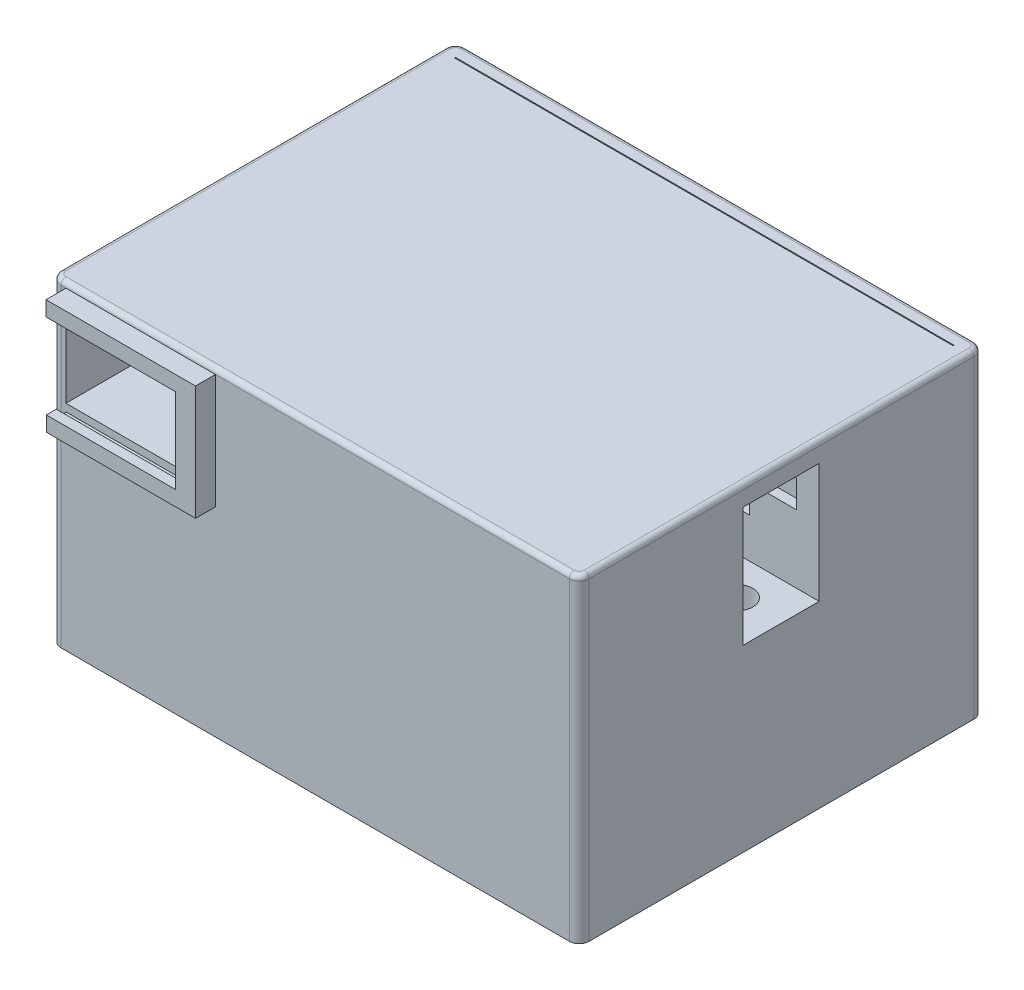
ISO-10303-21;
HEADER;
FILE_DESCRIPTION(('STEP AP214'),'2;1');
FILE_NAME('part.step','',(''),(''),'','','');
FILE_SCHEMA(('AUTOMOTIVE_DESIGN { 1 0 10303 214 1 1 1 1 }'));
ENDSEC;
DATA;
#1=APPLICATION_CONTEXT('core data for automotive mechanical design processes');
#2=APPLICATION_PROTOCOL_DEFINITION('international standard','automotive_design',2000,#1);
#3=PRODUCT_CONTEXT('',#1,'mechanical');
#4=PRODUCT('Part','Part','',(#3));
#5=PRODUCT_RELATED_PRODUCT_CATEGORY('part','',(#4));
#6=PRODUCT_DEFINITION_FORMATION('','',#4);
#7=PRODUCT_DEFINITION_CONTEXT('part definition',#1,'design');
#8=PRODUCT_DEFINITION('design','',#6,#7);
#9=PRODUCT_DEFINITION_SHAPE('','',#8);
#10=(LENGTH_UNIT() NAMED_UNIT(*) SI_UNIT(.MILLI.,.METRE.));
#11=(NAMED_UNIT(*) PLANE_ANGLE_UNIT() SI_UNIT($,.RADIAN.));
#12=(NAMED_UNIT(*) SI_UNIT($,.STERADIAN.) SOLID_ANGLE_UNIT());
#13=UNCERTAINTY_MEASURE_WITH_UNIT(LENGTH_MEASURE(1.E-05),#10,'distance_accuracy_value','');
#14=(GEOMETRIC_REPRESENTATION_CONTEXT(3) GLOBAL_UNCERTAINTY_ASSIGNED_CONTEXT((#13)) GLOBAL_UNIT_ASSIGNED_CONTEXT((#10,
#11,#12)) REPRESENTATION_CONTEXT('',''));
#15=CARTESIAN_POINT('',(0.,0.,0.));
#16=DIRECTION('',(0.,0.,1.));
#17=DIRECTION('',(1.,0.,0.));
#18=AXIS2_PLACEMENT_3D('',#15,#16,#17);
#19=CARTESIAN_POINT('',(45.496822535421,-24.,-54.3121087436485));
#20=DIRECTION('',(0.,0.,1.));
#21=DIRECTION('',(1.,0.,0.));
#22=AXIS2_PLACEMENT_3D('',#19,#20,#21);
#23=PLANE('',#22);
#24=DIRECTION('',(-1.,0.,0.));
#25=VECTOR('',#24,1.);
#26=CARTESIAN_POINT('',(45.496822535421,-24.,-54.3121087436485));
#27=LINE('',#26,#25);
#28=CARTESIAN_POINT('',(45.496822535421,-24.,-54.3121087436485));
#29=VERTEX_POINT('',#28);
#30=CARTESIAN_POINT('',(28.046822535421,-24.,-54.3121087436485));
#31=VERTEX_POINT('',#30);
#32=EDGE_CURVE('E620',#29,#31,#27,.T.);
#33=ORIENTED_EDGE('',*,*,#32,.T.);
#34=DIRECTION('',(0.,-1.,0.));
#35=VECTOR('',#34,1.);
#36=CARTESIAN_POINT('',(28.046822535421,-25.,-54.3121087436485));
#37=LINE('',#36,#35);
#38=CARTESIAN_POINT('',(28.046822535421,-16.,-54.3121087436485));
#39=VERTEX_POINT('',#38);
#40=EDGE_CURVE('E622',#39,#31,#37,.T.);
#41=ORIENTED_EDGE('',*,*,#40,.F.);
#42=DIRECTION('',(1.,0.,0.));
#43=VECTOR('',#42,1.);
#44=CARTESIAN_POINT('',(27.046822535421,-16.,-54.3121087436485));
#45=LINE('',#44,#43);
#46=CARTESIAN_POINT('',(31.496822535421,-16.,-54.3121087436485));
#47=VERTEX_POINT('',#46);
#48=EDGE_CURVE('E671',#39,#47,#45,.T.);
#49=ORIENTED_EDGE('',*,*,#48,.T.);
#50=DIRECTION('',(0.,-1.,0.));
#51=VECTOR('',#50,1.);
#52=CARTESIAN_POINT('',(31.496822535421,0.,-54.3121087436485));
#53=LINE('',#52,#51);
#54=CARTESIAN_POINT('',(31.496822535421,0.,-54.3121087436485));
#55=VERTEX_POINT('',#54);
#56=EDGE_CURVE('E1522',#55,#47,#53,.T.);
#57=ORIENTED_EDGE('',*,*,#56,.F.);
#58=DIRECTION('',(-1.,0.,0.));
#59=VECTOR('',#58,1.);
#60=CARTESIAN_POINT('',(45.496822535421,0.,-54.3121087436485));
#61=LINE('',#60,#59);
#62=CARTESIAN_POINT('',(45.496822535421,0.,-54.3121087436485));
#63=VERTEX_POINT('',#62);
#64=EDGE_CURVE('E1550',#63,#55,#61,.T.);
#65=ORIENTED_EDGE('',*,*,#64,.F.);
#66=DIRECTION('',(0.,1.,0.));
#67=VECTOR('',#66,1.);
#68=CARTESIAN_POINT('',(45.496822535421,-24.,-54.3121087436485));
#69=LINE('',#68,#67);
#70=EDGE_CURVE('E625',#29,#63,#69,.T.);
#71=ORIENTED_EDGE('',*,*,#70,.F.);
#72=EDGE_LOOP('',(#33,#41,#49,#57,#65,#71));
#73=FACE_BOUND('',#72,.T.);
#74=ADVANCED_FACE('F42',(#73),#23,.F.);
#75=CARTESIAN_POINT('',(45.496822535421,-24.,-69.6121087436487));
#76=DIRECTION('',(0.,0.,-1.));
#77=DIRECTION('',(-1.,0.,0.));
#78=AXIS2_PLACEMENT_3D('',#75,#76,#77);
#79=PLANE('',#78);
#80=DIRECTION('',(1.,0.,0.));
#81=VECTOR('',#80,1.);
#82=CARTESIAN_POINT('',(45.496822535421,-4.87,-69.6121087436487));
#83=LINE('',#82,#81);
#84=CARTESIAN_POINT('',(32.156822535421,-4.87,-69.6121087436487));
#85=VERTEX_POINT('',#84);
#86=CARTESIAN_POINT('',(40.976822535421,-4.87,-69.6121087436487));
#87=VERTEX_POINT('',#86);
#88=EDGE_CURVE('E1497',#85,#87,#83,.T.);
#89=ORIENTED_EDGE('',*,*,#88,.T.);
#90=DIRECTION('',(0.,-1.,0.));
#91=VECTOR('',#90,1.);
#92=CARTESIAN_POINT('',(40.976822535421,-24.,-69.6121087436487));
#93=LINE('',#92,#91);
#94=CARTESIAN_POINT('',(40.976822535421,-10.37,-69.6121087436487));
#95=VERTEX_POINT('',#94);
#96=EDGE_CURVE('E1501',#87,#95,#93,.T.);
#97=ORIENTED_EDGE('',*,*,#96,.T.);
#98=DIRECTION('',(-1.,0.,0.));
#99=VECTOR('',#98,1.);
#100=CARTESIAN_POINT('',(45.496822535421,-10.37,-69.6121087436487));
#101=LINE('',#100,#99);
#102=CARTESIAN_POINT('',(32.156822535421,-10.37,-69.6121087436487));
#103=VERTEX_POINT('',#102);
#104=EDGE_CURVE('E1480',#95,#103,#101,.T.);
#105=ORIENTED_EDGE('',*,*,#104,.T.);
#106=DIRECTION('',(0.,1.,0.));
#107=VECTOR('',#106,1.);
#108=CARTESIAN_POINT('',(32.156822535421,-24.,-69.6121087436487));
#109=LINE('',#108,#107);
#110=EDGE_CURVE('E1493',#103,#85,#109,.T.);
#111=ORIENTED_EDGE('',*,*,#110,.T.);
#112=EDGE_LOOP('',(#89,#97,#105,#111));
#113=FACE_BOUND('',#112,.T.);
#114=DIRECTION('',(0.,1.,0.));
#115=VECTOR('',#114,1.);
#116=CARTESIAN_POINT('',(28.046822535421,-24.,-69.6121087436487));
#117=LINE('',#116,#115);
#118=CARTESIAN_POINT('',(28.046822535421,-24.,-69.6121087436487));
#119=VERTEX_POINT('',#118);
#120=CARTESIAN_POINT('',(28.046822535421,-16.,-69.6121087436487));
#121=VERTEX_POINT('',#120);
#122=EDGE_CURVE('E67',#119,#121,#117,.T.);
#123=ORIENTED_EDGE('',*,*,#122,.F.);
#124=DIRECTION('',(-1.,0.,0.));
#125=VECTOR('',#124,1.);
#126=CARTESIAN_POINT('',(45.496822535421,-24.,-69.6121087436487));
#127=LINE('',#126,#125);
#128=CARTESIAN_POINT('',(45.496822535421,-24.,-69.6121087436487));
#129=VERTEX_POINT('',#128);
#130=EDGE_CURVE('E60',#129,#119,#127,.T.);
#131=ORIENTED_EDGE('',*,*,#130,.F.);
#132=DIRECTION('',(0.,-1.,0.));
#133=VECTOR('',#132,1.);
#134=CARTESIAN_POINT('',(45.496822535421,-24.,-69.6121087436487));
#135=LINE('',#134,#133);
#136=CARTESIAN_POINT('',(45.496822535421,0.,-69.6121087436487));
#137=VERTEX_POINT('',#136);
#138=EDGE_CURVE('E1544',#137,#129,#135,.T.);
#139=ORIENTED_EDGE('',*,*,#138,.F.);
#140=DIRECTION('',(-1.,0.,0.));
#141=VECTOR('',#140,1.);
#142=CARTESIAN_POINT('',(45.496822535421,0.,-69.6121087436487));
#143=LINE('',#142,#141);
#144=CARTESIAN_POINT('',(31.496822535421,0.,-69.6121087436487));
#145=VERTEX_POINT('',#144);
#146=EDGE_CURVE('E1554',#137,#145,#143,.T.);
#147=ORIENTED_EDGE('',*,*,#146,.T.);
#148=DIRECTION('',(0.,1.,0.));
#149=VECTOR('',#148,1.);
#150=CARTESIAN_POINT('',(31.496822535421,0.,-69.6121087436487));
#151=LINE('',#150,#149);
#152=CARTESIAN_POINT('',(31.496822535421,-16.,-69.6121087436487));
#153=VERTEX_POINT('',#152);
#154=EDGE_CURVE('E1506',#153,#145,#151,.T.);
#155=ORIENTED_EDGE('',*,*,#154,.F.);
#156=DIRECTION('',(1.,0.,0.));
#157=VECTOR('',#156,1.);
#158=CARTESIAN_POINT('',(27.046822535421,-16.,-69.6121087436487));
#159=LINE('',#158,#157);
#160=EDGE_CURVE('E656',#121,#153,#159,.T.);
#161=ORIENTED_EDGE('',*,*,#160,.F.);
#162=EDGE_LOOP('',(#123,#131,#139,#147,#155,#161));
#163=FACE_BOUND('',#162,.T.);
#164=ADVANCED_FACE('F1747',(#113,#163),#79,.F.);
#165=CARTESIAN_POINT('',(28.046822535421,-25.,-69.7121087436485));
#166=DIRECTION('',(-1.,0.,0.));
#167=DIRECTION('',(0.,0.,1.));
#168=AXIS2_PLACEMENT_3D('',#165,#166,#167);
#169=PLANE('',#168);
#170=DIRECTION('',(0.,0.,-1.));
#171=VECTOR('',#170,1.);
#172=CARTESIAN_POINT('',(28.046822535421,-24.,-54.3121087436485));
#173=LINE('',#172,#171);
#174=EDGE_CURVE('E631',#31,#119,#173,.T.);
#175=ORIENTED_EDGE('',*,*,#174,.T.);
#176=ORIENTED_EDGE('',*,*,#122,.T.);
#177=DIRECTION('',(0.,0.,1.));
#178=VECTOR('',#177,1.);
#179=CARTESIAN_POINT('',(28.046822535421,-16.,-69.7121087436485));
#180=LINE('',#179,#178);
#181=EDGE_CURVE('E633',#121,#39,#180,.T.);
#182=ORIENTED_EDGE('',*,*,#181,.T.);
#183=ORIENTED_EDGE('',*,*,#40,.T.);
#184=EDGE_LOOP('',(#175,#176,#182,#183));
#185=FACE_BOUND('',#184,.T.);
#186=ADVANCED_FACE('F630',(#185),#169,.F.);
#187=CARTESIAN_POINT('',(31.496822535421,0.,0.));
#188=DIRECTION('',(-1.,0.,0.));
#189=DIRECTION('',(0.,0.,1.));
#190=AXIS2_PLACEMENT_3D('',#187,#188,#189);
#191=PLANE('',#190);
#192=DIRECTION('',(0.,-1.,0.));
#193=VECTOR('',#192,1.);
#194=CARTESIAN_POINT('',(31.496822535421,0.,-71.6121087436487));
#195=LINE('',#194,#193);
#196=CARTESIAN_POINT('',(31.496822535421,0.,-71.6121087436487));
#197=VERTEX_POINT('',#196);
#198=CARTESIAN_POINT('',(31.496822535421,-16.,-71.6121087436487));
#199=VERTEX_POINT('',#198);
#200=EDGE_CURVE('E1512',#197,#199,#195,.T.);
#201=ORIENTED_EDGE('',*,*,#200,.T.);
#202=DIRECTION('',(0.,0.,-1.));
#203=VECTOR('',#202,1.);
#204=CARTESIAN_POINT('',(31.496822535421,-16.,-71.6121087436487));
#205=LINE('',#204,#203);
#206=EDGE_CURVE('E646',#153,#199,#205,.T.);
#207=ORIENTED_EDGE('',*,*,#206,.F.);
#208=ORIENTED_EDGE('',*,*,#154,.T.);
#209=DIRECTION('',(0.,0.,-1.));
#210=VECTOR('',#209,1.);
#211=CARTESIAN_POINT('',(31.496822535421,0.,-69.6121087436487));
#212=LINE('',#211,#210);
#213=EDGE_CURVE('E1509',#145,#197,#212,.T.);
#214=ORIENTED_EDGE('',*,*,#213,.T.);
#215=EDGE_LOOP('',(#201,#207,#208,#214));
#216=FACE_BOUND('',#215,.T.);
#217=ADVANCED_FACE('F1845',(#216),#191,.T.);
#218=ORIENTED_EDGE('',*,*,#56,.T.);
#219=DIRECTION('',(0.,0.,-1.));
#220=VECTOR('',#219,1.);
#221=CARTESIAN_POINT('',(31.496822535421,-16.,-52.3121087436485));
#222=LINE('',#221,#220);
#223=CARTESIAN_POINT('',(31.496822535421,-16.,-52.3121087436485));
#224=VERTEX_POINT('',#223);
#225=EDGE_CURVE('E659',#224,#47,#222,.T.);
#226=ORIENTED_EDGE('',*,*,#225,.F.);
#227=DIRECTION('',(0.,1.,0.));
#228=VECTOR('',#227,1.);
#229=CARTESIAN_POINT('',(31.496822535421,0.,-52.3121087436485));
#230=LINE('',#229,#228);
#231=CARTESIAN_POINT('',(31.496822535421,0.,-52.3121087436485));
#232=VERTEX_POINT('',#231);
#233=EDGE_CURVE('E1525',#224,#232,#230,.T.);
#234=ORIENTED_EDGE('',*,*,#233,.T.);
#235=DIRECTION('',(0.,0.,-1.));
#236=VECTOR('',#235,1.);
#237=CARTESIAN_POINT('',(31.496822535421,0.,-54.3121087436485));
#238=LINE('',#237,#236);
#239=EDGE_CURVE('E1528',#232,#55,#238,.T.);
#240=ORIENTED_EDGE('',*,*,#239,.T.);
#241=EDGE_LOOP('',(#218,#226,#234,#240));
#242=FACE_BOUND('',#241,.T.);
#243=ADVANCED_FACE('F1841',(#242),#191,.T.);
#244=CARTESIAN_POINT('',(-57.5031774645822,0.,-17.4621087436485));
#245=DIRECTION('',(0.,1.,0.));
#246=DIRECTION('',(0.,0.,1.));
#247=AXIS2_PLACEMENT_3D('',#244,#245,#246);
#248=PLANE('',#247);
#249=DIRECTION('',(0.,0.,-1.));
#250=VECTOR('',#249,1.);
#251=CARTESIAN_POINT('',(-31.5031774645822,0.,-17.4621087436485));
#252=LINE('',#251,#250);
#253=CARTESIAN_POINT('',(-31.5031774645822,0.,-17.4621087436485));
#254=VERTEX_POINT('',#253);
#255=CARTESIAN_POINT('',(-31.5031774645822,0.,-19.4621087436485));
#256=VERTEX_POINT('',#255);
#257=EDGE_CURVE('E692',#254,#256,#252,.T.);
#258=ORIENTED_EDGE('',*,*,#257,.F.);
#259=DIRECTION('',(1.,0.,0.));
#260=VECTOR('',#259,1.);
#261=CARTESIAN_POINT('',(-57.5031774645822,0.,-17.4621087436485));
#262=LINE('',#261,#260);
#263=CARTESIAN_POINT('',(-57.5031774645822,0.,-17.4621087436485));
#264=VERTEX_POINT('',#263);
#265=EDGE_CURVE('E722',#264,#254,#262,.T.);
#266=ORIENTED_EDGE('',*,*,#265,.F.);
#267=DIRECTION('',(0.,0.,-1.));
#268=VECTOR('',#267,1.);
#269=CARTESIAN_POINT('',(-57.5031774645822,0.,-17.4621087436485));
#270=LINE('',#269,#268);
#271=CARTESIAN_POINT('',(-57.5031774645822,0.,-19.4621087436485));
#272=VERTEX_POINT('',#271);
#273=EDGE_CURVE('E735',#264,#272,#270,.T.);
#274=ORIENTED_EDGE('',*,*,#273,.T.);
#275=DIRECTION('',(1.,0.,0.));
#276=VECTOR('',#275,1.);
#277=CARTESIAN_POINT('',(-57.5031774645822,0.,-19.4621087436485));
#278=LINE('',#277,#276);
#279=EDGE_CURVE('E723',#272,#256,#278,.T.);
#280=ORIENTED_EDGE('',*,*,#279,.T.);
#281=EDGE_LOOP('',(#258,#266,#274,#280));
#282=FACE_BOUND('',#281,.T.);
#283=ADVANCED_FACE('F1844',(#282),#248,.F.);
#284=CARTESIAN_POINT('',(-57.4362774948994,-17.,-17.4621087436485));
#285=DIRECTION('',(0.,-1.,0.));
#286=DIRECTION('',(0.,0.,-1.));
#287=AXIS2_PLACEMENT_3D('',#284,#285,#286);
#288=PLANE('',#287);
#289=DIRECTION('',(0.,0.,-1.));
#290=VECTOR('',#289,1.);
#291=CARTESIAN_POINT('',(-31.5031774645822,-17.,-17.4621087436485));
#292=LINE('',#291,#290);
#293=CARTESIAN_POINT('',(-31.5031774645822,-17.,-17.4621087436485));
#294=VERTEX_POINT('',#293);
#295=CARTESIAN_POINT('',(-31.5031774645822,-17.,-19.4621087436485));
#296=VERTEX_POINT('',#295);
#297=EDGE_CURVE('E685',#294,#296,#292,.T.);
#298=ORIENTED_EDGE('',*,*,#297,.T.);
#299=DIRECTION('',(-1.,0.,0.));
#300=VECTOR('',#299,1.);
#301=CARTESIAN_POINT('',(-57.4362774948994,-17.,-19.4621087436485));
#302=LINE('',#301,#300);
#303=CARTESIAN_POINT('',(-57.4362774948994,-17.,-19.4621087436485));
#304=VERTEX_POINT('',#303);
#305=EDGE_CURVE('E701',#296,#304,#302,.T.);
#306=ORIENTED_EDGE('',*,*,#305,.T.);
#307=DIRECTION('',(0.,0.,-1.));
#308=VECTOR('',#307,1.);
#309=CARTESIAN_POINT('',(-57.4362774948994,-17.,-17.4621087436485));
#310=LINE('',#309,#308);
#311=CARTESIAN_POINT('',(-57.4362774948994,-17.,-17.4621087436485));
#312=VERTEX_POINT('',#311);
#313=EDGE_CURVE('E708',#312,#304,#310,.T.);
#314=ORIENTED_EDGE('',*,*,#313,.F.);
#315=DIRECTION('',(-1.,0.,0.));
#316=VECTOR('',#315,1.);
#317=CARTESIAN_POINT('',(-57.4362774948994,-17.,-17.4621087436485));
#318=LINE('',#317,#316);
#319=EDGE_CURVE('E705',#294,#312,#318,.T.);
#320=ORIENTED_EDGE('',*,*,#319,.F.);
#321=EDGE_LOOP('',(#298,#306,#314,#320));
#322=FACE_BOUND('',#321,.T.);
#323=ADVANCED_FACE('F1765',(#322),#288,.F.);
#324=CARTESIAN_POINT('',(45.496822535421,-60.,-21.4621087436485));
#325=DIRECTION('',(0.,0.,1.));
#326=DIRECTION('',(1.,0.,0.));
#327=AXIS2_PLACEMENT_3D('',#324,#325,#326);
#328=PLANE('',#327);
#329=DIRECTION('',(0.,-1.,0.));
#330=VECTOR('',#329,1.);
#331=CARTESIAN_POINT('',(-31.5031774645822,-17.,-21.4621087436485));
#332=LINE('',#331,#330);
#333=CARTESIAN_POINT('',(-31.5031774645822,0.,-21.4621087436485));
#334=VERTEX_POINT('',#333);
#335=CARTESIAN_POINT('',(-31.5031774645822,-17.,-21.4621087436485));
#336=VERTEX_POINT('',#335);
#337=EDGE_CURVE('E805',#334,#336,#332,.T.);
#338=ORIENTED_EDGE('',*,*,#337,.T.);
#339=DIRECTION('',(-1.,0.,0.));
#340=VECTOR('',#339,1.);
#341=CARTESIAN_POINT('',(-31.5031774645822,-17.,-21.4621087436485));
#342=LINE('',#341,#340);
#343=CARTESIAN_POINT('',(-57.5031774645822,-17.,-21.4621087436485));
#344=VERTEX_POINT('',#343);
#345=EDGE_CURVE('E809',#336,#344,#342,.T.);
#346=ORIENTED_EDGE('',*,*,#345,.T.);
#347=DIRECTION('',(0.,1.,0.));
#348=VECTOR('',#347,1.);
#349=CARTESIAN_POINT('',(-57.5031774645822,-17.,-21.4621087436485));
#350=LINE('',#349,#348);
#351=CARTESIAN_POINT('',(-57.5031774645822,0.,-21.4621087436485));
#352=VERTEX_POINT('',#351);
#353=EDGE_CURVE('E813',#344,#352,#350,.T.);
#354=ORIENTED_EDGE('',*,*,#353,.T.);
#355=DIRECTION('',(1.,0.,0.));
#356=VECTOR('',#355,1.);
#357=CARTESIAN_POINT('',(-31.5031774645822,0.,-21.4621087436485));
#358=LINE('',#357,#356);
#359=EDGE_CURVE('E817',#352,#334,#358,.T.);
#360=ORIENTED_EDGE('',*,*,#359,.T.);
#361=EDGE_LOOP('',(#338,#346,#354,#360));
#362=FACE_BOUND('',#361,.T.);
#363=DIRECTION('',(0.,1.,0.));
#364=VECTOR('',#363,1.);
#365=CARTESIAN_POINT('',(43.496822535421,4.,-21.4621087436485));
#366=LINE('',#365,#364);
#367=CARTESIAN_POINT('',(43.496822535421,-60.,-21.4621087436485));
#368=VERTEX_POINT('',#367);
#369=CARTESIAN_POINT('',(43.496822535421,3.,-21.4621087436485));
#370=VERTEX_POINT('',#369);
#371=EDGE_CURVE('E1106',#368,#370,#366,.T.);
#372=ORIENTED_EDGE('',*,*,#371,.T.);
#373=DIRECTION('',(1.,0.,0.));
#374=VECTOR('',#373,1.);
#375=CARTESIAN_POINT('',(-58.5031774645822,3.,-21.4621087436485));
#376=LINE('',#375,#374);
#377=CARTESIAN_POINT('',(-27.5031774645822,3.,-21.4621087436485));
#378=VERTEX_POINT('',#377);
#379=EDGE_CURVE('E1006',#370,#378,#376,.F.);
#380=ORIENTED_EDGE('',*,*,#379,.T.);
#381=DIRECTION('',(0.,1.,0.));
#382=VECTOR('',#381,1.);
#383=CARTESIAN_POINT('',(-27.5031774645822,3.,-21.4621087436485));
#384=LINE('',#383,#382);
#385=CARTESIAN_POINT('',(-27.5031774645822,-20.,-21.4621087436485));
#386=VERTEX_POINT('',#385);
#387=EDGE_CURVE('E746',#386,#378,#384,.T.);
#388=ORIENTED_EDGE('',*,*,#387,.F.);
#389=DIRECTION('',(1.,0.,0.));
#390=VECTOR('',#389,1.);
#391=CARTESIAN_POINT('',(-57.4362774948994,-20.,-21.4621087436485));
#392=LINE('',#391,#390);
#393=CARTESIAN_POINT('',(-57.4362774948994,-20.,-21.4621087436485));
#394=VERTEX_POINT('',#393);
#395=EDGE_CURVE('E770',#394,#386,#392,.T.);
#396=ORIENTED_EDGE('',*,*,#395,.F.);
#397=DIRECTION('',(0.,-1.,0.));
#398=VECTOR('',#397,1.);
#399=CARTESIAN_POINT('',(-57.4362774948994,-18.5,-21.4621087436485));
#400=LINE('',#399,#398);
#401=CARTESIAN_POINT('',(-57.4362774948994,-18.5,-21.4621087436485));
#402=VERTEX_POINT('',#401);
#403=EDGE_CURVE('E760',#402,#394,#400,.T.);
#404=ORIENTED_EDGE('',*,*,#403,.F.);
#405=DIRECTION('',(-1.,0.,0.));
#406=VECTOR('',#405,1.);
#407=CARTESIAN_POINT('',(-57.4362774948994,-18.5,-21.4621087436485));
#408=LINE('',#407,#406);
#409=CARTESIAN_POINT('',(-29.0031774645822,-18.5,-21.4621087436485));
#410=VERTEX_POINT('',#409);
#411=EDGE_CURVE('E766',#410,#402,#408,.T.);
#412=ORIENTED_EDGE('',*,*,#411,.F.);
#413=DIRECTION('',(0.,-1.,0.));
#414=VECTOR('',#413,1.);
#415=CARTESIAN_POINT('',(-29.0031774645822,3.,-21.4621087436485));
#416=LINE('',#415,#414);
#417=CARTESIAN_POINT('',(-29.0031774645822,1.5,-21.4621087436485));
#418=VERTEX_POINT('',#417);
#419=EDGE_CURVE('E747',#418,#410,#416,.T.);
#420=ORIENTED_EDGE('',*,*,#419,.F.);
#421=DIRECTION('',(1.,0.,0.));
#422=VECTOR('',#421,1.);
#423=CARTESIAN_POINT('',(-57.5031774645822,1.5,-21.4621087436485));
#424=LINE('',#423,#422);
#425=CARTESIAN_POINT('',(-57.5031774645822,1.5,-21.4621087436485));
#426=VERTEX_POINT('',#425);
#427=EDGE_CURVE('E789',#426,#418,#424,.T.);
#428=ORIENTED_EDGE('',*,*,#427,.F.);
#429=DIRECTION('',(0.,-1.,0.));
#430=VECTOR('',#429,1.);
#431=CARTESIAN_POINT('',(-57.5031774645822,3.,-21.4621087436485));
#432=LINE('',#431,#430);
#433=CARTESIAN_POINT('',(-57.5031774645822,3.,-21.4621087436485));
#434=VERTEX_POINT('',#433);
#435=EDGE_CURVE('E785',#434,#426,#432,.T.);
#436=ORIENTED_EDGE('',*,*,#435,.F.);
#437=DIRECTION('',(1.,0.,0.));
#438=VECTOR('',#437,1.);
#439=CARTESIAN_POINT('',(-58.5031774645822,3.,-21.4621087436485));
#440=LINE('',#439,#438);
#441=CARTESIAN_POINT('',(-58.5031774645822,3.,-21.4621087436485));
#442=VERTEX_POINT('',#441);
#443=EDGE_CURVE('E1003',#434,#442,#440,.F.);
#444=ORIENTED_EDGE('',*,*,#443,.T.);
#445=DIRECTION('',(0.,1.,0.));
#446=VECTOR('',#445,1.);
#447=CARTESIAN_POINT('',(-58.5031774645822,-60.,-21.4621087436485));
#448=LINE('',#447,#446);
#449=CARTESIAN_POINT('',(-58.5031774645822,-60.,-21.4621087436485));
#450=VERTEX_POINT('',#449);
#451=EDGE_CURVE('E1103',#442,#450,#448,.F.);
#452=ORIENTED_EDGE('',*,*,#451,.T.);
#453=DIRECTION('',(1.,0.,0.));
#454=VECTOR('',#453,1.);
#455=CARTESIAN_POINT('',(45.496822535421,-60.,-21.4621087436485));
#456=LINE('',#455,#454);
#457=EDGE_CURVE('E1573',#450,#368,#456,.T.);
#458=ORIENTED_EDGE('',*,*,#457,.T.);
#459=EDGE_LOOP('',(#372,#380,#388,#396,#404,#412,#420,#428,#436,#444,#452,#458));
#460=FACE_BOUND('',#459,.T.);
#461=ADVANCED_FACE('F1762',(#362,#460),#328,.T.);
#462=CARTESIAN_POINT('',(-57.5031774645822,-60.,-24.4621087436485));
#463=DIRECTION('',(-1.,0.,0.));
#464=DIRECTION('',(0.,0.,1.));
#465=AXIS2_PLACEMENT_3D('',#462,#463,#464);
#466=PLANE('',#465);
#467=DIRECTION('',(0.,1.,0.));
#468=VECTOR('',#467,1.);
#469=CARTESIAN_POINT('',(-57.5031774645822,-60.,-75.4621087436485));
#470=LINE('',#469,#468);
#471=CARTESIAN_POINT('',(-57.5031774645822,-19.,-75.4621087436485));
#472=VERTEX_POINT('',#471);
#473=CARTESIAN_POINT('',(-57.5031774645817,0.,-75.4621087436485));
#474=VERTEX_POINT('',#473);
#475=EDGE_CURVE('E1280',#472,#474,#470,.T.);
#476=ORIENTED_EDGE('',*,*,#475,.F.);
#477=DIRECTION('',(0.,0.,-1.));
#478=VECTOR('',#477,1.);
#479=CARTESIAN_POINT('',(-57.5031774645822,-19.,-24.4621087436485));
#480=LINE('',#479,#478);
#481=CARTESIAN_POINT('',(-57.5031774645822,-19.,-73.4621087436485));
#482=VERTEX_POINT('',#481);
#483=EDGE_CURVE('E1284',#482,#472,#480,.T.);
#484=ORIENTED_EDGE('',*,*,#483,.F.);
#485=DIRECTION('',(0.,-1.,0.));
#486=VECTOR('',#485,1.);
#487=CARTESIAN_POINT('',(-57.5031774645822,-60.,-73.4621087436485));
#488=LINE('',#487,#486);
#489=CARTESIAN_POINT('',(-57.5031774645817,0.,-73.4621087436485));
#490=VERTEX_POINT('',#489);
#491=EDGE_CURVE('E1277',#490,#482,#488,.T.);
#492=ORIENTED_EDGE('',*,*,#491,.F.);
#493=DIRECTION('',(0.,0.,1.));
#494=VECTOR('',#493,1.);
#495=CARTESIAN_POINT('',(-57.5031774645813,0.,-99.4621087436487));
#496=LINE('',#495,#494);
#497=CARTESIAN_POINT('',(-57.5031774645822,0.,-67.4621087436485));
#498=VERTEX_POINT('',#497);
#499=EDGE_CURVE('E1647',#490,#498,#496,.T.);
#500=ORIENTED_EDGE('',*,*,#499,.T.);
#501=DIRECTION('',(0.,-1.,0.));
#502=VECTOR('',#501,1.);
#503=CARTESIAN_POINT('',(-57.5031774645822,-19.,-67.4621087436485));
#504=LINE('',#503,#502);
#505=CARTESIAN_POINT('',(-57.5031774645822,-19.,-67.4621087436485));
#506=VERTEX_POINT('',#505);
#507=EDGE_CURVE('E1335',#498,#506,#504,.T.);
#508=ORIENTED_EDGE('',*,*,#507,.T.);
#509=DIRECTION('',(0.,0.,-1.));
#510=VECTOR('',#509,1.);
#511=CARTESIAN_POINT('',(-57.5031774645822,-19.,-24.4621087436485));
#512=LINE('',#511,#510);
#513=CARTESIAN_POINT('',(-57.5031774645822,-19.,-24.4621087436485));
#514=VERTEX_POINT('',#513);
#515=EDGE_CURVE('E1363',#514,#506,#512,.T.);
#516=ORIENTED_EDGE('',*,*,#515,.F.);
#517=DIRECTION('',(0.,1.,0.));
#518=VECTOR('',#517,1.);
#519=CARTESIAN_POINT('',(-57.5031774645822,-60.,-24.4621087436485));
#520=LINE('',#519,#518);
#521=CARTESIAN_POINT('',(-57.5031774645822,-60.,-24.4621087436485));
#522=VERTEX_POINT('',#521);
#523=EDGE_CURVE('E1590',#522,#514,#520,.T.);
#524=ORIENTED_EDGE('',*,*,#523,.F.);
#525=DIRECTION('',(0.,0.,1.));
#526=VECTOR('',#525,1.);
#527=CARTESIAN_POINT('',(-57.5031774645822,-60.,-24.4621087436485));
#528=LINE('',#527,#526);
#529=CARTESIAN_POINT('',(-57.5031774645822,-60.,-99.6512314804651));
#530=VERTEX_POINT('',#529);
#531=EDGE_CURVE('E1588',#530,#522,#528,.T.);
#532=ORIENTED_EDGE('',*,*,#531,.F.);
#533=DIRECTION('',(0.,1.,0.));
#534=VECTOR('',#533,1.);
#535=CARTESIAN_POINT('',(-57.5031774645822,-60.,-99.6512314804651));
#536=LINE('',#535,#534);
#537=CARTESIAN_POINT('',(-57.5031774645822,4.,-99.6512314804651));
#538=VERTEX_POINT('',#537);
#539=EDGE_CURVE('E1595',#530,#538,#536,.T.);
#540=ORIENTED_EDGE('',*,*,#539,.T.);
#541=DIRECTION('',(0.,0.,1.));
#542=VECTOR('',#541,1.);
#543=CARTESIAN_POINT('',(-57.5031774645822,4.,-24.4621087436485));
#544=LINE('',#543,#542);
#545=CARTESIAN_POINT('',(-57.5031774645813,4.,-99.4621087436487));
#546=VERTEX_POINT('',#545);
#547=EDGE_CURVE('E1583',#538,#546,#544,.T.);
#548=ORIENTED_EDGE('',*,*,#547,.T.);
#549=DIRECTION('',(0.,-1.,0.));
#550=VECTOR('',#549,1.);
#551=CARTESIAN_POINT('',(-57.5031774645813,4.,-99.4621087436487));
#552=LINE('',#551,#550);
#553=CARTESIAN_POINT('',(-57.5031774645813,0.,-99.4621087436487));
#554=VERTEX_POINT('',#553);
#555=EDGE_CURVE('E1636',#546,#554,#552,.T.);
#556=ORIENTED_EDGE('',*,*,#555,.T.);
#557=EDGE_CURVE('E1628',#554,#474,#496,.T.);
#558=ORIENTED_EDGE('',*,*,#557,.T.);
#559=EDGE_LOOP('',(#476,#484,#492,#500,#508,#516,#524,#532,#540,#548,#556,#558));
#560=FACE_BOUND('',#559,.T.);
#561=DIRECTION('',(0.,0.,1.));
#562=VECTOR('',#561,1.);
#563=CARTESIAN_POINT('',(-57.5031774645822,-29.6949988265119,-46.064517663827));
#564=LINE('',#563,#562);
#565=CARTESIAN_POINT('',(-57.5031774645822,-29.6949988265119,-38.064517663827));
#566=VERTEX_POINT('',#565);
#567=CARTESIAN_POINT('',(-57.5031774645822,-29.6949988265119,-36.064517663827));
#568=VERTEX_POINT('',#567);
#569=EDGE_CURVE('E1197',#566,#568,#564,.T.);
#570=ORIENTED_EDGE('',*,*,#569,.F.);
#571=DIRECTION('',(0.,-1.,0.));
#572=VECTOR('',#571,1.);
#573=CARTESIAN_POINT('',(-57.5031774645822,-35.1949988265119,-38.064517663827));
#574=LINE('',#573,#572);
#575=CARTESIAN_POINT('',(-57.5031774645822,-28.1949988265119,-38.064517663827));
#576=VERTEX_POINT('',#575);
#577=EDGE_CURVE('E1245',#576,#566,#574,.T.);
#578=ORIENTED_EDGE('',*,*,#577,.F.);
#579=DIRECTION('',(0.,0.,1.));
#580=VECTOR('',#579,1.);
#581=CARTESIAN_POINT('',(-57.5031774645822,-28.1949988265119,-44.064517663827));
#582=LINE('',#581,#580);
#583=CARTESIAN_POINT('',(-57.5031774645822,-28.1949988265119,-44.064517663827));
#584=VERTEX_POINT('',#583);
#585=EDGE_CURVE('E1240',#584,#576,#582,.T.);
#586=ORIENTED_EDGE('',*,*,#585,.F.);
#587=DIRECTION('',(0.,1.,0.));
#588=VECTOR('',#587,1.);
#589=CARTESIAN_POINT('',(-57.5031774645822,-35.1949988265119,-44.064517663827));
#590=LINE('',#589,#588);
#591=CARTESIAN_POINT('',(-57.5031774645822,-29.6949988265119,-44.064517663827));
#592=VERTEX_POINT('',#591);
#593=EDGE_CURVE('E1235',#592,#584,#590,.T.);
#594=ORIENTED_EDGE('',*,*,#593,.F.);
#595=CARTESIAN_POINT('',(-57.5031774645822,-29.6949988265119,-46.064517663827));
#596=VERTEX_POINT('',#595);
#597=EDGE_CURVE('E1221',#596,#592,#564,.T.);
#598=ORIENTED_EDGE('',*,*,#597,.F.);
#599=DIRECTION('',(0.,1.,0.));
#600=VECTOR('',#599,1.);
#601=CARTESIAN_POINT('',(-57.5031774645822,-33.6949988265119,-46.064517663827));
#602=LINE('',#601,#600);
#603=CARTESIAN_POINT('',(-57.5031774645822,-33.6949988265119,-46.064517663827));
#604=VERTEX_POINT('',#603);
#605=EDGE_CURVE('E1190',#604,#596,#602,.T.);
#606=ORIENTED_EDGE('',*,*,#605,.F.);
#607=DIRECTION('',(0.,0.,-1.));
#608=VECTOR('',#607,1.);
#609=CARTESIAN_POINT('',(-57.5031774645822,-33.6949988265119,-46.064517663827));
#610=LINE('',#609,#608);
#611=CARTESIAN_POINT('',(-57.5031774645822,-33.6949988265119,-44.064517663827));
#612=VERTEX_POINT('',#611);
#613=EDGE_CURVE('E1229',#612,#604,#610,.T.);
#614=ORIENTED_EDGE('',*,*,#613,.F.);
#615=CARTESIAN_POINT('',(-57.5031774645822,-35.1949988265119,-44.064517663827));
#616=VERTEX_POINT('',#615);
#617=EDGE_CURVE('E1236',#616,#612,#590,.T.);
#618=ORIENTED_EDGE('',*,*,#617,.F.);
#619=DIRECTION('',(0.,0.,-1.));
#620=VECTOR('',#619,1.);
#621=CARTESIAN_POINT('',(-57.5031774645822,-35.1949988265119,-44.064517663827));
#622=LINE('',#621,#620);
#623=CARTESIAN_POINT('',(-57.5031774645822,-35.1949988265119,-38.064517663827));
#624=VERTEX_POINT('',#623);
#625=EDGE_CURVE('E1249',#624,#616,#622,.T.);
#626=ORIENTED_EDGE('',*,*,#625,.F.);
#627=CARTESIAN_POINT('',(-57.5031774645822,-33.6949988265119,-38.064517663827));
#628=VERTEX_POINT('',#627);
#629=EDGE_CURVE('E1244',#628,#624,#574,.T.);
#630=ORIENTED_EDGE('',*,*,#629,.F.);
#631=CARTESIAN_POINT('',(-57.5031774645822,-33.6949988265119,-36.064517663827));
#632=VERTEX_POINT('',#631);
#633=EDGE_CURVE('E1216',#632,#628,#610,.T.);
#634=ORIENTED_EDGE('',*,*,#633,.F.);
#635=DIRECTION('',(0.,-1.,0.));
#636=VECTOR('',#635,1.);
#637=CARTESIAN_POINT('',(-57.5031774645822,-33.6949988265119,-36.064517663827));
#638=LINE('',#637,#636);
#639=EDGE_CURVE('E1224',#568,#632,#638,.T.);
#640=ORIENTED_EDGE('',*,*,#639,.F.);
#641=EDGE_LOOP('',(#570,#578,#586,#594,#598,#606,#614,#618,#626,#630,#634,#640));
#642=FACE_BOUND('',#641,.T.);
#643=DIRECTION('',(0.,0.,-1.));
#644=VECTOR('',#643,1.);
#645=CARTESIAN_POINT('',(-57.5031774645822,-28.1949988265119,-80.4621087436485));
#646=LINE('',#645,#644);
#647=CARTESIAN_POINT('',(-57.5031774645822,-28.1949988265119,-80.4621087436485));
#648=VERTEX_POINT('',#647);
#649=CARTESIAN_POINT('',(-57.5031774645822,-28.1949988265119,-81.4621087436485));
#650=VERTEX_POINT('',#649);
#651=EDGE_CURVE('E858',#648,#650,#646,.T.);
#652=ORIENTED_EDGE('',*,*,#651,.F.);
#653=DIRECTION('',(0.,1.,0.));
#654=VECTOR('',#653,1.);
#655=CARTESIAN_POINT('',(-57.5031774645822,-27.1949988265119,-80.4621087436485));
#656=LINE('',#655,#654);
#657=CARTESIAN_POINT('',(-57.5031774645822,-40.6949988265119,-80.4621087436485));
#658=VERTEX_POINT('',#657);
#659=EDGE_CURVE('E960',#658,#648,#656,.T.);
#660=ORIENTED_EDGE('',*,*,#659,.F.);
#661=DIRECTION('',(0.,0.,-1.));
#662=VECTOR('',#661,1.);
#663=CARTESIAN_POINT('',(-57.5031774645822,-40.6949988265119,0.));
#664=LINE('',#663,#662);
#665=CARTESIAN_POINT('',(-57.5031774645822,-40.6949988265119,-82.4621087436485));
#666=VERTEX_POINT('',#665);
#667=EDGE_CURVE('E944',#658,#666,#664,.T.);
#668=ORIENTED_EDGE('',*,*,#667,.T.);
#669=DIRECTION('',(0.,-1.,0.));
#670=VECTOR('',#669,1.);
#671=CARTESIAN_POINT('',(-57.5031774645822,0.,-82.4621087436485));
#672=LINE('',#671,#670);
#673=CARTESIAN_POINT('',(-57.5031774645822,-47.6949988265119,-82.4621087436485));
#674=VERTEX_POINT('',#673);
#675=EDGE_CURVE('E3155',#666,#674,#672,.T.);
#676=ORIENTED_EDGE('',*,*,#675,.T.);
#677=DIRECTION('',(0.,0.,1.));
#678=VECTOR('',#677,1.);
#679=CARTESIAN_POINT('',(-57.5031774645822,-47.6949988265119,0.));
#680=LINE('',#679,#678);
#681=CARTESIAN_POINT('',(-57.5031774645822,-47.6949988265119,-67.4621087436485));
#682=VERTEX_POINT('',#681);
#683=EDGE_CURVE('E3129',#674,#682,#680,.T.);
#684=ORIENTED_EDGE('',*,*,#683,.T.);
#685=DIRECTION('',(0.,-1.,0.));
#686=VECTOR('',#685,1.);
#687=CARTESIAN_POINT('',(-57.5031774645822,0.,-67.4621087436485));
#688=LINE('',#687,#686);
#689=CARTESIAN_POINT('',(-57.5031774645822,-40.6949988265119,-67.4621087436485));
#690=VERTEX_POINT('',#689);
#691=EDGE_CURVE('E3153',#690,#682,#688,.T.);
#692=ORIENTED_EDGE('',*,*,#691,.F.);
#693=DIRECTION('',(0.,0.,1.));
#694=VECTOR('',#693,1.);
#695=CARTESIAN_POINT('',(-57.5031774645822,-40.6949988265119,0.));
#696=LINE('',#695,#694);
#697=CARTESIAN_POINT('',(-57.5031774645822,-40.6949988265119,-69.4621087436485));
#698=VERTEX_POINT('',#697);
#699=EDGE_CURVE('E933',#698,#690,#696,.T.);
#700=ORIENTED_EDGE('',*,*,#699,.F.);
#701=DIRECTION('',(0.,-1.,0.));
#702=VECTOR('',#701,1.);
#703=CARTESIAN_POINT('',(-57.5031774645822,-27.1949988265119,-69.4621087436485));
#704=LINE('',#703,#702);
#705=CARTESIAN_POINT('',(-57.5031774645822,-28.1949988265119,-69.4621087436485));
#706=VERTEX_POINT('',#705);
#707=EDGE_CURVE('E1203',#706,#698,#704,.T.);
#708=ORIENTED_EDGE('',*,*,#707,.F.);
#709=DIRECTION('',(0.,0.,-1.));
#710=VECTOR('',#709,1.);
#711=CARTESIAN_POINT('',(-57.5031774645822,-28.1949988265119,-69.4621087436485));
#712=LINE('',#711,#710);
#713=CARTESIAN_POINT('',(-57.5031774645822,-28.1949988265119,-68.4621087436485));
#714=VERTEX_POINT('',#713);
#715=EDGE_CURVE('E893',#714,#706,#712,.T.);
#716=ORIENTED_EDGE('',*,*,#715,.F.);
#717=DIRECTION('',(0.,-1.,0.));
#718=VECTOR('',#717,1.);
#719=CARTESIAN_POINT('',(-57.5031774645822,-25.6949988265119,-68.4621087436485));
#720=LINE('',#719,#718);
#721=CARTESIAN_POINT('',(-57.5031774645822,-25.6949988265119,-68.4621087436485));
#722=VERTEX_POINT('',#721);
#723=EDGE_CURVE('E887',#722,#714,#720,.T.);
#724=ORIENTED_EDGE('',*,*,#723,.F.);
#725=DIRECTION('',(0.,0.,1.));
#726=VECTOR('',#725,1.);
#727=CARTESIAN_POINT('',(-57.5031774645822,-25.6949988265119,-80.4621087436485));
#728=LINE('',#727,#726);
#729=CARTESIAN_POINT('',(-57.5031774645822,-25.6949988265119,-81.4621087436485));
#730=VERTEX_POINT('',#729);
#731=EDGE_CURVE('E909',#730,#722,#728,.T.);
#732=ORIENTED_EDGE('',*,*,#731,.F.);
#733=DIRECTION('',(0.,1.,0.));
#734=VECTOR('',#733,1.);
#735=CARTESIAN_POINT('',(-57.5031774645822,-25.6949988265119,-81.4621087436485));
#736=LINE('',#735,#734);
#737=EDGE_CURVE('E871',#650,#730,#736,.T.);
#738=ORIENTED_EDGE('',*,*,#737,.F.);
#739=EDGE_LOOP('',(#652,#660,#668,#676,#684,#692,#700,#708,#716,#724,#732,#738));
#740=FACE_BOUND('',#739,.T.);
#741=ADVANCED_FACE('F1727',(#560,#642,#740),#466,.F.);
#742=CARTESIAN_POINT('',(-31.5031774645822,-19.,-24.4621087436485));
#743=DIRECTION('',(1.,0.,0.));
#744=DIRECTION('',(0.,0.,-1.));
#745=AXIS2_PLACEMENT_3D('',#742,#743,#744);
#746=PLANE('',#745);
#747=DIRECTION('',(0.,1.,0.));
#748=VECTOR('',#747,1.);
#749=CARTESIAN_POINT('',(-31.5031774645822,-19.,-73.4621087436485));
#750=LINE('',#749,#748);
#751=CARTESIAN_POINT('',(-31.5031774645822,-14.,-73.4621087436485));
#752=VERTEX_POINT('',#751);
#753=CARTESIAN_POINT('',(-31.5031774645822,0.,-73.4621087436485));
#754=VERTEX_POINT('',#753);
#755=EDGE_CURVE('E1258',#752,#754,#750,.T.);
#756=ORIENTED_EDGE('',*,*,#755,.F.);
#757=DIRECTION('',(0.,0.,1.));
#758=VECTOR('',#757,1.);
#759=CARTESIAN_POINT('',(-31.5031774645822,-14.,-67.4621087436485));
#760=LINE('',#759,#758);
#761=CARTESIAN_POINT('',(-31.5031774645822,-14.,-67.4621087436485));
#762=VERTEX_POINT('',#761);
#763=EDGE_CURVE('E822',#752,#762,#760,.T.);
#764=ORIENTED_EDGE('',*,*,#763,.T.);
#765=DIRECTION('',(0.,-1.,0.));
#766=VECTOR('',#765,1.);
#767=CARTESIAN_POINT('',(-31.5031774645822,-19.,-67.4621087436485));
#768=LINE('',#767,#766);
#769=CARTESIAN_POINT('',(-31.5031774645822,0.,-67.4621087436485));
#770=VERTEX_POINT('',#769);
#771=EDGE_CURVE('E1336',#770,#762,#768,.T.);
#772=ORIENTED_EDGE('',*,*,#771,.F.);
#773=DIRECTION('',(0.,0.,-1.));
#774=VECTOR('',#773,1.);
#775=CARTESIAN_POINT('',(-31.5031774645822,0.,-24.4621087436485));
#776=LINE('',#775,#774);
#777=EDGE_CURVE('E1369',#770,#754,#776,.T.);
#778=ORIENTED_EDGE('',*,*,#777,.T.);
#779=EDGE_LOOP('',(#756,#764,#772,#778));
#780=FACE_BOUND('',#779,.T.);
#781=ADVANCED_FACE('F1783',(#780),#746,.F.);
#782=CARTESIAN_POINT('',(0.,0.,0.));
#783=DIRECTION('',(0.,-1.,0.));
#784=DIRECTION('',(0.,0.,-1.));
#785=AXIS2_PLACEMENT_3D('',#782,#783,#784);
#786=PLANE('',#785);
#787=DIRECTION('',(1.,0.,0.));
#788=VECTOR('',#787,1.);
#789=CARTESIAN_POINT('',(-31.5031774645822,0.,-75.4621087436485));
#790=LINE('',#789,#788);
#791=CARTESIAN_POINT('',(-29.5031774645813,0.,-75.4621087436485));
#792=VERTEX_POINT('',#791);
#793=EDGE_CURVE('E1386',#474,#792,#790,.T.);
#794=ORIENTED_EDGE('',*,*,#793,.F.);
#795=ORIENTED_EDGE('',*,*,#557,.F.);
#796=DIRECTION('',(-1.,0.,0.));
#797=VECTOR('',#796,1.);
#798=CARTESIAN_POINT('',(42.496822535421,0.,-99.4621087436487));
#799=LINE('',#798,#797);
#800=CARTESIAN_POINT('',(42.496822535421,0.,-99.4621087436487));
#801=VERTEX_POINT('',#800);
#802=EDGE_CURVE('E1609',#801,#554,#799,.T.);
#803=ORIENTED_EDGE('',*,*,#802,.F.);
#804=DIRECTION('',(0.,0.,-1.));
#805=VECTOR('',#804,1.);
#806=CARTESIAN_POINT('',(42.496822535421,0.,-99.4621087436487));
#807=LINE('',#806,#805);
#808=CARTESIAN_POINT('',(42.496822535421,0.,-71.6121087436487));
#809=VERTEX_POINT('',#808);
#810=EDGE_CURVE('E1617',#809,#801,#807,.T.);
#811=ORIENTED_EDGE('',*,*,#810,.F.);
#812=DIRECTION('',(1.,0.,0.));
#813=VECTOR('',#812,1.);
#814=CARTESIAN_POINT('',(31.496822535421,0.,-71.6121087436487));
#815=LINE('',#814,#813);
#816=EDGE_CURVE('E1516',#197,#809,#815,.T.);
#817=ORIENTED_EDGE('',*,*,#816,.F.);
#818=ORIENTED_EDGE('',*,*,#213,.F.);
#819=ORIENTED_EDGE('',*,*,#146,.F.);
#820=DIRECTION('',(0.,0.,-1.));
#821=VECTOR('',#820,1.);
#822=CARTESIAN_POINT('',(45.496822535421,0.,-54.3121087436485));
#823=LINE('',#822,#821);
#824=EDGE_CURVE('E1540',#63,#137,#823,.T.);
#825=ORIENTED_EDGE('',*,*,#824,.F.);
#826=ORIENTED_EDGE('',*,*,#64,.T.);
#827=ORIENTED_EDGE('',*,*,#239,.F.);
#828=DIRECTION('',(1.,0.,0.));
#829=VECTOR('',#828,1.);
#830=CARTESIAN_POINT('',(31.496822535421,0.,-52.3121087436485));
#831=LINE('',#830,#829);
#832=CARTESIAN_POINT('',(42.496822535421,0.,-52.3121087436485));
#833=VERTEX_POINT('',#832);
#834=EDGE_CURVE('E1532',#232,#833,#831,.T.);
#835=ORIENTED_EDGE('',*,*,#834,.T.);
#836=CARTESIAN_POINT('',(42.496822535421,0.,-24.4621087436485));
#837=VERTEX_POINT('',#836);
#838=EDGE_CURVE('E1613',#837,#833,#807,.T.);
#839=ORIENTED_EDGE('',*,*,#838,.F.);
#840=DIRECTION('',(1.,0.,0.));
#841=VECTOR('',#840,1.);
#842=CARTESIAN_POINT('',(42.496822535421,0.,-24.4621087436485));
#843=LINE('',#842,#841);
#844=CARTESIAN_POINT('',(-29.5031774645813,0.,-24.4621087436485));
#845=VERTEX_POINT('',#844);
#846=EDGE_CURVE('E1624',#845,#837,#843,.T.);
#847=ORIENTED_EDGE('',*,*,#846,.F.);
#848=DIRECTION('',(0.,0.,1.));
#849=VECTOR('',#848,1.);
#850=CARTESIAN_POINT('',(-29.5031774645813,0.,-24.4621087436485));
#851=LINE('',#850,#849);
#852=EDGE_CURVE('E1374',#792,#845,#851,.T.);
#853=ORIENTED_EDGE('',*,*,#852,.F.);
#854=EDGE_LOOP('',(#794,#795,#803,#811,#817,#818,#819,#825,#826,#827,#835,#839,#847,#853));
#855=FACE_BOUND('',#854,.T.);
#856=ADVANCED_FACE('F1677',(#855),#786,.T.);
#857=ORIENTED_EDGE('',*,*,#499,.F.);
#858=DIRECTION('',(1.,0.,0.));
#859=VECTOR('',#858,1.);
#860=CARTESIAN_POINT('',(-60.5031774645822,0.,-73.4621087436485));
#861=LINE('',#860,#859);
#862=EDGE_CURVE('E1270',#490,#754,#861,.T.);
#863=ORIENTED_EDGE('',*,*,#862,.T.);
#864=ORIENTED_EDGE('',*,*,#777,.F.);
#865=DIRECTION('',(1.,0.,0.));
#866=VECTOR('',#865,1.);
#867=CARTESIAN_POINT('',(-57.5031774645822,0.,-67.4621087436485));
#868=LINE('',#867,#866);
#869=EDGE_CURVE('E1350',#498,#770,#868,.T.);
#870=ORIENTED_EDGE('',*,*,#869,.F.);
#871=EDGE_LOOP('',(#857,#863,#864,#870));
#872=FACE_BOUND('',#871,.T.);
#873=ADVANCED_FACE('F1792',(#872),#786,.T.);
#874=CARTESIAN_POINT('',(-57.5031774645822,-19.,-66.4621087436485));
#875=DIRECTION('',(0.,0.,-1.));
#876=DIRECTION('',(-1.,0.,0.));
#877=AXIS2_PLACEMENT_3D('',#874,#875,#876);
#878=PLANE('',#877);
#879=DIRECTION('',(-1.,0.,0.));
#880=VECTOR('',#879,1.);
#881=CARTESIAN_POINT('',(-56.5031774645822,-13.4373216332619,-66.4621087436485));
#882=LINE('',#881,#880);
#883=CARTESIAN_POINT('',(-33.5031774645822,-13.437321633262,-66.4621087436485));
#884=VERTEX_POINT('',#883);
#885=CARTESIAN_POINT('',(-56.5031774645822,-13.4373216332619,-66.4621087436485));
#886=VERTEX_POINT('',#885);
#887=EDGE_CURVE('E1302',#884,#886,#882,.T.);
#888=ORIENTED_EDGE('',*,*,#887,.T.);
#889=DIRECTION('',(0.,1.,0.));
#890=VECTOR('',#889,1.);
#891=CARTESIAN_POINT('',(-56.5031774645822,-13.4373216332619,-66.4621087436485));
#892=LINE('',#891,#890);
#893=CARTESIAN_POINT('',(-56.5031774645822,-3.43732163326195,-66.4621087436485));
#894=VERTEX_POINT('',#893);
#895=EDGE_CURVE('E1289',#886,#894,#892,.T.);
#896=ORIENTED_EDGE('',*,*,#895,.T.);
#897=DIRECTION('',(1.,0.,0.));
#898=VECTOR('',#897,1.);
#899=CARTESIAN_POINT('',(-56.5031774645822,-3.43732163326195,-66.4621087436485));
#900=LINE('',#899,#898);
#901=CARTESIAN_POINT('',(-33.5031774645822,-3.43732163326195,-66.4621087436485));
#902=VERTEX_POINT('',#901);
#903=EDGE_CURVE('E1293',#894,#902,#900,.T.);
#904=ORIENTED_EDGE('',*,*,#903,.T.);
#905=DIRECTION('',(0.,-1.,0.));
#906=VECTOR('',#905,1.);
#907=CARTESIAN_POINT('',(-33.5031774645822,-13.437321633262,-66.4621087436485));
#908=LINE('',#907,#906);
#909=EDGE_CURVE('E1298',#902,#884,#908,.T.);
#910=ORIENTED_EDGE('',*,*,#909,.T.);
#911=EDGE_LOOP('',(#888,#896,#904,#910));
#912=FACE_BOUND('',#911,.T.);
#913=DIRECTION('',(0.,1.,0.));
#914=VECTOR('',#913,1.);
#915=CARTESIAN_POINT('',(-57.5031774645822,-19.,-66.4621087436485));
#916=LINE('',#915,#914);
#917=CARTESIAN_POINT('',(-57.5031774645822,-17.,-66.4621087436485));
#918=VERTEX_POINT('',#917);
#919=CARTESIAN_POINT('',(-57.5031774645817,0.,-66.4621087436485));
#920=VERTEX_POINT('',#919);
#921=EDGE_CURVE('E1332',#918,#920,#916,.T.);
#922=ORIENTED_EDGE('',*,*,#921,.F.);
#923=DIRECTION('',(1.,0.,0.));
#924=VECTOR('',#923,1.);
#925=CARTESIAN_POINT('',(-60.5031774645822,-17.,-66.4621087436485));
#926=LINE('',#925,#924);
#927=CARTESIAN_POINT('',(-31.5031774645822,-17.,-66.4621087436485));
#928=VERTEX_POINT('',#927);
#929=EDGE_CURVE('E1359',#918,#928,#926,.T.);
#930=ORIENTED_EDGE('',*,*,#929,.T.);
#931=DIRECTION('',(0.,1.,0.));
#932=VECTOR('',#931,1.);
#933=CARTESIAN_POINT('',(-31.5031774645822,-19.,-66.4621087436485));
#934=LINE('',#933,#932);
#935=CARTESIAN_POINT('',(-31.5031774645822,0.,-66.4621087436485));
#936=VERTEX_POINT('',#935);
#937=EDGE_CURVE('E1323',#928,#936,#934,.T.);
#938=ORIENTED_EDGE('',*,*,#937,.T.);
#939=DIRECTION('',(1.,0.,0.));
#940=VECTOR('',#939,1.);
#941=CARTESIAN_POINT('',(-57.5031774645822,0.,-66.4621087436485));
#942=LINE('',#941,#940);
#943=EDGE_CURVE('E1353',#920,#936,#942,.T.);
#944=ORIENTED_EDGE('',*,*,#943,.F.);
#945=EDGE_LOOP('',(#922,#930,#938,#944));
#946=FACE_BOUND('',#945,.T.);
#947=ADVANCED_FACE('F2418',(#912,#946),#878,.F.);
#948=EDGE_CURVE('E1629',#920,#352,#496,.T.);
#949=ORIENTED_EDGE('',*,*,#948,.F.);
#950=ORIENTED_EDGE('',*,*,#943,.T.);
#951=EDGE_CURVE('E1382',#334,#936,#776,.T.);
#952=ORIENTED_EDGE('',*,*,#951,.F.);
#953=ORIENTED_EDGE('',*,*,#359,.F.);
#954=EDGE_LOOP('',(#949,#950,#952,#953));
#955=FACE_BOUND('',#954,.T.);
#956=ADVANCED_FACE('F1794',(#955),#786,.T.);
#957=CARTESIAN_POINT('',(-60.5031774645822,-17.,-24.4621087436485));
#958=DIRECTION('',(0.,-1.,0.));
#959=DIRECTION('',(0.,0.,-1.));
#960=AXIS2_PLACEMENT_3D('',#957,#958,#959);
#961=PLANE('',#960);
#962=ORIENTED_EDGE('',*,*,#929,.F.);
#963=DIRECTION('',(0.,0.,1.));
#964=VECTOR('',#963,1.);
#965=CARTESIAN_POINT('',(-57.5031774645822,-17.,-24.4621087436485));
#966=LINE('',#965,#964);
#967=EDGE_CURVE('E1366',#918,#344,#966,.T.);
#968=ORIENTED_EDGE('',*,*,#967,.T.);
#969=ORIENTED_EDGE('',*,*,#345,.F.);
#970=DIRECTION('',(0.,0.,-1.));
#971=VECTOR('',#970,1.);
#972=CARTESIAN_POINT('',(-31.5031774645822,-17.,-24.4621087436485));
#973=LINE('',#972,#971);
#974=EDGE_CURVE('E1356',#336,#928,#973,.T.);
#975=ORIENTED_EDGE('',*,*,#974,.T.);
#976=EDGE_LOOP('',(#962,#968,#969,#975));
#977=FACE_BOUND('',#976,.T.);
#978=ADVANCED_FACE('F1780',(#977),#961,.F.);
#979=ORIENTED_EDGE('',*,*,#937,.F.);
#980=ORIENTED_EDGE('',*,*,#974,.F.);
#981=ORIENTED_EDGE('',*,*,#337,.F.);
#982=ORIENTED_EDGE('',*,*,#951,.T.);
#983=EDGE_LOOP('',(#979,#980,#981,#982));
#984=FACE_BOUND('',#983,.T.);
#985=ADVANCED_FACE('F1772',(#984),#746,.F.);
#986=ORIENTED_EDGE('',*,*,#921,.T.);
#987=ORIENTED_EDGE('',*,*,#948,.T.);
#988=ORIENTED_EDGE('',*,*,#353,.F.);
#989=ORIENTED_EDGE('',*,*,#967,.F.);
#990=EDGE_LOOP('',(#986,#987,#988,#989));
#991=FACE_BOUND('',#990,.T.);
#992=ADVANCED_FACE('F1769',(#991),#466,.F.);
#993=CARTESIAN_POINT('',(-56.5031774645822,-13.4373216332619,-66.4621087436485));
#994=DIRECTION('',(-1.,0.,0.));
#995=DIRECTION('',(0.,0.,1.));
#996=AXIS2_PLACEMENT_3D('',#993,#994,#995);
#997=PLANE('',#996);
#998=DIRECTION('',(0.,1.,0.));
#999=VECTOR('',#998,1.);
#1000=CARTESIAN_POINT('',(-56.5031774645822,-13.4373216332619,-67.4621087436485));
#1001=LINE('',#1000,#999);
#1002=CARTESIAN_POINT('',(-56.5031774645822,-13.4373216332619,-67.4621087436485));
#1003=VERTEX_POINT('',#1002);
#1004=CARTESIAN_POINT('',(-56.5031774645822,-3.43732163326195,-67.4621087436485));
#1005=VERTEX_POINT('',#1004);
#1006=EDGE_CURVE('E1288',#1003,#1005,#1001,.T.);
#1007=ORIENTED_EDGE('',*,*,#1006,.T.);
#1008=DIRECTION('',(0.,0.,-1.));
#1009=VECTOR('',#1008,1.);
#1010=CARTESIAN_POINT('',(-56.5031774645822,-3.43732163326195,-66.4621087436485));
#1011=LINE('',#1010,#1009);
#1012=EDGE_CURVE('E1306',#894,#1005,#1011,.T.);
#1013=ORIENTED_EDGE('',*,*,#1012,.F.);
#1014=ORIENTED_EDGE('',*,*,#895,.F.);
#1015=DIRECTION('',(0.,0.,-1.));
#1016=VECTOR('',#1015,1.);
#1017=CARTESIAN_POINT('',(-56.5031774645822,-13.4373216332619,-66.4621087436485));
#1018=LINE('',#1017,#1016);
#1019=EDGE_CURVE('E1320',#886,#1003,#1018,.T.);
#1020=ORIENTED_EDGE('',*,*,#1019,.T.);
#1021=EDGE_LOOP('',(#1007,#1013,#1014,#1020));
#1022=FACE_BOUND('',#1021,.T.);
#1023=ADVANCED_FACE('F1771',(#1022),#997,.F.);
#1024=CARTESIAN_POINT('',(-56.5031774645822,-13.4373216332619,-66.4621087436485));
#1025=DIRECTION('',(0.,-1.,0.));
#1026=DIRECTION('',(1.,0.,0.));
#1027=AXIS2_PLACEMENT_3D('',#1024,#1025,#1026);
#1028=PLANE('',#1027);
#1029=DIRECTION('',(-1.,0.,0.));
#1030=VECTOR('',#1029,1.);
#1031=CARTESIAN_POINT('',(-56.5031774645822,-13.4373216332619,-67.4621087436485));
#1032=LINE('',#1031,#1030);
#1033=CARTESIAN_POINT('',(-33.5031774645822,-13.437321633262,-67.4621087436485));
#1034=VERTEX_POINT('',#1033);
#1035=EDGE_CURVE('E1294',#1034,#1003,#1032,.T.);
#1036=ORIENTED_EDGE('',*,*,#1035,.T.);
#1037=ORIENTED_EDGE('',*,*,#1019,.F.);
#1038=ORIENTED_EDGE('',*,*,#887,.F.);
#1039=DIRECTION('',(0.,0.,-1.));
#1040=VECTOR('',#1039,1.);
#1041=CARTESIAN_POINT('',(-33.5031774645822,-13.437321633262,-66.4621087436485));
#1042=LINE('',#1041,#1040);
#1043=EDGE_CURVE('E1324',#884,#1034,#1042,.T.);
#1044=ORIENTED_EDGE('',*,*,#1043,.T.);
#1045=EDGE_LOOP('',(#1036,#1037,#1038,#1044));
#1046=FACE_BOUND('',#1045,.T.);
#1047=ADVANCED_FACE('F1777',(#1046),#1028,.F.);
#1048=CARTESIAN_POINT('',(-33.5031774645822,-13.437321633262,-66.4621087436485));
#1049=DIRECTION('',(1.,0.,0.));
#1050=DIRECTION('',(0.,0.,-1.));
#1051=AXIS2_PLACEMENT_3D('',#1048,#1049,#1050);
#1052=PLANE('',#1051);
#1053=DIRECTION('',(0.,-1.,0.));
#1054=VECTOR('',#1053,1.);
#1055=CARTESIAN_POINT('',(-33.5031774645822,-13.437321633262,-67.4621087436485));
#1056=LINE('',#1055,#1054);
#1057=CARTESIAN_POINT('',(-33.5031774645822,-3.43732163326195,-67.4621087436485));
#1058=VERTEX_POINT('',#1057);
#1059=EDGE_CURVE('E1313',#1058,#1034,#1056,.T.);
#1060=ORIENTED_EDGE('',*,*,#1059,.T.);
#1061=ORIENTED_EDGE('',*,*,#1043,.F.);
#1062=ORIENTED_EDGE('',*,*,#909,.F.);
#1063=DIRECTION('',(0.,0.,-1.));
#1064=VECTOR('',#1063,1.);
#1065=CARTESIAN_POINT('',(-33.5031774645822,-3.43732163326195,-66.4621087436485));
#1066=LINE('',#1065,#1064);
#1067=EDGE_CURVE('E1327',#902,#1058,#1066,.T.);
#1068=ORIENTED_EDGE('',*,*,#1067,.T.);
#1069=EDGE_LOOP('',(#1060,#1061,#1062,#1068));
#1070=FACE_BOUND('',#1069,.T.);
#1071=ADVANCED_FACE('F2463',(#1070),#1052,.F.);
#1072=CARTESIAN_POINT('',(-56.5031774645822,-3.43732163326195,-66.4621087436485));
#1073=DIRECTION('',(0.,1.,0.));
#1074=DIRECTION('',(-1.,0.,0.));
#1075=AXIS2_PLACEMENT_3D('',#1072,#1073,#1074);
#1076=PLANE('',#1075);
#1077=DIRECTION('',(1.,0.,0.));
#1078=VECTOR('',#1077,1.);
#1079=CARTESIAN_POINT('',(-56.5031774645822,-3.43732163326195,-67.4621087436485));
#1080=LINE('',#1079,#1078);
#1081=EDGE_CURVE('E1309',#1005,#1058,#1080,.T.);
#1082=ORIENTED_EDGE('',*,*,#1081,.T.);
#1083=ORIENTED_EDGE('',*,*,#1067,.F.);
#1084=ORIENTED_EDGE('',*,*,#903,.F.);
#1085=ORIENTED_EDGE('',*,*,#1012,.T.);
#1086=EDGE_LOOP('',(#1082,#1083,#1084,#1085));
#1087=FACE_BOUND('',#1086,.T.);
#1088=ADVANCED_FACE('F1768',(#1087),#1076,.F.);
#1089=CARTESIAN_POINT('',(45.496822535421,-60.,-24.4621087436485));
#1090=DIRECTION('',(0.,0.,-1.));
#1091=DIRECTION('',(-1.,0.,0.));
#1092=AXIS2_PLACEMENT_3D('',#1089,#1090,#1091);
#1093=PLANE('',#1092);
#1094=ORIENTED_EDGE('',*,*,#523,.T.);
#1095=DIRECTION('',(-1.,0.,0.));
#1096=VECTOR('',#1095,1.);
#1097=CARTESIAN_POINT('',(-31.5031774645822,-19.,-24.4621087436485));
#1098=LINE('',#1097,#1096);
#1099=CARTESIAN_POINT('',(-29.5031774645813,-19.,-24.4621087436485));
#1100=VERTEX_POINT('',#1099);
#1101=EDGE_CURVE('E1378',#1100,#514,#1098,.T.);
#1102=ORIENTED_EDGE('',*,*,#1101,.F.);
#1103=DIRECTION('',(0.,1.,0.));
#1104=VECTOR('',#1103,1.);
#1105=CARTESIAN_POINT('',(-29.5031774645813,-19.,-24.4621087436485));
#1106=LINE('',#1105,#1104);
#1107=EDGE_CURVE('E1381',#1100,#845,#1106,.T.);
#1108=ORIENTED_EDGE('',*,*,#1107,.T.);
#1109=ORIENTED_EDGE('',*,*,#846,.T.);
#1110=DIRECTION('',(0.,1.,0.));
#1111=VECTOR('',#1110,1.);
#1112=CARTESIAN_POINT('',(42.496822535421,-60.,-24.4621087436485));
#1113=LINE('',#1112,#1111);
#1114=CARTESIAN_POINT('',(42.496822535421,-60.,-24.4621087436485));
#1115=VERTEX_POINT('',#1114);
#1116=EDGE_CURVE('E1605',#1115,#837,#1113,.T.);
#1117=ORIENTED_EDGE('',*,*,#1116,.F.);
#1118=DIRECTION('',(-1.,0.,0.));
#1119=VECTOR('',#1118,1.);
#1120=CARTESIAN_POINT('',(45.496822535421,-60.,-24.4621087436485));
#1121=LINE('',#1120,#1119);
#1122=EDGE_CURVE('E1567',#1115,#522,#1121,.T.);
#1123=ORIENTED_EDGE('',*,*,#1122,.T.);
#1124=EDGE_LOOP('',(#1094,#1102,#1108,#1109,#1117,#1123));
#1125=FACE_BOUND('',#1124,.T.);
#1126=ADVANCED_FACE('F1731',(#1125),#1093,.T.);
#1127=CARTESIAN_POINT('',(42.496822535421,-60.,-24.4621087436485));
#1128=DIRECTION('',(1.,0.,0.));
#1129=DIRECTION('',(0.,0.,-1.));
#1130=AXIS2_PLACEMENT_3D('',#1127,#1128,#1129);
#1131=PLANE('',#1130);
#1132=DIRECTION('',(0.,1.,0.));
#1133=VECTOR('',#1132,1.);
#1134=CARTESIAN_POINT('',(42.496822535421,0.,-52.3121087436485));
#1135=LINE('',#1134,#1133);
#1136=CARTESIAN_POINT('',(42.496822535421,-25.,-52.3121087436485));
#1137=VERTEX_POINT('',#1136);
#1138=EDGE_CURVE('E1521',#1137,#833,#1135,.T.);
#1139=ORIENTED_EDGE('',*,*,#1138,.F.);
#1140=DIRECTION('',(0.,0.,1.));
#1141=VECTOR('',#1140,1.);
#1142=CARTESIAN_POINT('',(42.496822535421,-25.,-52.3121087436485));
#1143=LINE('',#1142,#1141);
#1144=CARTESIAN_POINT('',(42.496822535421,-25.,-71.6121087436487));
#1145=VERTEX_POINT('',#1144);
#1146=EDGE_CURVE('E1399',#1145,#1137,#1143,.T.);
#1147=ORIENTED_EDGE('',*,*,#1146,.F.);
#1148=DIRECTION('',(0.,-1.,0.));
#1149=VECTOR('',#1148,1.);
#1150=CARTESIAN_POINT('',(42.496822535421,0.,-71.6121087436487));
#1151=LINE('',#1150,#1149);
#1152=EDGE_CURVE('E1505',#809,#1145,#1151,.T.);
#1153=ORIENTED_EDGE('',*,*,#1152,.F.);
#1154=ORIENTED_EDGE('',*,*,#810,.T.);
#1155=DIRECTION('',(0.,-1.,0.));
#1156=VECTOR('',#1155,1.);
#1157=CARTESIAN_POINT('',(42.496822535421,4.,-99.4621087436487));
#1158=LINE('',#1157,#1156);
#1159=CARTESIAN_POINT('',(42.496822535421,4.,-99.4621087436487));
#1160=VERTEX_POINT('',#1159);
#1161=EDGE_CURVE('E1085',#1160,#801,#1158,.T.);
#1162=ORIENTED_EDGE('',*,*,#1161,.F.);
#1163=DIRECTION('',(0.,0.,-1.));
#1164=VECTOR('',#1163,1.);
#1165=CARTESIAN_POINT('',(42.496822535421,4.,-24.4621087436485));
#1166=LINE('',#1165,#1164);
#1167=CARTESIAN_POINT('',(42.496822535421,4.,-99.6512314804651));
#1168=VERTEX_POINT('',#1167);
#1169=EDGE_CURVE('E1594',#1160,#1168,#1166,.T.);
#1170=ORIENTED_EDGE('',*,*,#1169,.T.);
#1171=DIRECTION('',(0.,1.,0.));
#1172=VECTOR('',#1171,1.);
#1173=CARTESIAN_POINT('',(42.496822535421,-60.,-99.6512314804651));
#1174=LINE('',#1173,#1172);
#1175=CARTESIAN_POINT('',(42.496822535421,-60.,-99.6512314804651));
#1176=VERTEX_POINT('',#1175);
#1177=EDGE_CURVE('E1621',#1176,#1168,#1174,.T.);
#1178=ORIENTED_EDGE('',*,*,#1177,.F.);
#1179=DIRECTION('',(0.,0.,-1.));
#1180=VECTOR('',#1179,1.);
#1181=CARTESIAN_POINT('',(42.496822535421,-60.,-24.4621087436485));
#1182=LINE('',#1181,#1180);
#1183=EDGE_CURVE('E1604',#1115,#1176,#1182,.T.);
#1184=ORIENTED_EDGE('',*,*,#1183,.F.);
#1185=ORIENTED_EDGE('',*,*,#1116,.T.);
#1186=ORIENTED_EDGE('',*,*,#838,.T.);
#1187=EDGE_LOOP('',(#1139,#1147,#1153,#1154,#1162,#1170,#1178,#1184,#1185,#1186));
#1188=FACE_BOUND('',#1187,.T.);
#1189=ADVANCED_FACE('F1671',(#1188),#1131,.F.);
#1190=CARTESIAN_POINT('',(40.316822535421,-37.,-71.6121087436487));
#1191=DIRECTION('',(-1.,0.,0.));
#1192=DIRECTION('',(0.,0.,1.));
#1193=AXIS2_PLACEMENT_3D('',#1190,#1191,#1192);
#1194=PLANE('',#1193);
#1195=DIRECTION('',(0.,0.,-1.));
#1196=VECTOR('',#1195,1.);
#1197=CARTESIAN_POINT('',(40.316822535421,-25.,-52.3121087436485));
#1198=LINE('',#1197,#1196);
#1199=CARTESIAN_POINT('',(40.316822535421,-25.,-52.3121087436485));
#1200=VERTEX_POINT('',#1199);
#1201=CARTESIAN_POINT('',(40.316822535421,-25.,-71.6121087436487));
#1202=VERTEX_POINT('',#1201);
#1203=EDGE_CURVE('E1407',#1200,#1202,#1198,.T.);
#1204=ORIENTED_EDGE('',*,*,#1203,.F.);
#1205=DIRECTION('',(0.,1.,0.));
#1206=VECTOR('',#1205,1.);
#1207=CARTESIAN_POINT('',(40.316822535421,-37.,-52.3121087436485));
#1208=LINE('',#1207,#1206);
#1209=CARTESIAN_POINT('',(40.316822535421,-37.,-52.3121087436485));
#1210=VERTEX_POINT('',#1209);
#1211=EDGE_CURVE('E1450',#1210,#1200,#1208,.T.);
#1212=ORIENTED_EDGE('',*,*,#1211,.F.);
#1213=DIRECTION('',(0.,0.,1.));
#1214=VECTOR('',#1213,1.);
#1215=CARTESIAN_POINT('',(40.316822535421,-37.,-71.6121087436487));
#1216=LINE('',#1215,#1214);
#1217=CARTESIAN_POINT('',(40.316822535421,-37.,-71.6121087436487));
#1218=VERTEX_POINT('',#1217);
#1219=EDGE_CURVE('E1441',#1218,#1210,#1216,.T.);
#1220=ORIENTED_EDGE('',*,*,#1219,.F.);
#1221=DIRECTION('',(0.,1.,0.));
#1222=VECTOR('',#1221,1.);
#1223=CARTESIAN_POINT('',(40.316822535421,-37.,-71.6121087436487));
#1224=LINE('',#1223,#1222);
#1225=EDGE_CURVE('E1454',#1218,#1202,#1224,.T.);
#1226=ORIENTED_EDGE('',*,*,#1225,.T.);
#1227=EDGE_LOOP('',(#1204,#1212,#1220,#1226));
#1228=FACE_BOUND('',#1227,.T.);
#1229=ADVANCED_FACE('F1815',(#1228),#1194,.F.);
#1230=CARTESIAN_POINT('',(42.496822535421,4.,-99.4621087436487));
#1231=DIRECTION('',(0.,0.,1.));
#1232=DIRECTION('',(1.,0.,0.));
#1233=AXIS2_PLACEMENT_3D('',#1230,#1231,#1232);
#1234=PLANE('',#1233);
#1235=ORIENTED_EDGE('',*,*,#802,.T.);
#1236=ORIENTED_EDGE('',*,*,#555,.F.);
#1237=DIRECTION('',(-1.,0.,0.));
#1238=VECTOR('',#1237,1.);
#1239=CARTESIAN_POINT('',(42.496822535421,4.,-99.4621087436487));
#1240=LINE('',#1239,#1238);
#1241=EDGE_CURVE('E1627',#1160,#546,#1240,.T.);
#1242=ORIENTED_EDGE('',*,*,#1241,.F.);
#1243=ORIENTED_EDGE('',*,*,#1161,.T.);
#1244=EDGE_LOOP('',(#1235,#1236,#1242,#1243));
#1245=FACE_BOUND('',#1244,.T.);
#1246=ADVANCED_FACE('F1695',(#1245),#1234,.F.);
#1247=CARTESIAN_POINT('',(0.,4.,0.));
#1248=DIRECTION('',(0.,-1.,0.));
#1249=DIRECTION('',(0.,0.,-1.));
#1250=AXIS2_PLACEMENT_3D('',#1247,#1248,#1249);
#1251=PLANE('',#1250);
#1252=DIRECTION('',(0.,0.,-1.));
#1253=VECTOR('',#1252,1.);
#1254=CARTESIAN_POINT('',(-59.5031774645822,4.,0.));
#1255=LINE('',#1254,#1253);
#1256=CARTESIAN_POINT('',(-59.5031774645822,4.,-100.651231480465));
#1257=VERTEX_POINT('',#1256);
#1258=CARTESIAN_POINT('',(-59.5031774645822,4.,-23.4621087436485));
#1259=VERTEX_POINT('',#1258);
#1260=EDGE_CURVE('E973',#1257,#1259,#1255,.F.);
#1261=ORIENTED_EDGE('',*,*,#1260,.T.);
#1262=CARTESIAN_POINT('',(-58.5031774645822,4.,-23.4621087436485));
#1263=DIRECTION('',(0.,-1.,0.));
#1264=DIRECTION('',(0.,0.,-1.));
#1265=AXIS2_PLACEMENT_3D('',#1262,#1263,#1264);
#1266=CIRCLE('',#1265,1.);
#1267=CARTESIAN_POINT('',(-58.5031774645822,4.,-22.4621087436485));
#1268=VERTEX_POINT('',#1267);
#1269=EDGE_CURVE('E995',#1259,#1268,#1266,.F.);
#1270=ORIENTED_EDGE('',*,*,#1269,.T.);
#1271=DIRECTION('',(1.,0.,0.));
#1272=VECTOR('',#1271,1.);
#1273=CARTESIAN_POINT('',(43.496822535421,4.,-22.4621087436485));
#1274=LINE('',#1273,#1272);
#1275=CARTESIAN_POINT('',(43.496822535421,4.,-22.4621087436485));
#1276=VERTEX_POINT('',#1275);
#1277=EDGE_CURVE('E992',#1268,#1276,#1274,.T.);
#1278=ORIENTED_EDGE('',*,*,#1277,.T.);
#1279=CARTESIAN_POINT('',(43.496822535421,4.,-23.4621087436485));
#1280=DIRECTION('',(0.,-1.,0.));
#1281=DIRECTION('',(0.,0.,-1.));
#1282=AXIS2_PLACEMENT_3D('',#1279,#1280,#1281);
#1283=CIRCLE('',#1282,1.);
#1284=CARTESIAN_POINT('',(44.496822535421,4.,-23.4621087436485));
#1285=VERTEX_POINT('',#1284);
#1286=EDGE_CURVE('E989',#1276,#1285,#1283,.F.);
#1287=ORIENTED_EDGE('',*,*,#1286,.T.);
#1288=DIRECTION('',(0.,0.,1.));
#1289=VECTOR('',#1288,1.);
#1290=CARTESIAN_POINT('',(44.496822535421,4.,0.));
#1291=LINE('',#1290,#1289);
#1292=CARTESIAN_POINT('',(44.496822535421,4.,-100.651231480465));
#1293=VERTEX_POINT('',#1292);
#1294=EDGE_CURVE('E986',#1285,#1293,#1291,.F.);
#1295=ORIENTED_EDGE('',*,*,#1294,.T.);
#1296=CARTESIAN_POINT('',(43.496822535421,4.,-100.651231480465));
#1297=DIRECTION('',(0.,-1.,0.));
#1298=DIRECTION('',(0.,0.,-1.));
#1299=AXIS2_PLACEMENT_3D('',#1296,#1297,#1298);
#1300=CIRCLE('',#1299,1.);
#1301=CARTESIAN_POINT('',(43.496822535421,4.,-101.651231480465));
#1302=VERTEX_POINT('',#1301);
#1303=EDGE_CURVE('E983',#1293,#1302,#1300,.F.);
#1304=ORIENTED_EDGE('',*,*,#1303,.T.);
#1305=DIRECTION('',(-1.,0.,0.));
#1306=VECTOR('',#1305,1.);
#1307=CARTESIAN_POINT('',(-58.5031774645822,4.,-101.651231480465));
#1308=LINE('',#1307,#1306);
#1309=CARTESIAN_POINT('',(-58.5031774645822,4.,-101.651231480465));
#1310=VERTEX_POINT('',#1309);
#1311=EDGE_CURVE('E980',#1302,#1310,#1308,.T.);
#1312=ORIENTED_EDGE('',*,*,#1311,.T.);
#1313=CARTESIAN_POINT('',(-58.5031774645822,4.,-100.651231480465));
#1314=DIRECTION('',(0.,-1.,0.));
#1315=DIRECTION('',(0.,0.,-1.));
#1316=AXIS2_PLACEMENT_3D('',#1313,#1314,#1315);
#1317=CIRCLE('',#1316,1.);
#1318=EDGE_CURVE('E976',#1310,#1257,#1317,.F.);
#1319=ORIENTED_EDGE('',*,*,#1318,.T.);
#1320=EDGE_LOOP('',(#1261,#1270,#1278,#1287,#1295,#1304,#1312,#1319));
#1321=FACE_BOUND('',#1320,.T.);
#1322=DIRECTION('',(1.,0.,0.));
#1323=VECTOR('',#1322,1.);
#1324=CARTESIAN_POINT('',(45.496822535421,4.,-99.6512314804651));
#1325=LINE('',#1324,#1323);
#1326=EDGE_CURVE('E628',#538,#1168,#1325,.T.);
#1327=ORIENTED_EDGE('',*,*,#1326,.T.);
#1328=ORIENTED_EDGE('',*,*,#1169,.F.);
#1329=ORIENTED_EDGE('',*,*,#1241,.T.);
#1330=ORIENTED_EDGE('',*,*,#547,.F.);
#1331=EDGE_LOOP('',(#1327,#1328,#1329,#1330));
#1332=FACE_BOUND('',#1331,.T.);
#1333=ADVANCED_FACE('F1699',(#1321,#1332),#1251,.F.);
#1334=CARTESIAN_POINT('',(45.496822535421,-60.,-24.4621087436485));
#1335=DIRECTION('',(-1.,0.,0.));
#1336=DIRECTION('',(0.,0.,1.));
#1337=AXIS2_PLACEMENT_3D('',#1334,#1335,#1336);
#1338=PLANE('',#1337);
#1339=DIRECTION('',(0.,0.,1.));
#1340=VECTOR('',#1339,1.);
#1341=CARTESIAN_POINT('',(45.496822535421,-24.,-54.3121087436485));
#1342=LINE('',#1341,#1340);
#1343=EDGE_CURVE('E1548',#129,#29,#1342,.T.);
#1344=ORIENTED_EDGE('',*,*,#1343,.T.);
#1345=ORIENTED_EDGE('',*,*,#70,.T.);
#1346=ORIENTED_EDGE('',*,*,#824,.T.);
#1347=ORIENTED_EDGE('',*,*,#138,.T.);
#1348=EDGE_LOOP('',(#1344,#1345,#1346,#1347));
#1349=FACE_BOUND('',#1348,.T.);
#1350=DIRECTION('',(0.,1.,0.));
#1351=VECTOR('',#1350,1.);
#1352=CARTESIAN_POINT('',(45.496822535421,4.,-100.651231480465));
#1353=LINE('',#1352,#1351);
#1354=CARTESIAN_POINT('',(45.496822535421,-60.,-100.651231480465));
#1355=VERTEX_POINT('',#1354);
#1356=CARTESIAN_POINT('',(45.496822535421,3.,-100.651231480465));
#1357=VERTEX_POINT('',#1356);
#1358=EDGE_CURVE('E1068',#1355,#1357,#1353,.T.);
#1359=ORIENTED_EDGE('',*,*,#1358,.T.);
#1360=DIRECTION('',(0.,0.,1.));
#1361=VECTOR('',#1360,1.);
#1362=CARTESIAN_POINT('',(45.496822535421,3.,-24.4621087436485));
#1363=LINE('',#1362,#1361);
#1364=CARTESIAN_POINT('',(45.496822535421,3.,-23.4621087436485));
#1365=VERTEX_POINT('',#1364);
#1366=EDGE_CURVE('E1012',#1357,#1365,#1363,.T.);
#1367=ORIENTED_EDGE('',*,*,#1366,.T.);
#1368=DIRECTION('',(0.,1.,0.));
#1369=VECTOR('',#1368,1.);
#1370=CARTESIAN_POINT('',(45.496822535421,-60.,-23.4621087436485));
#1371=LINE('',#1370,#1369);
#1372=CARTESIAN_POINT('',(45.496822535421,-60.,-23.4621087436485));
#1373=VERTEX_POINT('',#1372);
#1374=EDGE_CURVE('E1078',#1365,#1373,#1371,.F.);
#1375=ORIENTED_EDGE('',*,*,#1374,.T.);
#1376=DIRECTION('',(0.,0.,1.));
#1377=VECTOR('',#1376,1.);
#1378=CARTESIAN_POINT('',(45.496822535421,-60.,-24.4621087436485));
#1379=LINE('',#1378,#1377);
#1380=EDGE_CURVE('E1075',#1355,#1373,#1379,.T.);
#1381=ORIENTED_EDGE('',*,*,#1380,.F.);
#1382=EDGE_LOOP('',(#1359,#1367,#1375,#1381));
#1383=FACE_BOUND('',#1382,.T.);
#1384=ADVANCED_FACE('F1072',(#1349,#1383),#1338,.F.);
#1385=CARTESIAN_POINT('',(0.,-60.,0.));
#1386=DIRECTION('',(0.,-1.,0.));
#1387=DIRECTION('',(0.,0.,-1.));
#1388=AXIS2_PLACEMENT_3D('',#1385,#1386,#1387);
#1389=PLANE('',#1388);
#1390=DIRECTION('',(-1.,0.,0.));
#1391=VECTOR('',#1390,1.);
#1392=CARTESIAN_POINT('',(45.496822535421,-60.,-102.651231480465));
#1393=LINE('',#1392,#1391);
#1394=CARTESIAN_POINT('',(43.496822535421,-60.,-102.651231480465));
#1395=VERTEX_POINT('',#1394);
#1396=CARTESIAN_POINT('',(-58.5031774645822,-60.,-102.651231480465));
#1397=VERTEX_POINT('',#1396);
#1398=EDGE_CURVE('E1560',#1395,#1397,#1393,.T.);
#1399=ORIENTED_EDGE('',*,*,#1398,.F.);
#1400=CARTESIAN_POINT('',(43.496822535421,-60.,-100.651231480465));
#1401=DIRECTION('',(0.,-1.,0.));
#1402=DIRECTION('',(0.,0.,-1.));
#1403=AXIS2_PLACEMENT_3D('',#1400,#1401,#1402);
#1404=CIRCLE('',#1403,2.);
#1405=EDGE_CURVE('E1100',#1395,#1355,#1404,.T.);
#1406=ORIENTED_EDGE('',*,*,#1405,.T.);
#1407=ORIENTED_EDGE('',*,*,#1380,.T.);
#1408=CARTESIAN_POINT('',(43.496822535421,-60.,-23.4621087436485));
#1409=DIRECTION('',(0.,-1.,0.));
#1410=DIRECTION('',(0.,0.,-1.));
#1411=AXIS2_PLACEMENT_3D('',#1408,#1409,#1410);
#1412=CIRCLE('',#1411,2.);
#1413=EDGE_CURVE('E1097',#1373,#368,#1412,.T.);
#1414=ORIENTED_EDGE('',*,*,#1413,.T.);
#1415=ORIENTED_EDGE('',*,*,#457,.F.);
#1416=CARTESIAN_POINT('',(-58.5031774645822,-60.,-23.4621087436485));
#1417=DIRECTION('',(0.,-1.,0.));
#1418=DIRECTION('',(0.,0.,-1.));
#1419=AXIS2_PLACEMENT_3D('',#1416,#1417,#1418);
#1420=CIRCLE('',#1419,2.);
#1421=CARTESIAN_POINT('',(-60.5031774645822,-60.,-23.4621087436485));
#1422=VERTEX_POINT('',#1421);
#1423=EDGE_CURVE('E1094',#450,#1422,#1420,.T.);
#1424=ORIENTED_EDGE('',*,*,#1423,.T.);
#1425=DIRECTION('',(0.,0.,-1.));
#1426=VECTOR('',#1425,1.);
#1427=CARTESIAN_POINT('',(-60.5031774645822,-60.,-24.4621087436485));
#1428=LINE('',#1427,#1426);
#1429=CARTESIAN_POINT('',(-60.5031774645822,-60.,-100.651231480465));
#1430=VERTEX_POINT('',#1429);
#1431=EDGE_CURVE('E1580',#1422,#1430,#1428,.T.);
#1432=ORIENTED_EDGE('',*,*,#1431,.T.);
#1433=CARTESIAN_POINT('',(-58.5031774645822,-60.,-100.651231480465));
#1434=DIRECTION('',(0.,-1.,0.));
#1435=DIRECTION('',(0.,0.,-1.));
#1436=AXIS2_PLACEMENT_3D('',#1433,#1434,#1435);
#1437=CIRCLE('',#1436,2.);
#1438=EDGE_CURVE('E1091',#1430,#1397,#1437,.T.);
#1439=ORIENTED_EDGE('',*,*,#1438,.T.);
#1440=EDGE_LOOP('',(#1399,#1406,#1407,#1414,#1415,#1424,#1432,#1439));
#1441=FACE_BOUND('',#1440,.T.);
#1442=ORIENTED_EDGE('',*,*,#1183,.T.);
#1443=DIRECTION('',(1.,0.,0.));
#1444=VECTOR('',#1443,1.);
#1445=CARTESIAN_POINT('',(45.496822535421,-60.,-99.6512314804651));
#1446=LINE('',#1445,#1444);
#1447=EDGE_CURVE('E1564',#530,#1176,#1446,.T.);
#1448=ORIENTED_EDGE('',*,*,#1447,.F.);
#1449=ORIENTED_EDGE('',*,*,#531,.T.);
#1450=ORIENTED_EDGE('',*,*,#1122,.F.);
#1451=EDGE_LOOP('',(#1442,#1448,#1449,#1450));
#1452=FACE_BOUND('',#1451,.T.);
#1453=ADVANCED_FACE('F1732',(#1441,#1452),#1389,.T.);
#1454=CARTESIAN_POINT('',(-60.5031774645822,-60.,-24.4621087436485));
#1455=DIRECTION('',(1.,0.,0.));
#1456=DIRECTION('',(0.,0.,-1.));
#1457=AXIS2_PLACEMENT_3D('',#1454,#1455,#1456);
#1458=PLANE('',#1457);
#1459=DIRECTION('',(0.,0.,-1.));
#1460=VECTOR('',#1459,1.);
#1461=CARTESIAN_POINT('',(-60.5031774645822,-45.6949988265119,-24.4621087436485));
#1462=LINE('',#1461,#1460);
#1463=CARTESIAN_POINT('',(-60.5031774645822,-45.6949988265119,-69.4621087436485));
#1464=VERTEX_POINT('',#1463);
#1465=CARTESIAN_POINT('',(-60.5031774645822,-45.6949988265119,-80.4621087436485));
#1466=VERTEX_POINT('',#1465);
#1467=EDGE_CURVE('E1161',#1464,#1466,#1462,.T.);
#1468=ORIENTED_EDGE('',*,*,#1467,.T.);
#1469=DIRECTION('',(0.,1.,0.));
#1470=VECTOR('',#1469,1.);
#1471=CARTESIAN_POINT('',(-60.5031774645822,-60.,-80.4621087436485));
#1472=LINE('',#1471,#1470);
#1473=CARTESIAN_POINT('',(-60.5031774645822,-27.1949988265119,-80.4621087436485));
#1474=VERTEX_POINT('',#1473);
#1475=EDGE_CURVE('E977',#1466,#1474,#1472,.T.);
#1476=ORIENTED_EDGE('',*,*,#1475,.T.);
#1477=DIRECTION('',(0.,0.,1.));
#1478=VECTOR('',#1477,1.);
#1479=CARTESIAN_POINT('',(-60.5031774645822,-27.1949988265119,-24.4621087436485));
#1480=LINE('',#1479,#1478);
#1481=CARTESIAN_POINT('',(-60.5031774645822,-27.1949988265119,-69.4621087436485));
#1482=VERTEX_POINT('',#1481);
#1483=EDGE_CURVE('E1153',#1474,#1482,#1480,.T.);
#1484=ORIENTED_EDGE('',*,*,#1483,.T.);
#1485=DIRECTION('',(0.,-1.,0.));
#1486=VECTOR('',#1485,1.);
#1487=CARTESIAN_POINT('',(-60.5031774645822,-60.,-69.4621087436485));
#1488=LINE('',#1487,#1486);
#1489=EDGE_CURVE('E1157',#1482,#1464,#1488,.T.);
#1490=ORIENTED_EDGE('',*,*,#1489,.T.);
#1491=EDGE_LOOP('',(#1468,#1476,#1484,#1490));
#1492=FACE_BOUND('',#1491,.T.);
#1493=DIRECTION('',(0.,0.,-1.));
#1494=VECTOR('',#1493,1.);
#1495=CARTESIAN_POINT('',(-60.5031774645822,-35.1949988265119,-24.4621087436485));
#1496=LINE('',#1495,#1494);
#1497=CARTESIAN_POINT('',(-60.5031774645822,-35.1949988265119,-38.064517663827));
#1498=VERTEX_POINT('',#1497);
#1499=CARTESIAN_POINT('',(-60.5031774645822,-35.1949988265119,-44.064517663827));
#1500=VERTEX_POINT('',#1499);
#1501=EDGE_CURVE('E1125',#1498,#1500,#1496,.T.);
#1502=ORIENTED_EDGE('',*,*,#1501,.T.);
#1503=DIRECTION('',(0.,1.,0.));
#1504=VECTOR('',#1503,1.);
#1505=CARTESIAN_POINT('',(-60.5031774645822,-60.,-44.064517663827));
#1506=LINE('',#1505,#1504);
#1507=CARTESIAN_POINT('',(-60.5031774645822,-28.1949988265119,-44.064517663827));
#1508=VERTEX_POINT('',#1507);
#1509=EDGE_CURVE('E1129',#1500,#1508,#1506,.T.);
#1510=ORIENTED_EDGE('',*,*,#1509,.T.);
#1511=DIRECTION('',(0.,0.,1.));
#1512=VECTOR('',#1511,1.);
#1513=CARTESIAN_POINT('',(-60.5031774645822,-28.1949988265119,-24.4621087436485));
#1514=LINE('',#1513,#1512);
#1515=CARTESIAN_POINT('',(-60.5031774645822,-28.1949988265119,-38.064517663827));
#1516=VERTEX_POINT('',#1515);
#1517=EDGE_CURVE('E1117',#1508,#1516,#1514,.T.);
#1518=ORIENTED_EDGE('',*,*,#1517,.T.);
#1519=DIRECTION('',(0.,-1.,0.));
#1520=VECTOR('',#1519,1.);
#1521=CARTESIAN_POINT('',(-60.5031774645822,-60.,-38.064517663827));
#1522=LINE('',#1521,#1520);
#1523=EDGE_CURVE('E1121',#1516,#1498,#1522,.T.);
#1524=ORIENTED_EDGE('',*,*,#1523,.T.);
#1525=EDGE_LOOP('',(#1502,#1510,#1518,#1524));
#1526=FACE_BOUND('',#1525,.T.);
#1527=DIRECTION('',(0.,1.,0.));
#1528=VECTOR('',#1527,1.);
#1529=CARTESIAN_POINT('',(-60.5031774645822,4.,-23.4621087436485));
#1530=LINE('',#1529,#1528);
#1531=CARTESIAN_POINT('',(-60.5031774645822,3.,-23.4621087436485));
#1532=VERTEX_POINT('',#1531);
#1533=EDGE_CURVE('E1113',#1422,#1532,#1530,.T.);
#1534=ORIENTED_EDGE('',*,*,#1533,.T.);
#1535=DIRECTION('',(0.,0.,-1.));
#1536=VECTOR('',#1535,1.);
#1537=CARTESIAN_POINT('',(-60.5031774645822,3.,-24.4621087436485));
#1538=LINE('',#1537,#1536);
#1539=CARTESIAN_POINT('',(-60.5031774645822,3.,-100.651231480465));
#1540=VERTEX_POINT('',#1539);
#1541=EDGE_CURVE('E11',#1532,#1540,#1538,.T.);
#1542=ORIENTED_EDGE('',*,*,#1541,.T.);
#1543=DIRECTION('',(0.,1.,0.));
#1544=VECTOR('',#1543,1.);
#1545=CARTESIAN_POINT('',(-60.5031774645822,-60.,-100.651231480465));
#1546=LINE('',#1545,#1544);
#1547=EDGE_CURVE('E1110',#1540,#1430,#1546,.F.);
#1548=ORIENTED_EDGE('',*,*,#1547,.T.);
#1549=ORIENTED_EDGE('',*,*,#1431,.F.);
#1550=EDGE_LOOP('',(#1534,#1542,#1548,#1549));
#1551=FACE_BOUND('',#1550,.T.);
#1552=ADVANCED_FACE('F1734',(#1492,#1526,#1551),#1458,.F.);
#1553=CARTESIAN_POINT('',(45.496822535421,-60.,-99.6512314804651));
#1554=DIRECTION('',(0.,0.,1.));
#1555=DIRECTION('',(1.,0.,0.));
#1556=AXIS2_PLACEMENT_3D('',#1553,#1554,#1555);
#1557=PLANE('',#1556);
#1558=ORIENTED_EDGE('',*,*,#1177,.T.);
#1559=ORIENTED_EDGE('',*,*,#1326,.F.);
#1560=ORIENTED_EDGE('',*,*,#539,.F.);
#1561=ORIENTED_EDGE('',*,*,#1447,.T.);
#1562=EDGE_LOOP('',(#1558,#1559,#1560,#1561));
#1563=FACE_BOUND('',#1562,.T.);
#1564=ADVANCED_FACE('F1704',(#1563),#1557,.T.);
#1565=CARTESIAN_POINT('',(45.496822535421,-60.,-102.651231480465));
#1566=DIRECTION('',(0.,0.,-1.));
#1567=DIRECTION('',(-1.,0.,0.));
#1568=AXIS2_PLACEMENT_3D('',#1565,#1566,#1567);
#1569=PLANE('',#1568);
#1570=DIRECTION('',(0.,1.,0.));
#1571=VECTOR('',#1570,1.);
#1572=CARTESIAN_POINT('',(-58.5031774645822,4.,-102.651231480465));
#1573=LINE('',#1572,#1571);
#1574=CARTESIAN_POINT('',(-58.5031774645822,3.,-102.651231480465));
#1575=VERTEX_POINT('',#1574);
#1576=EDGE_CURVE('E1077',#1397,#1575,#1573,.T.);
#1577=ORIENTED_EDGE('',*,*,#1576,.T.);
#1578=DIRECTION('',(-1.,0.,0.));
#1579=VECTOR('',#1578,1.);
#1580=CARTESIAN_POINT('',(43.496822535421,3.,-102.651231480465));
#1581=LINE('',#1580,#1579);
#1582=CARTESIAN_POINT('',(43.496822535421,3.,-102.651231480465));
#1583=VERTEX_POINT('',#1582);
#1584=EDGE_CURVE('E1018',#1575,#1583,#1581,.F.);
#1585=ORIENTED_EDGE('',*,*,#1584,.T.);
#1586=DIRECTION('',(0.,1.,0.));
#1587=VECTOR('',#1586,1.);
#1588=CARTESIAN_POINT('',(43.496822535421,-60.,-102.651231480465));
#1589=LINE('',#1588,#1587);
#1590=EDGE_CURVE('E1069',#1583,#1395,#1589,.F.);
#1591=ORIENTED_EDGE('',*,*,#1590,.T.);
#1592=ORIENTED_EDGE('',*,*,#1398,.T.);
#1593=EDGE_LOOP('',(#1577,#1585,#1591,#1592));
#1594=FACE_BOUND('',#1593,.T.);
#1595=ADVANCED_FACE('F1758',(#1594),#1569,.T.);
#1596=CARTESIAN_POINT('',(45.496822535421,-24.,-54.3121087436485));
#1597=DIRECTION('',(0.,-1.,0.));
#1598=DIRECTION('',(0.,0.,-1.));
#1599=AXIS2_PLACEMENT_3D('',#1596,#1597,#1598);
#1600=PLANE('',#1599);
#1601=ORIENTED_EDGE('',*,*,#130,.T.);
#1602=ORIENTED_EDGE('',*,*,#174,.F.);
#1603=ORIENTED_EDGE('',*,*,#32,.F.);
#1604=ORIENTED_EDGE('',*,*,#1343,.F.);
#1605=EDGE_LOOP('',(#1601,#1602,#1603,#1604));
#1606=FACE_BOUND('',#1605,.T.);
#1607=CARTESIAN_POINT('',(36.566822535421,-24.,-61.9621087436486));
#1608=DIRECTION('',(0.,-1.,0.));
#1609=DIRECTION('',(0.,0.,-1.));
#1610=AXIS2_PLACEMENT_3D('',#1607,#1608,#1609);
#1611=CIRCLE('',#1610,3.25);
#1612=CARTESIAN_POINT('',(36.566822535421,-24.,-65.2121087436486));
#1613=VERTEX_POINT('',#1612);
#1614=EDGE_CURVE('E1427',#1613,#1613,#1611,.T.);
#1615=ORIENTED_EDGE('',*,*,#1614,.T.);
#1616=EDGE_LOOP('',(#1615));
#1617=FACE_BOUND('',#1616,.T.);
#1618=ADVANCED_FACE('F636',(#1606,#1617),#1600,.F.);
#1619=CARTESIAN_POINT('',(31.496822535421,0.,-52.3121087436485));
#1620=DIRECTION('',(0.,0.,-1.));
#1621=DIRECTION('',(-1.,0.,0.));
#1622=AXIS2_PLACEMENT_3D('',#1619,#1620,#1621);
#1623=PLANE('',#1622);
#1624=DIRECTION('',(-1.,0.,0.));
#1625=VECTOR('',#1624,1.);
#1626=CARTESIAN_POINT('',(42.496822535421,-25.,-52.3121087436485));
#1627=LINE('',#1626,#1625);
#1628=EDGE_CURVE('E1403',#1137,#1200,#1627,.T.);
#1629=ORIENTED_EDGE('',*,*,#1628,.F.);
#1630=ORIENTED_EDGE('',*,*,#1138,.T.);
#1631=ORIENTED_EDGE('',*,*,#834,.F.);
#1632=ORIENTED_EDGE('',*,*,#233,.F.);
#1633=DIRECTION('',(1.,0.,0.));
#1634=VECTOR('',#1633,1.);
#1635=CARTESIAN_POINT('',(27.046822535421,-16.,-52.3121087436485));
#1636=LINE('',#1635,#1634);
#1637=CARTESIAN_POINT('',(27.046822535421,-16.,-52.3121087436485));
#1638=VERTEX_POINT('',#1637);
#1639=EDGE_CURVE('E677',#1638,#224,#1636,.T.);
#1640=ORIENTED_EDGE('',*,*,#1639,.F.);
#1641=DIRECTION('',(0.,1.,0.));
#1642=VECTOR('',#1641,1.);
#1643=CARTESIAN_POINT('',(27.046822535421,-25.,-52.3121087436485));
#1644=LINE('',#1643,#1642);
#1645=CARTESIAN_POINT('',(27.046822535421,-25.,-52.3121087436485));
#1646=VERTEX_POINT('',#1645);
#1647=EDGE_CURVE('E660',#1646,#1638,#1644,.T.);
#1648=ORIENTED_EDGE('',*,*,#1647,.F.);
#1649=DIRECTION('',(-1.,0.,0.));
#1650=VECTOR('',#1649,1.);
#1651=CARTESIAN_POINT('',(31.496822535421,-25.,-52.3121087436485));
#1652=LINE('',#1651,#1650);
#1653=CARTESIAN_POINT('',(32.816822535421,-25.,-52.3121087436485));
#1654=VERTEX_POINT('',#1653);
#1655=EDGE_CURVE('E1423',#1654,#1646,#1652,.T.);
#1656=ORIENTED_EDGE('',*,*,#1655,.F.);
#1657=DIRECTION('',(0.,1.,0.));
#1658=VECTOR('',#1657,1.);
#1659=CARTESIAN_POINT('',(32.816822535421,-37.,-52.3121087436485));
#1660=LINE('',#1659,#1658);
#1661=CARTESIAN_POINT('',(32.816822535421,-37.,-52.3121087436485));
#1662=VERTEX_POINT('',#1661);
#1663=EDGE_CURVE('E1447',#1662,#1654,#1660,.T.);
#1664=ORIENTED_EDGE('',*,*,#1663,.F.);
#1665=DIRECTION('',(-1.,0.,0.));
#1666=VECTOR('',#1665,1.);
#1667=CARTESIAN_POINT('',(32.816822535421,-37.,-52.3121087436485));
#1668=LINE('',#1667,#1666);
#1669=EDGE_CURVE('E1444',#1210,#1662,#1668,.T.);
#1670=ORIENTED_EDGE('',*,*,#1669,.F.);
#1671=ORIENTED_EDGE('',*,*,#1211,.T.);
#1672=EDGE_LOOP('',(#1629,#1630,#1631,#1632,#1640,#1648,#1656,#1664,#1670,#1671));
#1673=FACE_BOUND('',#1672,.T.);
#1674=ADVANCED_FACE('F1682',(#1673),#1623,.F.);
#1675=CARTESIAN_POINT('',(31.496822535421,0.,-71.6121087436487));
#1676=DIRECTION('',(0.,0.,1.));
#1677=DIRECTION('',(1.,0.,0.));
#1678=AXIS2_PLACEMENT_3D('',#1675,#1676,#1677);
#1679=PLANE('',#1678);
#1680=ORIENTED_EDGE('',*,*,#1152,.T.);
#1681=DIRECTION('',(1.,0.,0.));
#1682=VECTOR('',#1681,1.);
#1683=CARTESIAN_POINT('',(42.496822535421,-25.,-71.6121087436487));
#1684=LINE('',#1683,#1682);
#1685=EDGE_CURVE('E1411',#1202,#1145,#1684,.T.);
#1686=ORIENTED_EDGE('',*,*,#1685,.F.);
#1687=ORIENTED_EDGE('',*,*,#1225,.F.);
#1688=DIRECTION('',(1.,0.,0.));
#1689=VECTOR('',#1688,1.);
#1690=CARTESIAN_POINT('',(32.816822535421,-37.,-71.6121087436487));
#1691=LINE('',#1690,#1689);
#1692=CARTESIAN_POINT('',(32.816822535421,-37.,-71.6121087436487));
#1693=VERTEX_POINT('',#1692);
#1694=EDGE_CURVE('E1438',#1693,#1218,#1691,.T.);
#1695=ORIENTED_EDGE('',*,*,#1694,.F.);
#1696=DIRECTION('',(0.,1.,0.));
#1697=VECTOR('',#1696,1.);
#1698=CARTESIAN_POINT('',(32.816822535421,-37.,-71.6121087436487));
#1699=LINE('',#1698,#1697);
#1700=CARTESIAN_POINT('',(32.816822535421,-25.,-71.6121087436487));
#1701=VERTEX_POINT('',#1700);
#1702=EDGE_CURVE('E1457',#1693,#1701,#1699,.T.);
#1703=ORIENTED_EDGE('',*,*,#1702,.T.);
#1704=DIRECTION('',(1.,0.,0.));
#1705=VECTOR('',#1704,1.);
#1706=CARTESIAN_POINT('',(31.496822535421,-25.,-71.6121087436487));
#1707=LINE('',#1706,#1705);
#1708=CARTESIAN_POINT('',(27.046822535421,-25.,-71.6121087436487));
#1709=VERTEX_POINT('',#1708);
#1710=EDGE_CURVE('E1415',#1709,#1701,#1707,.T.);
#1711=ORIENTED_EDGE('',*,*,#1710,.F.);
#1712=DIRECTION('',(0.,-1.,0.));
#1713=VECTOR('',#1712,1.);
#1714=CARTESIAN_POINT('',(27.046822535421,-25.,-71.6121087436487));
#1715=LINE('',#1714,#1713);
#1716=CARTESIAN_POINT('',(27.046822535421,-16.,-71.6121087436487));
#1717=VERTEX_POINT('',#1716);
#1718=EDGE_CURVE('E647',#1717,#1709,#1715,.T.);
#1719=ORIENTED_EDGE('',*,*,#1718,.F.);
#1720=DIRECTION('',(1.,0.,0.));
#1721=VECTOR('',#1720,1.);
#1722=CARTESIAN_POINT('',(27.046822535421,-16.,-71.6121087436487));
#1723=LINE('',#1722,#1721);
#1724=EDGE_CURVE('E651',#1717,#199,#1723,.T.);
#1725=ORIENTED_EDGE('',*,*,#1724,.T.);
#1726=ORIENTED_EDGE('',*,*,#200,.F.);
#1727=ORIENTED_EDGE('',*,*,#816,.T.);
#1728=EDGE_LOOP('',(#1680,#1686,#1687,#1695,#1703,#1711,#1719,#1725,#1726,#1727));
#1729=FACE_BOUND('',#1728,.T.);
#1730=DIRECTION('',(-1.,0.,0.));
#1731=VECTOR('',#1730,1.);
#1732=CARTESIAN_POINT('',(40.976822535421,-10.37,-71.6121087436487));
#1733=LINE('',#1732,#1731);
#1734=CARTESIAN_POINT('',(40.976822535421,-10.37,-71.6121087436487));
#1735=VERTEX_POINT('',#1734);
#1736=CARTESIAN_POINT('',(32.156822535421,-10.37,-71.6121087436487));
#1737=VERTEX_POINT('',#1736);
#1738=EDGE_CURVE('E1464',#1735,#1737,#1733,.T.);
#1739=ORIENTED_EDGE('',*,*,#1738,.F.);
#1740=DIRECTION('',(0.,-1.,0.));
#1741=VECTOR('',#1740,1.);
#1742=CARTESIAN_POINT('',(40.976822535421,-10.37,-71.6121087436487));
#1743=LINE('',#1742,#1741);
#1744=CARTESIAN_POINT('',(40.976822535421,-4.87,-71.6121087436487));
#1745=VERTEX_POINT('',#1744);
#1746=EDGE_CURVE('E1461',#1745,#1735,#1743,.T.);
#1747=ORIENTED_EDGE('',*,*,#1746,.F.);
#1748=DIRECTION('',(1.,0.,0.));
#1749=VECTOR('',#1748,1.);
#1750=CARTESIAN_POINT('',(40.976822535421,-4.87,-71.6121087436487));
#1751=LINE('',#1750,#1749);
#1752=CARTESIAN_POINT('',(32.156822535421,-4.87,-71.6121087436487));
#1753=VERTEX_POINT('',#1752);
#1754=EDGE_CURVE('E1472',#1753,#1745,#1751,.T.);
#1755=ORIENTED_EDGE('',*,*,#1754,.F.);
#1756=DIRECTION('',(0.,1.,0.));
#1757=VECTOR('',#1756,1.);
#1758=CARTESIAN_POINT('',(32.156822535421,-10.37,-71.6121087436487));
#1759=LINE('',#1758,#1757);
#1760=EDGE_CURVE('E1468',#1737,#1753,#1759,.T.);
#1761=ORIENTED_EDGE('',*,*,#1760,.F.);
#1762=EDGE_LOOP('',(#1739,#1747,#1755,#1761));
#1763=FACE_BOUND('',#1762,.T.);
#1764=ADVANCED_FACE('F1837',(#1729,#1763),#1679,.F.);
#1765=CARTESIAN_POINT('',(40.976822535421,-10.37,-56.6121087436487));
#1766=DIRECTION('',(1.,0.,0.));
#1767=DIRECTION('',(0.,0.,-1.));
#1768=AXIS2_PLACEMENT_3D('',#1765,#1766,#1767);
#1769=PLANE('',#1768);
#1770=DIRECTION('',(0.,0.,-1.));
#1771=VECTOR('',#1770,1.);
#1772=CARTESIAN_POINT('',(40.976822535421,-4.87,-56.6121087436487));
#1773=LINE('',#1772,#1771);
#1774=EDGE_CURVE('E1477',#87,#1745,#1773,.T.);
#1775=ORIENTED_EDGE('',*,*,#1774,.T.);
#1776=ORIENTED_EDGE('',*,*,#1746,.T.);
#1777=DIRECTION('',(0.,0.,-1.));
#1778=VECTOR('',#1777,1.);
#1779=CARTESIAN_POINT('',(40.976822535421,-10.37,-56.6121087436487));
#1780=LINE('',#1779,#1778);
#1781=EDGE_CURVE('E1476',#95,#1735,#1780,.T.);
#1782=ORIENTED_EDGE('',*,*,#1781,.F.);
#1783=ORIENTED_EDGE('',*,*,#96,.F.);
#1784=EDGE_LOOP('',(#1775,#1776,#1782,#1783));
#1785=FACE_BOUND('',#1784,.T.);
#1786=ADVANCED_FACE('F1827',(#1785),#1769,.F.);
#1787=CARTESIAN_POINT('',(40.976822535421,-4.87,-56.6121087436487));
#1788=DIRECTION('',(0.,1.,0.));
#1789=DIRECTION('',(0.,0.,1.));
#1790=AXIS2_PLACEMENT_3D('',#1787,#1788,#1789);
#1791=PLANE('',#1790);
#1792=DIRECTION('',(0.,0.,-1.));
#1793=VECTOR('',#1792,1.);
#1794=CARTESIAN_POINT('',(32.156822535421,-4.87,-56.6121087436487));
#1795=LINE('',#1794,#1793);
#1796=EDGE_CURVE('E1481',#85,#1753,#1795,.T.);
#1797=ORIENTED_EDGE('',*,*,#1796,.T.);
#1798=ORIENTED_EDGE('',*,*,#1754,.T.);
#1799=ORIENTED_EDGE('',*,*,#1774,.F.);
#1800=ORIENTED_EDGE('',*,*,#88,.F.);
#1801=EDGE_LOOP('',(#1797,#1798,#1799,#1800));
#1802=FACE_BOUND('',#1801,.T.);
#1803=ADVANCED_FACE('F1823',(#1802),#1791,.F.);
#1804=CARTESIAN_POINT('',(32.156822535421,-10.37,-56.6121087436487));
#1805=DIRECTION('',(-1.,0.,0.));
#1806=DIRECTION('',(0.,0.,1.));
#1807=AXIS2_PLACEMENT_3D('',#1804,#1805,#1806);
#1808=PLANE('',#1807);
#1809=DIRECTION('',(0.,0.,-1.));
#1810=VECTOR('',#1809,1.);
#1811=CARTESIAN_POINT('',(32.156822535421,-10.37,-56.6121087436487));
#1812=LINE('',#1811,#1810);
#1813=EDGE_CURVE('E1484',#103,#1737,#1812,.T.);
#1814=ORIENTED_EDGE('',*,*,#1813,.T.);
#1815=ORIENTED_EDGE('',*,*,#1760,.T.);
#1816=ORIENTED_EDGE('',*,*,#1796,.F.);
#1817=ORIENTED_EDGE('',*,*,#110,.F.);
#1818=EDGE_LOOP('',(#1814,#1815,#1816,#1817));
#1819=FACE_BOUND('',#1818,.T.);
#1820=ADVANCED_FACE('F1826',(#1819),#1808,.F.);
#1821=CARTESIAN_POINT('',(40.976822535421,-10.37,-56.6121087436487));
#1822=DIRECTION('',(0.,-1.,0.));
#1823=DIRECTION('',(0.,0.,-1.));
#1824=AXIS2_PLACEMENT_3D('',#1821,#1822,#1823);
#1825=PLANE('',#1824);
#1826=ORIENTED_EDGE('',*,*,#1781,.T.);
#1827=ORIENTED_EDGE('',*,*,#1738,.T.);
#1828=ORIENTED_EDGE('',*,*,#1813,.F.);
#1829=ORIENTED_EDGE('',*,*,#104,.F.);
#1830=EDGE_LOOP('',(#1826,#1827,#1828,#1829));
#1831=FACE_BOUND('',#1830,.T.);
#1832=ADVANCED_FACE('F1821',(#1831),#1825,.F.);
#1833=CARTESIAN_POINT('',(32.816822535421,-37.,-71.6121087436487));
#1834=DIRECTION('',(1.,0.,0.));
#1835=DIRECTION('',(0.,0.,-1.));
#1836=AXIS2_PLACEMENT_3D('',#1833,#1834,#1835);
#1837=PLANE('',#1836);
#1838=ORIENTED_EDGE('',*,*,#1663,.T.);
#1839=DIRECTION('',(0.,0.,1.));
#1840=VECTOR('',#1839,1.);
#1841=CARTESIAN_POINT('',(32.816822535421,-25.,-52.3121087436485));
#1842=LINE('',#1841,#1840);
#1843=EDGE_CURVE('E1419',#1701,#1654,#1842,.T.);
#1844=ORIENTED_EDGE('',*,*,#1843,.F.);
#1845=ORIENTED_EDGE('',*,*,#1702,.F.);
#1846=DIRECTION('',(0.,0.,-1.));
#1847=VECTOR('',#1846,1.);
#1848=CARTESIAN_POINT('',(32.816822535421,-37.,-71.6121087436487));
#1849=LINE('',#1848,#1847);
#1850=EDGE_CURVE('E1431',#1662,#1693,#1849,.T.);
#1851=ORIENTED_EDGE('',*,*,#1850,.F.);
#1852=EDGE_LOOP('',(#1838,#1844,#1845,#1851));
#1853=FACE_BOUND('',#1852,.T.);
#1854=ADVANCED_FACE('F1813',(#1853),#1837,.F.);
#1855=CARTESIAN_POINT('',(0.,-37.,0.));
#1856=DIRECTION('',(0.,1.,0.));
#1857=DIRECTION('',(0.,0.,1.));
#1858=AXIS2_PLACEMENT_3D('',#1855,#1856,#1857);
#1859=PLANE('',#1858);
#1860=CARTESIAN_POINT('',(36.566822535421,-37.,-61.9621087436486));
#1861=DIRECTION('',(0.,-1.,0.));
#1862=DIRECTION('',(0.,0.,-1.));
#1863=AXIS2_PLACEMENT_3D('',#1860,#1861,#1862);
#1864=CIRCLE('',#1863,3.25);
#1865=CARTESIAN_POINT('',(36.566822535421,-37.,-65.2121087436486));
#1866=VERTEX_POINT('',#1865);
#1867=EDGE_CURVE('E1426',#1866,#1866,#1864,.T.);
#1868=ORIENTED_EDGE('',*,*,#1867,.F.);
#1869=EDGE_LOOP('',(#1868));
#1870=FACE_BOUND('',#1869,.T.);
#1871=ORIENTED_EDGE('',*,*,#1850,.T.);
#1872=ORIENTED_EDGE('',*,*,#1694,.T.);
#1873=ORIENTED_EDGE('',*,*,#1219,.T.);
#1874=ORIENTED_EDGE('',*,*,#1669,.T.);
#1875=EDGE_LOOP('',(#1871,#1872,#1873,#1874));
#1876=FACE_BOUND('',#1875,.T.);
#1877=ADVANCED_FACE('F1809',(#1870,#1876),#1859,.F.);
#1878=CARTESIAN_POINT('',(36.566822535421,-24.,-61.9621087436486));
#1879=DIRECTION('',(0.,-1.,0.));
#1880=DIRECTION('',(0.,0.,-1.));
#1881=AXIS2_PLACEMENT_3D('',#1878,#1879,#1880);
#1882=CYLINDRICAL_SURFACE('',#1881,3.25);
#1883=CARTESIAN_POINT('',(36.566822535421,-24.,-65.2121087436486));
#1884=CARTESIAN_POINT('',(36.566822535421,-24.1354166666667,-65.2121087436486));
#1885=CARTESIAN_POINT('',(36.566822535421,-24.2708333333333,-65.2121087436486));
#1886=CARTESIAN_POINT('',(36.566822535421,-24.5416666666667,-65.2121087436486));
#1887=CARTESIAN_POINT('',(36.566822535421,-24.6770833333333,-65.2121087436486));
#1888=CARTESIAN_POINT('',(36.566822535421,-24.9479166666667,-65.2121087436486));
#1889=CARTESIAN_POINT('',(36.566822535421,-25.0833333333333,-65.2121087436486));
#1890=CARTESIAN_POINT('',(36.566822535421,-25.3541666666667,-65.2121087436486));
#1891=CARTESIAN_POINT('',(36.566822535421,-25.4895833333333,-65.2121087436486));
#1892=CARTESIAN_POINT('',(36.566822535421,-25.7604166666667,-65.2121087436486));
#1893=CARTESIAN_POINT('',(36.566822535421,-25.8958333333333,-65.2121087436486));
#1894=CARTESIAN_POINT('',(36.566822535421,-26.1666666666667,-65.2121087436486));
#1895=CARTESIAN_POINT('',(36.566822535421,-26.3020833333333,-65.2121087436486));
#1896=CARTESIAN_POINT('',(36.566822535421,-26.5729166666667,-65.2121087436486));
#1897=CARTESIAN_POINT('',(36.566822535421,-26.7083333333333,-65.2121087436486));
#1898=CARTESIAN_POINT('',(36.566822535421,-26.9791666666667,-65.2121087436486));
#1899=CARTESIAN_POINT('',(36.566822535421,-27.1145833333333,-65.2121087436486));
#1900=CARTESIAN_POINT('',(36.566822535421,-27.3854166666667,-65.2121087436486));
#1901=CARTESIAN_POINT('',(36.566822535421,-27.5208333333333,-65.2121087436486));
#1902=CARTESIAN_POINT('',(36.566822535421,-27.7916666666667,-65.2121087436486));
#1903=CARTESIAN_POINT('',(36.566822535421,-27.9270833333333,-65.2121087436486));
#1904=CARTESIAN_POINT('',(36.566822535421,-28.1979166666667,-65.2121087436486));
#1905=CARTESIAN_POINT('',(36.566822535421,-28.3333333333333,-65.2121087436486));
#1906=CARTESIAN_POINT('',(36.566822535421,-28.6041666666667,-65.2121087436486));
#1907=CARTESIAN_POINT('',(36.566822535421,-28.7395833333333,-65.2121087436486));
#1908=CARTESIAN_POINT('',(36.566822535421,-29.0104166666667,-65.2121087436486));
#1909=CARTESIAN_POINT('',(36.566822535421,-29.1458333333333,-65.2121087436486));
#1910=CARTESIAN_POINT('',(36.566822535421,-29.4166666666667,-65.2121087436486));
#1911=CARTESIAN_POINT('',(36.566822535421,-29.5520833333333,-65.2121087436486));
#1912=CARTESIAN_POINT('',(36.566822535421,-29.8229166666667,-65.2121087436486));
#1913=CARTESIAN_POINT('',(36.566822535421,-29.9583333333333,-65.2121087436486));
#1914=CARTESIAN_POINT('',(36.566822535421,-30.2291666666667,-65.2121087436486));
#1915=CARTESIAN_POINT('',(36.566822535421,-30.3645833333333,-65.2121087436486));
#1916=CARTESIAN_POINT('',(36.566822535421,-30.6354166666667,-65.2121087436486));
#1917=CARTESIAN_POINT('',(36.566822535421,-30.7708333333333,-65.2121087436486));
#1918=CARTESIAN_POINT('',(36.566822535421,-31.0416666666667,-65.2121087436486));
#1919=CARTESIAN_POINT('',(36.566822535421,-31.1770833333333,-65.2121087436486));
#1920=CARTESIAN_POINT('',(36.566822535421,-31.4479166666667,-65.2121087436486));
#1921=CARTESIAN_POINT('',(36.566822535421,-31.5833333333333,-65.2121087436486));
#1922=CARTESIAN_POINT('',(36.566822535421,-31.8541666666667,-65.2121087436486));
#1923=CARTESIAN_POINT('',(36.566822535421,-31.9895833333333,-65.2121087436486));
#1924=CARTESIAN_POINT('',(36.566822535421,-32.2604166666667,-65.2121087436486));
#1925=CARTESIAN_POINT('',(36.566822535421,-32.3958333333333,-65.2121087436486));
#1926=CARTESIAN_POINT('',(36.566822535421,-32.6666666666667,-65.2121087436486));
#1927=CARTESIAN_POINT('',(36.566822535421,-32.8020833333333,-65.2121087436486));
#1928=CARTESIAN_POINT('',(36.566822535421,-33.0729166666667,-65.2121087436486));
#1929=CARTESIAN_POINT('',(36.566822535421,-33.2083333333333,-65.2121087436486));
#1930=CARTESIAN_POINT('',(36.566822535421,-33.4791666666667,-65.2121087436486));
#1931=CARTESIAN_POINT('',(36.566822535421,-33.6145833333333,-65.2121087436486));
#1932=CARTESIAN_POINT('',(36.566822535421,-33.8854166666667,-65.2121087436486));
#1933=CARTESIAN_POINT('',(36.566822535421,-34.0208333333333,-65.2121087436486));
#1934=CARTESIAN_POINT('',(36.566822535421,-34.2916666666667,-65.2121087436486));
#1935=CARTESIAN_POINT('',(36.566822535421,-34.4270833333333,-65.2121087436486));
#1936=CARTESIAN_POINT('',(36.566822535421,-34.6979166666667,-65.2121087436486));
#1937=CARTESIAN_POINT('',(36.566822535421,-34.8333333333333,-65.2121087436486));
#1938=CARTESIAN_POINT('',(36.566822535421,-35.1041666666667,-65.2121087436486));
#1939=CARTESIAN_POINT('',(36.566822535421,-35.2395833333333,-65.2121087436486));
#1940=CARTESIAN_POINT('',(36.566822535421,-35.5104166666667,-65.2121087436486));
#1941=CARTESIAN_POINT('',(36.566822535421,-35.6458333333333,-65.2121087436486));
#1942=CARTESIAN_POINT('',(36.566822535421,-35.9166666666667,-65.2121087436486));
#1943=CARTESIAN_POINT('',(36.566822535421,-36.0520833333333,-65.2121087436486));
#1944=CARTESIAN_POINT('',(36.566822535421,-36.3229166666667,-65.2121087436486));
#1945=CARTESIAN_POINT('',(36.566822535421,-36.4583333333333,-65.2121087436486));
#1946=CARTESIAN_POINT('',(36.566822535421,-36.7291666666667,-65.2121087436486));
#1947=CARTESIAN_POINT('',(36.566822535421,-36.8645833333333,-65.2121087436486));
#1948=CARTESIAN_POINT('',(36.566822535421,-37.,-65.2121087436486));
#1949=B_SPLINE_CURVE_WITH_KNOTS('',3,(#1883,#1884,#1885,#1886,#1887,#1888,#1889,#1890,#1891,
#1892,#1893,#1894,#1895,#1896,#1897,#1898,#1899,#1900,#1901,#1902,#1903,#1904,#1905,#1906,#1907,
#1908,#1909,#1910,#1911,#1912,#1913,#1914,#1915,#1916,#1917,#1918,#1919,#1920,#1921,#1922,#1923,
#1924,#1925,#1926,#1927,#1928,#1929,#1930,#1931,#1932,#1933,#1934,#1935,#1936,#1937,#1938,#1939,
#1940,#1941,#1942,#1943,#1944,#1945,#1946,#1947,#1948),.UNSPECIFIED.,.F.,.F.,(4,2,2,2,2,2,2,2,2,
2,2,2,2,2,2,2,2,2,2,2,2,2,2,2,2,2,2,2,2,2,2,2,4),(0.,0.40625,0.812500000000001,1.21875,1.625,
2.03125,2.4375,2.84375,3.25,3.65625,4.0625,4.46875,4.875,5.28125,5.6875,6.09375,6.5,6.90625,
7.3125,7.71875,8.125,8.53125,8.9375,9.34375,9.75,10.15625,10.5625,10.96875,11.375,11.78125,
12.1875,12.59375,13.),.UNSPECIFIED.);
#1950=EDGE_CURVE('BSEAM1805',#1613,#1866,#1949,.T.);
#1951=ORIENTED_EDGE('',*,*,#1614,.F.);
#1952=ORIENTED_EDGE('',*,*,#1867,.T.);
#1953=ORIENTED_EDGE('',*,*,#1950,.T.);
#1954=ORIENTED_EDGE('',*,*,#1950,.F.);
#1955=EDGE_LOOP('',(#1951,#1953,#1952,#1954));
#1956=FACE_BOUND('',#1955,.T.);
#1957=ADVANCED_FACE('F1805',(#1956),#1882,.F.);
#1958=CARTESIAN_POINT('',(0.,-25.,0.));
#1959=DIRECTION('',(0.,-1.,0.));
#1960=DIRECTION('',(0.,0.,-1.));
#1961=AXIS2_PLACEMENT_3D('',#1958,#1959,#1960);
#1962=PLANE('',#1961);
#1963=DIRECTION('',(0.,0.,1.));
#1964=VECTOR('',#1963,1.);
#1965=CARTESIAN_POINT('',(27.046822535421,-25.,-52.3121087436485));
#1966=LINE('',#1965,#1964);
#1967=EDGE_CURVE('E667',#1709,#1646,#1966,.T.);
#1968=ORIENTED_EDGE('',*,*,#1967,.F.);
#1969=ORIENTED_EDGE('',*,*,#1710,.T.);
#1970=ORIENTED_EDGE('',*,*,#1843,.T.);
#1971=ORIENTED_EDGE('',*,*,#1655,.T.);
#1972=EDGE_LOOP('',(#1968,#1969,#1970,#1971));
#1973=FACE_BOUND('',#1972,.T.);
#1974=ADVANCED_FACE('F1802',(#1973),#1962,.T.);
#1975=CARTESIAN_POINT('',(0.,-25.,0.));
#1976=DIRECTION('',(0.,1.,0.));
#1977=DIRECTION('',(0.,0.,1.));
#1978=AXIS2_PLACEMENT_3D('',#1975,#1976,#1977);
#1979=PLANE('',#1978);
#1980=ORIENTED_EDGE('',*,*,#1146,.T.);
#1981=ORIENTED_EDGE('',*,*,#1628,.T.);
#1982=ORIENTED_EDGE('',*,*,#1203,.T.);
#1983=ORIENTED_EDGE('',*,*,#1685,.T.);
#1984=EDGE_LOOP('',(#1980,#1981,#1982,#1983));
#1985=FACE_BOUND('',#1984,.T.);
#1986=ADVANCED_FACE('F1687',(#1985),#1979,.F.);
#1987=CARTESIAN_POINT('',(-31.5031774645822,-19.,-75.4621087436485));
#1988=DIRECTION('',(0.,0.,1.));
#1989=DIRECTION('',(1.,0.,0.));
#1990=AXIS2_PLACEMENT_3D('',#1987,#1988,#1989);
#1991=PLANE('',#1990);
#1992=ORIENTED_EDGE('',*,*,#793,.T.);
#1993=DIRECTION('',(0.,1.,0.));
#1994=VECTOR('',#1993,1.);
#1995=CARTESIAN_POINT('',(-29.5031774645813,-19.,-75.4621087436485));
#1996=LINE('',#1995,#1994);
#1997=CARTESIAN_POINT('',(-29.5031774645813,-19.,-75.4621087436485));
#1998=VERTEX_POINT('',#1997);
#1999=EDGE_CURVE('E1395',#1998,#792,#1996,.T.);
#2000=ORIENTED_EDGE('',*,*,#1999,.F.);
#2001=DIRECTION('',(1.,0.,0.));
#2002=VECTOR('',#2001,1.);
#2003=CARTESIAN_POINT('',(-31.5031774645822,-19.,-75.4621087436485));
#2004=LINE('',#2003,#2002);
#2005=EDGE_CURVE('E1370',#472,#1998,#2004,.T.);
#2006=ORIENTED_EDGE('',*,*,#2005,.F.);
#2007=ORIENTED_EDGE('',*,*,#475,.T.);
#2008=EDGE_LOOP('',(#1992,#2000,#2006,#2007));
#2009=FACE_BOUND('',#2008,.T.);
#2010=ADVANCED_FACE('F1798',(#2009),#1991,.F.);
#2011=CARTESIAN_POINT('',(-29.5031774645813,-19.,-24.4621087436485));
#2012=DIRECTION('',(-1.,0.,0.));
#2013=DIRECTION('',(0.,0.,1.));
#2014=AXIS2_PLACEMENT_3D('',#2011,#2012,#2013);
#2015=PLANE('',#2014);
#2016=ORIENTED_EDGE('',*,*,#852,.T.);
#2017=ORIENTED_EDGE('',*,*,#1107,.F.);
#2018=DIRECTION('',(0.,0.,1.));
#2019=VECTOR('',#2018,1.);
#2020=CARTESIAN_POINT('',(-29.5031774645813,-19.,-24.4621087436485));
#2021=LINE('',#2020,#2019);
#2022=EDGE_CURVE('E1373',#1998,#1100,#2021,.T.);
#2023=ORIENTED_EDGE('',*,*,#2022,.F.);
#2024=ORIENTED_EDGE('',*,*,#1999,.T.);
#2025=EDGE_LOOP('',(#2016,#2017,#2023,#2024));
#2026=FACE_BOUND('',#2025,.T.);
#2027=ADVANCED_FACE('F1891',(#2026),#2015,.F.);
#2028=CARTESIAN_POINT('',(0.,-19.,0.));
#2029=DIRECTION('',(0.,-1.,0.));
#2030=DIRECTION('',(0.,0.,-1.));
#2031=AXIS2_PLACEMENT_3D('',#2028,#2029,#2030);
#2032=PLANE('',#2031);
#2033=DIRECTION('',(1.,0.,0.));
#2034=VECTOR('',#2033,1.);
#2035=CARTESIAN_POINT('',(-57.5031774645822,-19.,-67.4621087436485));
#2036=LINE('',#2035,#2034);
#2037=CARTESIAN_POINT('',(-36.5031774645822,-19.,-67.4621087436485));
#2038=VERTEX_POINT('',#2037);
#2039=EDGE_CURVE('E1340',#506,#2038,#2036,.T.);
#2040=ORIENTED_EDGE('',*,*,#2039,.T.);
#2041=DIRECTION('',(0.,0.,-1.));
#2042=VECTOR('',#2041,1.);
#2043=CARTESIAN_POINT('',(-36.5031774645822,-19.,-67.4621087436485));
#2044=LINE('',#2043,#2042);
#2045=CARTESIAN_POINT('',(-36.5031774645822,-19.,-73.4621087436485));
#2046=VERTEX_POINT('',#2045);
#2047=EDGE_CURVE('E821',#2038,#2046,#2044,.T.);
#2048=ORIENTED_EDGE('',*,*,#2047,.T.);
#2049=DIRECTION('',(1.,0.,0.));
#2050=VECTOR('',#2049,1.);
#2051=CARTESIAN_POINT('',(-60.5031774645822,-19.,-73.4621087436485));
#2052=LINE('',#2051,#2050);
#2053=EDGE_CURVE('E1274',#482,#2046,#2052,.T.);
#2054=ORIENTED_EDGE('',*,*,#2053,.F.);
#2055=ORIENTED_EDGE('',*,*,#483,.T.);
#2056=ORIENTED_EDGE('',*,*,#2005,.T.);
#2057=ORIENTED_EDGE('',*,*,#2022,.T.);
#2058=ORIENTED_EDGE('',*,*,#1101,.T.);
#2059=ORIENTED_EDGE('',*,*,#515,.T.);
#2060=EDGE_LOOP('',(#2040,#2048,#2054,#2055,#2056,#2057,#2058,#2059));
#2061=FACE_BOUND('',#2060,.T.);
#2062=ADVANCED_FACE('F1897',(#2061),#2032,.T.);
#2063=CARTESIAN_POINT('',(-57.5031774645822,-19.,-67.4621087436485));
#2064=DIRECTION('',(0.,0.,1.));
#2065=DIRECTION('',(1.,0.,0.));
#2066=AXIS2_PLACEMENT_3D('',#2063,#2064,#2065);
#2067=PLANE('',#2066);
#2068=ORIENTED_EDGE('',*,*,#1081,.F.);
#2069=ORIENTED_EDGE('',*,*,#1006,.F.);
#2070=ORIENTED_EDGE('',*,*,#1035,.F.);
#2071=ORIENTED_EDGE('',*,*,#1059,.F.);
#2072=EDGE_LOOP('',(#2068,#2069,#2070,#2071));
#2073=FACE_BOUND('',#2072,.T.);
#2074=DIRECTION('',(-1.,0.,0.));
#2075=VECTOR('',#2074,1.);
#2076=CARTESIAN_POINT('',(-31.5031774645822,-14.,-67.4621087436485));
#2077=LINE('',#2076,#2075);
#2078=CARTESIAN_POINT('',(-36.5031774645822,-14.,-67.4621087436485));
#2079=VERTEX_POINT('',#2078);
#2080=EDGE_CURVE('E825',#762,#2079,#2077,.T.);
#2081=ORIENTED_EDGE('',*,*,#2080,.T.);
#2082=DIRECTION('',(0.,-1.,0.));
#2083=VECTOR('',#2082,1.);
#2084=CARTESIAN_POINT('',(-36.5031774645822,-14.,-67.4621087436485));
#2085=LINE('',#2084,#2083);
#2086=EDGE_CURVE('E835',#2079,#2038,#2085,.T.);
#2087=ORIENTED_EDGE('',*,*,#2086,.T.);
#2088=ORIENTED_EDGE('',*,*,#2039,.F.);
#2089=ORIENTED_EDGE('',*,*,#507,.F.);
#2090=ORIENTED_EDGE('',*,*,#869,.T.);
#2091=ORIENTED_EDGE('',*,*,#771,.T.);
#2092=EDGE_LOOP('',(#2081,#2087,#2088,#2089,#2090,#2091));
#2093=FACE_BOUND('',#2092,.T.);
#2094=ADVANCED_FACE('F1903',(#2073,#2093),#2067,.F.);
#2095=CARTESIAN_POINT('',(-60.5031774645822,-19.,-73.4621087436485));
#2096=DIRECTION('',(0.,0.,-1.));
#2097=DIRECTION('',(-1.,0.,0.));
#2098=AXIS2_PLACEMENT_3D('',#2095,#2096,#2097);
#2099=PLANE('',#2098);
#2100=ORIENTED_EDGE('',*,*,#2053,.T.);
#2101=DIRECTION('',(0.,-1.,0.));
#2102=VECTOR('',#2101,1.);
#2103=CARTESIAN_POINT('',(-36.5031774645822,-14.,-73.4621087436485));
#2104=LINE('',#2103,#2102);
#2105=CARTESIAN_POINT('',(-36.5031774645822,-14.,-73.4621087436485));
#2106=VERTEX_POINT('',#2105);
#2107=EDGE_CURVE('E839',#2106,#2046,#2104,.T.);
#2108=ORIENTED_EDGE('',*,*,#2107,.F.);
#2109=DIRECTION('',(1.,0.,0.));
#2110=VECTOR('',#2109,1.);
#2111=CARTESIAN_POINT('',(-31.5031774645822,-14.,-73.4621087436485));
#2112=LINE('',#2111,#2110);
#2113=EDGE_CURVE('E832',#2106,#752,#2112,.T.);
#2114=ORIENTED_EDGE('',*,*,#2113,.T.);
#2115=ORIENTED_EDGE('',*,*,#755,.T.);
#2116=ORIENTED_EDGE('',*,*,#862,.F.);
#2117=ORIENTED_EDGE('',*,*,#491,.T.);
#2118=EDGE_LOOP('',(#2100,#2108,#2114,#2115,#2116,#2117));
#2119=FACE_BOUND('',#2118,.T.);
#2120=ADVANCED_FACE('F1910',(#2119),#2099,.F.);
#2121=CARTESIAN_POINT('',(43.496822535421,-60.,-100.651231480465));
#2122=DIRECTION('',(0.,-1.,0.));
#2123=DIRECTION('',(0.,0.,-1.));
#2124=AXIS2_PLACEMENT_3D('',#2121,#2122,#2123);
#2125=CYLINDRICAL_SURFACE('',#2124,2.);
#2126=ORIENTED_EDGE('',*,*,#1590,.F.);
#2127=CARTESIAN_POINT('',(43.496822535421,3.,-100.651231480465));
#2128=DIRECTION('',(0.,-1.,0.));
#2129=DIRECTION('',(0.,0.,-1.));
#2130=AXIS2_PLACEMENT_3D('',#2127,#2128,#2129);
#2131=CIRCLE('',#2130,2.);
#2132=EDGE_CURVE('E1015',#1583,#1357,#2131,.T.);
#2133=ORIENTED_EDGE('',*,*,#2132,.T.);
#2134=ORIENTED_EDGE('',*,*,#1358,.F.);
#2135=ORIENTED_EDGE('',*,*,#1405,.F.);
#2136=EDGE_LOOP('',(#2126,#2133,#2134,#2135));
#2137=FACE_BOUND('',#2136,.T.);
#2138=ADVANCED_FACE('F1066',(#2137),#2125,.T.);
#2139=CARTESIAN_POINT('',(43.496822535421,-60.,-23.4621087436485));
#2140=DIRECTION('',(0.,-1.,0.));
#2141=DIRECTION('',(0.,0.,-1.));
#2142=AXIS2_PLACEMENT_3D('',#2139,#2140,#2141);
#2143=CYLINDRICAL_SURFACE('',#2142,2.);
#2144=ORIENTED_EDGE('',*,*,#1374,.F.);
#2145=CARTESIAN_POINT('',(43.496822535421,3.,-23.4621087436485));
#2146=DIRECTION('',(0.,-1.,0.));
#2147=DIRECTION('',(0.,0.,-1.));
#2148=AXIS2_PLACEMENT_3D('',#2145,#2146,#2147);
#2149=CIRCLE('',#2148,2.);
#2150=EDGE_CURVE('E1009',#1365,#370,#2149,.T.);
#2151=ORIENTED_EDGE('',*,*,#2150,.T.);
#2152=ORIENTED_EDGE('',*,*,#371,.F.);
#2153=ORIENTED_EDGE('',*,*,#1413,.F.);
#2154=EDGE_LOOP('',(#2144,#2151,#2152,#2153));
#2155=FACE_BOUND('',#2154,.T.);
#2156=ADVANCED_FACE('F1923',(#2155),#2143,.T.);
#2157=CARTESIAN_POINT('',(-58.5031774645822,-60.,-23.4621087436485));
#2158=DIRECTION('',(0.,-1.,0.));
#2159=DIRECTION('',(0.,0.,-1.));
#2160=AXIS2_PLACEMENT_3D('',#2157,#2158,#2159);
#2161=CYLINDRICAL_SURFACE('',#2160,2.);
#2162=ORIENTED_EDGE('',*,*,#451,.F.);
#2163=CARTESIAN_POINT('',(-58.5031774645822,3.,-23.4621087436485));
#2164=DIRECTION('',(0.,-1.,0.));
#2165=DIRECTION('',(0.,0.,-1.));
#2166=AXIS2_PLACEMENT_3D('',#2163,#2164,#2165);
#2167=CIRCLE('',#2166,2.);
#2168=EDGE_CURVE('E999',#442,#1532,#2167,.T.);
#2169=ORIENTED_EDGE('',*,*,#2168,.T.);
#2170=ORIENTED_EDGE('',*,*,#1533,.F.);
#2171=ORIENTED_EDGE('',*,*,#1423,.F.);
#2172=EDGE_LOOP('',(#2162,#2169,#2170,#2171));
#2173=FACE_BOUND('',#2172,.T.);
#2174=ADVANCED_FACE('F1929',(#2173),#2161,.T.);
#2175=CARTESIAN_POINT('',(-58.5031774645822,-60.,-100.651231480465));
#2176=DIRECTION('',(0.,-1.,0.));
#2177=DIRECTION('',(0.,0.,-1.));
#2178=AXIS2_PLACEMENT_3D('',#2175,#2176,#2177);
#2179=CYLINDRICAL_SURFACE('',#2178,2.);
#2180=ORIENTED_EDGE('',*,*,#1547,.F.);
#2181=CARTESIAN_POINT('',(-58.5031774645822,3.,-100.651231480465));
#2182=DIRECTION('',(0.,-1.,0.));
#2183=DIRECTION('',(0.,0.,-1.));
#2184=AXIS2_PLACEMENT_3D('',#2181,#2182,#2183);
#2185=CIRCLE('',#2184,2.);
#2186=EDGE_CURVE('E52',#1540,#1575,#2185,.T.);
#2187=ORIENTED_EDGE('',*,*,#2186,.T.);
#2188=ORIENTED_EDGE('',*,*,#1576,.F.);
#2189=ORIENTED_EDGE('',*,*,#1438,.F.);
#2190=EDGE_LOOP('',(#2180,#2187,#2188,#2189));
#2191=FACE_BOUND('',#2190,.T.);
#2192=ADVANCED_FACE('F1936',(#2191),#2179,.T.);
#2193=CARTESIAN_POINT('',(-61.5031774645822,-35.1949988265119,-44.064517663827));
#2194=DIRECTION('',(0.,0.,-1.));
#2195=DIRECTION('',(-1.,0.,0.));
#2196=AXIS2_PLACEMENT_3D('',#2193,#2194,#2195);
#2197=PLANE('',#2196);
#2198=DIRECTION('',(1.,0.,0.));
#2199=VECTOR('',#2198,1.);
#2200=CARTESIAN_POINT('',(-61.5031774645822,-35.1949988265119,-44.064517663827));
#2201=LINE('',#2200,#2199);
#2202=EDGE_CURVE('E1255',#1500,#616,#2201,.T.);
#2203=ORIENTED_EDGE('',*,*,#2202,.T.);
#2204=ORIENTED_EDGE('',*,*,#617,.T.);
#2205=DIRECTION('',(0.,-1.,0.));
#2206=VECTOR('',#2205,1.);
#2207=CARTESIAN_POINT('',(-57.5031774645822,-35.1949988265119,-44.064517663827));
#2208=LINE('',#2207,#2206);
#2209=EDGE_CURVE('E1219',#592,#612,#2208,.T.);
#2210=ORIENTED_EDGE('',*,*,#2209,.F.);
#2211=ORIENTED_EDGE('',*,*,#593,.T.);
#2212=DIRECTION('',(1.,0.,0.));
#2213=VECTOR('',#2212,1.);
#2214=CARTESIAN_POINT('',(-61.5031774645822,-28.1949988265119,-44.064517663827));
#2215=LINE('',#2214,#2213);
#2216=EDGE_CURVE('E1254',#1508,#584,#2215,.T.);
#2217=ORIENTED_EDGE('',*,*,#2216,.F.);
#2218=ORIENTED_EDGE('',*,*,#1509,.F.);
#2219=EDGE_LOOP('',(#2203,#2204,#2210,#2211,#2217,#2218));
#2220=FACE_BOUND('',#2219,.T.);
#2221=ADVANCED_FACE('F1943',(#2220),#2197,.F.);
#2222=CARTESIAN_POINT('',(-61.5031774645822,-35.1949988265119,-44.064517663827));
#2223=DIRECTION('',(0.,-1.,0.));
#2224=DIRECTION('',(0.,0.,-1.));
#2225=AXIS2_PLACEMENT_3D('',#2222,#2223,#2224);
#2226=PLANE('',#2225);
#2227=DIRECTION('',(1.,0.,0.));
#2228=VECTOR('',#2227,1.);
#2229=CARTESIAN_POINT('',(-61.5031774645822,-35.1949988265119,-38.064517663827));
#2230=LINE('',#2229,#2228);
#2231=EDGE_CURVE('E1259',#1498,#624,#2230,.T.);
#2232=ORIENTED_EDGE('',*,*,#2231,.T.);
#2233=ORIENTED_EDGE('',*,*,#625,.T.);
#2234=ORIENTED_EDGE('',*,*,#2202,.F.);
#2235=ORIENTED_EDGE('',*,*,#1501,.F.);
#2236=EDGE_LOOP('',(#2232,#2233,#2234,#2235));
#2237=FACE_BOUND('',#2236,.T.);
#2238=ADVANCED_FACE('F1950',(#2237),#2226,.F.);
#2239=CARTESIAN_POINT('',(-61.5031774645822,-35.1949988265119,-38.064517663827));
#2240=DIRECTION('',(0.,0.,1.));
#2241=DIRECTION('',(1.,0.,0.));
#2242=AXIS2_PLACEMENT_3D('',#2239,#2240,#2241);
#2243=PLANE('',#2242);
#2244=DIRECTION('',(1.,0.,0.));
#2245=VECTOR('',#2244,1.);
#2246=CARTESIAN_POINT('',(-61.5031774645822,-28.1949988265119,-38.064517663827));
#2247=LINE('',#2246,#2245);
#2248=EDGE_CURVE('E1263',#1516,#576,#2247,.T.);
#2249=ORIENTED_EDGE('',*,*,#2248,.T.);
#2250=ORIENTED_EDGE('',*,*,#577,.T.);
#2251=EDGE_CURVE('E1250',#566,#628,#574,.T.);
#2252=ORIENTED_EDGE('',*,*,#2251,.T.);
#2253=ORIENTED_EDGE('',*,*,#629,.T.);
#2254=ORIENTED_EDGE('',*,*,#2231,.F.);
#2255=ORIENTED_EDGE('',*,*,#1523,.F.);
#2256=EDGE_LOOP('',(#2249,#2250,#2252,#2253,#2254,#2255));
#2257=FACE_BOUND('',#2256,.T.);
#2258=ADVANCED_FACE('F1957',(#2257),#2243,.F.);
#2259=CARTESIAN_POINT('',(-61.5031774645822,-28.1949988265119,-44.064517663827));
#2260=DIRECTION('',(0.,1.,0.));
#2261=DIRECTION('',(0.,0.,1.));
#2262=AXIS2_PLACEMENT_3D('',#2259,#2260,#2261);
#2263=PLANE('',#2262);
#2264=ORIENTED_EDGE('',*,*,#2216,.T.);
#2265=ORIENTED_EDGE('',*,*,#585,.T.);
#2266=ORIENTED_EDGE('',*,*,#2248,.F.);
#2267=ORIENTED_EDGE('',*,*,#1517,.F.);
#2268=EDGE_LOOP('',(#2264,#2265,#2266,#2267));
#2269=FACE_BOUND('',#2268,.T.);
#2270=ADVANCED_FACE('F1964',(#2269),#2263,.F.);
#2271=CARTESIAN_POINT('',(-57.5031774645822,0.,0.));
#2272=DIRECTION('',(1.,0.,0.));
#2273=DIRECTION('',(0.,0.,-1.));
#2274=AXIS2_PLACEMENT_3D('',#2271,#2272,#2273);
#2275=PLANE('',#2274);
#2276=EDGE_CURVE('E1225',#592,#566,#564,.T.);
#2277=ORIENTED_EDGE('',*,*,#2276,.F.);
#2278=ORIENTED_EDGE('',*,*,#2209,.T.);
#2279=EDGE_CURVE('E1232',#628,#612,#610,.T.);
#2280=ORIENTED_EDGE('',*,*,#2279,.F.);
#2281=ORIENTED_EDGE('',*,*,#2251,.F.);
#2282=EDGE_LOOP('',(#2277,#2278,#2280,#2281));
#2283=FACE_BOUND('',#2282,.T.);
#2284=ADVANCED_FACE('F1971',(#2283),#2275,.F.);
#2285=CARTESIAN_POINT('',(-56.0031774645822,-29.6949988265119,-46.064517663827));
#2286=DIRECTION('',(0.,-1.,0.));
#2287=DIRECTION('',(0.,0.,-1.));
#2288=AXIS2_PLACEMENT_3D('',#2285,#2286,#2287);
#2289=PLANE('',#2288);
#2290=ORIENTED_EDGE('',*,*,#569,.T.);
#2291=CARTESIAN_POINT('',(-58.0031774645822,-29.6949988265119,-38.0010093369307));
#2292=DIRECTION('',(0.,-1.,0.));
#2293=DIRECTION('',(0.,0.,-1.));
#2294=AXIS2_PLACEMENT_3D('',#2291,#2292,#2293);
#2295=CIRCLE('',#2294,2.);
#2296=CARTESIAN_POINT('',(-56.0031774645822,-29.6949988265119,-38.0010093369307));
#2297=VERTEX_POINT('',#2296);
#2298=EDGE_CURVE('E1150',#568,#2297,#2295,.F.);
#2299=ORIENTED_EDGE('',*,*,#2298,.T.);
#2300=DIRECTION('',(0.,0.,1.));
#2301=VECTOR('',#2300,1.);
#2302=CARTESIAN_POINT('',(-56.0031774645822,-29.6949988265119,-46.064517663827));
#2303=LINE('',#2302,#2301);
#2304=CARTESIAN_POINT('',(-56.0031774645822,-29.6949988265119,-44.1280259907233));
#2305=VERTEX_POINT('',#2304);
#2306=EDGE_CURVE('E1211',#2305,#2297,#2303,.T.);
#2307=ORIENTED_EDGE('',*,*,#2306,.F.);
#2308=CARTESIAN_POINT('',(-58.0031774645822,-29.6949988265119,-44.1280259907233));
#2309=DIRECTION('',(0.,-1.,0.));
#2310=DIRECTION('',(0.,0.,-1.));
#2311=AXIS2_PLACEMENT_3D('',#2308,#2309,#2310);
#2312=CIRCLE('',#2311,2.);
#2313=EDGE_CURVE('E1147',#2305,#596,#2312,.F.);
#2314=ORIENTED_EDGE('',*,*,#2313,.T.);
#2315=ORIENTED_EDGE('',*,*,#597,.T.);
#2316=ORIENTED_EDGE('',*,*,#2276,.T.);
#2317=EDGE_LOOP('',(#2290,#2299,#2307,#2314,#2315,#2316));
#2318=FACE_BOUND('',#2317,.T.);
#2319=ADVANCED_FACE('F1978',(#2318),#2289,.F.);
#2320=CARTESIAN_POINT('',(-56.0031774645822,-33.6949988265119,-46.064517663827));
#2321=DIRECTION('',(0.,1.,0.));
#2322=DIRECTION('',(0.,0.,1.));
#2323=AXIS2_PLACEMENT_3D('',#2320,#2321,#2322);
#2324=PLANE('',#2323);
#2325=DIRECTION('',(0.,0.,-1.));
#2326=VECTOR('',#2325,1.);
#2327=CARTESIAN_POINT('',(-56.0031774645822,-33.6949988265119,-46.064517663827));
#2328=LINE('',#2327,#2326);
#2329=CARTESIAN_POINT('',(-56.0031774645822,-33.6949988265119,-38.0010093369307));
#2330=VERTEX_POINT('',#2329);
#2331=CARTESIAN_POINT('',(-56.0031774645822,-33.6949988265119,-44.1280259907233));
#2332=VERTEX_POINT('',#2331);
#2333=EDGE_CURVE('E1215',#2330,#2332,#2328,.T.);
#2334=ORIENTED_EDGE('',*,*,#2333,.F.);
#2335=CARTESIAN_POINT('',(-58.0031774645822,-33.6949988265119,-38.0010093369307));
#2336=DIRECTION('',(0.,1.,0.));
#2337=DIRECTION('',(0.,0.,1.));
#2338=AXIS2_PLACEMENT_3D('',#2335,#2336,#2337);
#2339=CIRCLE('',#2338,2.);
#2340=EDGE_CURVE('E1144',#2330,#632,#2339,.F.);
#2341=ORIENTED_EDGE('',*,*,#2340,.T.);
#2342=ORIENTED_EDGE('',*,*,#633,.T.);
#2343=ORIENTED_EDGE('',*,*,#2279,.T.);
#2344=ORIENTED_EDGE('',*,*,#613,.T.);
#2345=CARTESIAN_POINT('',(-58.0031774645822,-33.6949988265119,-44.1280259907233));
#2346=DIRECTION('',(0.,1.,0.));
#2347=DIRECTION('',(0.,0.,1.));
#2348=AXIS2_PLACEMENT_3D('',#2345,#2346,#2347);
#2349=CIRCLE('',#2348,2.);
#2350=EDGE_CURVE('E1141',#604,#2332,#2349,.F.);
#2351=ORIENTED_EDGE('',*,*,#2350,.T.);
#2352=EDGE_LOOP('',(#2334,#2341,#2342,#2343,#2344,#2351));
#2353=FACE_BOUND('',#2352,.T.);
#2354=ADVANCED_FACE('F1985',(#2353),#2324,.F.);
#2355=CARTESIAN_POINT('',(-56.0031774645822,0.,0.));
#2356=DIRECTION('',(1.,0.,0.));
#2357=DIRECTION('',(0.,0.,-1.));
#2358=AXIS2_PLACEMENT_3D('',#2355,#2356,#2357);
#2359=PLANE('',#2358);
#2360=ORIENTED_EDGE('',*,*,#2306,.T.);
#2361=DIRECTION('',(0.,-1.,0.));
#2362=VECTOR('',#2361,1.);
#2363=CARTESIAN_POINT('',(-56.0031774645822,-33.6949988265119,-38.0010093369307));
#2364=LINE('',#2363,#2362);
#2365=EDGE_CURVE('E1137',#2297,#2330,#2364,.T.);
#2366=ORIENTED_EDGE('',*,*,#2365,.T.);
#2367=ORIENTED_EDGE('',*,*,#2333,.T.);
#2368=DIRECTION('',(0.,1.,0.));
#2369=VECTOR('',#2368,1.);
#2370=CARTESIAN_POINT('',(-56.0031774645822,-29.6949988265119,-44.1280259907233));
#2371=LINE('',#2370,#2369);
#2372=EDGE_CURVE('E1133',#2332,#2305,#2371,.T.);
#2373=ORIENTED_EDGE('',*,*,#2372,.T.);
#2374=EDGE_LOOP('',(#2360,#2366,#2367,#2373));
#2375=FACE_BOUND('',#2374,.T.);
#2376=ADVANCED_FACE('F1992',(#2375),#2359,.T.);
#2377=CARTESIAN_POINT('',(-58.0031774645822,-33.6949988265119,-38.0010093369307));
#2378=DIRECTION('',(0.,1.,0.));
#2379=DIRECTION('',(0.,0.,1.));
#2380=AXIS2_PLACEMENT_3D('',#2377,#2378,#2379);
#2381=CYLINDRICAL_SURFACE('',#2380,2.);
#2382=ORIENTED_EDGE('',*,*,#2298,.F.);
#2383=ORIENTED_EDGE('',*,*,#639,.T.);
#2384=ORIENTED_EDGE('',*,*,#2340,.F.);
#2385=ORIENTED_EDGE('',*,*,#2365,.F.);
#2386=EDGE_LOOP('',(#2382,#2383,#2384,#2385));
#2387=FACE_BOUND('',#2386,.T.);
#2388=ADVANCED_FACE('F1999',(#2387),#2381,.T.);
#2389=CARTESIAN_POINT('',(-58.0031774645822,-33.6949988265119,-44.1280259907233));
#2390=DIRECTION('',(0.,-1.,0.));
#2391=DIRECTION('',(0.,0.,-1.));
#2392=AXIS2_PLACEMENT_3D('',#2389,#2390,#2391);
#2393=CYLINDRICAL_SURFACE('',#2392,2.);
#2394=ORIENTED_EDGE('',*,*,#2350,.F.);
#2395=ORIENTED_EDGE('',*,*,#605,.T.);
#2396=ORIENTED_EDGE('',*,*,#2313,.F.);
#2397=ORIENTED_EDGE('',*,*,#2372,.F.);
#2398=EDGE_LOOP('',(#2394,#2395,#2396,#2397));
#2399=FACE_BOUND('',#2398,.T.);
#2400=ADVANCED_FACE('F2006',(#2399),#2393,.T.);
#2401=CARTESIAN_POINT('',(-61.5031774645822,-27.1949988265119,-80.4621087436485));
#2402=DIRECTION('',(0.,0.,-1.));
#2403=DIRECTION('',(-1.,0.,0.));
#2404=AXIS2_PLACEMENT_3D('',#2401,#2402,#2403);
#2405=PLANE('',#2404);
#2406=DIRECTION('',(1.,0.,0.));
#2407=VECTOR('',#2406,1.);
#2408=CARTESIAN_POINT('',(-61.5031774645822,-45.6949988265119,-80.4621087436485));
#2409=LINE('',#2408,#2407);
#2410=CARTESIAN_POINT('',(-46.5031774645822,-45.6949988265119,-80.4621087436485));
#2411=VERTEX_POINT('',#2410);
#2412=EDGE_CURVE('E1186',#1466,#2411,#2409,.T.);
#2413=ORIENTED_EDGE('',*,*,#2412,.T.);
#2414=DIRECTION('',(0.,-1.,0.));
#2415=VECTOR('',#2414,1.);
#2416=CARTESIAN_POINT('',(-46.5031774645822,0.,-80.4621087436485));
#2417=LINE('',#2416,#2415);
#2418=CARTESIAN_POINT('',(-46.5031774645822,-40.6949988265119,-80.4621087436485));
#2419=VERTEX_POINT('',#2418);
#2420=EDGE_CURVE('E953',#2419,#2411,#2417,.T.);
#2421=ORIENTED_EDGE('',*,*,#2420,.F.);
#2422=DIRECTION('',(-1.,0.,0.));
#2423=VECTOR('',#2422,1.);
#2424=CARTESIAN_POINT('',(-46.5031774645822,-40.6949988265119,-80.4621087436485));
#2425=LINE('',#2424,#2423);
#2426=EDGE_CURVE('E1168',#2419,#658,#2425,.T.);
#2427=ORIENTED_EDGE('',*,*,#2426,.T.);
#2428=ORIENTED_EDGE('',*,*,#659,.T.);
#2429=DIRECTION('',(-1.,0.,0.));
#2430=VECTOR('',#2429,1.);
#2431=CARTESIAN_POINT('',(-46.5031774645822,-28.1949988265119,-80.4621087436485));
#2432=LINE('',#2431,#2430);
#2433=CARTESIAN_POINT('',(-46.5031774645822,-28.1949988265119,-80.4621087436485));
#2434=VERTEX_POINT('',#2433);
#2435=EDGE_CURVE('E884',#2434,#648,#2432,.T.);
#2436=ORIENTED_EDGE('',*,*,#2435,.F.);
#2437=DIRECTION('',(0.,-1.,0.));
#2438=VECTOR('',#2437,1.);
#2439=CARTESIAN_POINT('',(-46.5031774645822,-25.6949988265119,-80.4621087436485));
#2440=LINE('',#2439,#2438);
#2441=CARTESIAN_POINT('',(-46.5031774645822,-27.1949988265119,-80.4621087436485));
#2442=VERTEX_POINT('',#2441);
#2443=EDGE_CURVE('E866',#2442,#2434,#2440,.T.);
#2444=ORIENTED_EDGE('',*,*,#2443,.F.);
#2445=DIRECTION('',(1.,0.,0.));
#2446=VECTOR('',#2445,1.);
#2447=CARTESIAN_POINT('',(-61.5031774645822,-27.1949988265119,-80.4621087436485));
#2448=LINE('',#2447,#2446);
#2449=EDGE_CURVE('E1208',#1474,#2442,#2448,.T.);
#2450=ORIENTED_EDGE('',*,*,#2449,.F.);
#2451=ORIENTED_EDGE('',*,*,#1475,.F.);
#2452=EDGE_LOOP('',(#2413,#2421,#2427,#2428,#2436,#2444,#2450,#2451));
#2453=FACE_BOUND('',#2452,.T.);
#2454=ADVANCED_FACE('F1182',(#2453),#2405,.F.);
#2455=CARTESIAN_POINT('',(-61.5031774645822,-45.6949988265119,-80.4621087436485));
#2456=DIRECTION('',(0.,-1.,0.));
#2457=DIRECTION('',(0.,0.,-1.));
#2458=AXIS2_PLACEMENT_3D('',#2455,#2456,#2457);
#2459=PLANE('',#2458);
#2460=DIRECTION('',(1.,0.,0.));
#2461=VECTOR('',#2460,1.);
#2462=CARTESIAN_POINT('',(-61.5031774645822,-45.6949988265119,-69.4621087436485));
#2463=LINE('',#2462,#2461);
#2464=CARTESIAN_POINT('',(-46.5031774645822,-45.6949988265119,-69.4621087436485));
#2465=VERTEX_POINT('',#2464);
#2466=EDGE_CURVE('E1191',#1464,#2465,#2463,.T.);
#2467=ORIENTED_EDGE('',*,*,#2466,.T.);
#2468=DIRECTION('',(0.,0.,1.));
#2469=VECTOR('',#2468,1.);
#2470=CARTESIAN_POINT('',(-46.5031774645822,-45.6949988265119,0.));
#2471=LINE('',#2470,#2469);
#2472=EDGE_CURVE('E939',#2411,#2465,#2471,.T.);
#2473=ORIENTED_EDGE('',*,*,#2472,.F.);
#2474=ORIENTED_EDGE('',*,*,#2412,.F.);
#2475=ORIENTED_EDGE('',*,*,#1467,.F.);
#2476=EDGE_LOOP('',(#2467,#2473,#2474,#2475));
#2477=FACE_BOUND('',#2476,.T.);
#2478=ADVANCED_FACE('F2019',(#2477),#2459,.F.);
#2479=CARTESIAN_POINT('',(-61.5031774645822,-27.1949988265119,-69.4621087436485));
#2480=DIRECTION('',(0.,0.,1.));
#2481=DIRECTION('',(0.,-1.,0.));
#2482=AXIS2_PLACEMENT_3D('',#2479,#2480,#2481);
#2483=PLANE('',#2482);
#2484=DIRECTION('',(1.,0.,0.));
#2485=VECTOR('',#2484,1.);
#2486=CARTESIAN_POINT('',(-61.5031774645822,-27.1949988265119,-69.4621087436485));
#2487=LINE('',#2486,#2485);
#2488=CARTESIAN_POINT('',(-46.5031774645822,-27.1949988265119,-69.4621087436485));
#2489=VERTEX_POINT('',#2488);
#2490=EDGE_CURVE('E1200',#1482,#2489,#2487,.T.);
#2491=ORIENTED_EDGE('',*,*,#2490,.T.);
#2492=DIRECTION('',(0.,1.,0.));
#2493=VECTOR('',#2492,1.);
#2494=CARTESIAN_POINT('',(-46.5031774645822,-25.6949988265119,-69.4621087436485));
#2495=LINE('',#2494,#2493);
#2496=CARTESIAN_POINT('',(-46.5031774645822,-28.1949988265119,-69.4621087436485));
#2497=VERTEX_POINT('',#2496);
#2498=EDGE_CURVE('E888',#2497,#2489,#2495,.T.);
#2499=ORIENTED_EDGE('',*,*,#2498,.F.);
#2500=DIRECTION('',(-1.,0.,0.));
#2501=VECTOR('',#2500,1.);
#2502=CARTESIAN_POINT('',(-46.5031774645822,-28.1949988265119,-69.4621087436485));
#2503=LINE('',#2502,#2501);
#2504=EDGE_CURVE('E892',#2497,#706,#2503,.T.);
#2505=ORIENTED_EDGE('',*,*,#2504,.T.);
#2506=ORIENTED_EDGE('',*,*,#707,.T.);
#2507=DIRECTION('',(-1.,0.,0.));
#2508=VECTOR('',#2507,1.);
#2509=CARTESIAN_POINT('',(-46.5031774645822,-40.6949988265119,-69.4621087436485));
#2510=LINE('',#2509,#2508);
#2511=CARTESIAN_POINT('',(-46.5031774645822,-40.6949988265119,-69.4621087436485));
#2512=VERTEX_POINT('',#2511);
#2513=EDGE_CURVE('E956',#2512,#698,#2510,.T.);
#2514=ORIENTED_EDGE('',*,*,#2513,.F.);
#2515=DIRECTION('',(0.,1.,0.));
#2516=VECTOR('',#2515,1.);
#2517=CARTESIAN_POINT('',(-46.5031774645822,0.,-69.4621087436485));
#2518=LINE('',#2517,#2516);
#2519=EDGE_CURVE('E943',#2465,#2512,#2518,.T.);
#2520=ORIENTED_EDGE('',*,*,#2519,.F.);
#2521=ORIENTED_EDGE('',*,*,#2466,.F.);
#2522=ORIENTED_EDGE('',*,*,#1489,.F.);
#2523=EDGE_LOOP('',(#2491,#2499,#2505,#2506,#2514,#2520,#2521,#2522));
#2524=FACE_BOUND('',#2523,.T.);
#2525=ADVANCED_FACE('F2025',(#2524),#2483,.F.);
#2526=CARTESIAN_POINT('',(-61.5031774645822,-27.1949988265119,-80.4621087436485));
#2527=DIRECTION('',(0.,1.,0.));
#2528=DIRECTION('',(0.,0.,1.));
#2529=AXIS2_PLACEMENT_3D('',#2526,#2527,#2528);
#2530=PLANE('',#2529);
#2531=ORIENTED_EDGE('',*,*,#2449,.T.);
#2532=DIRECTION('',(0.,0.,-1.));
#2533=VECTOR('',#2532,1.);
#2534=CARTESIAN_POINT('',(-46.5031774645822,-27.1949988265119,-80.4621087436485));
#2535=LINE('',#2534,#2533);
#2536=EDGE_CURVE('E910',#2489,#2442,#2535,.T.);
#2537=ORIENTED_EDGE('',*,*,#2536,.F.);
#2538=ORIENTED_EDGE('',*,*,#2490,.F.);
#2539=ORIENTED_EDGE('',*,*,#1483,.F.);
#2540=EDGE_LOOP('',(#2531,#2537,#2538,#2539));
#2541=FACE_BOUND('',#2540,.T.);
#2542=ADVANCED_FACE('F2031',(#2541),#2530,.F.);
#2543=CARTESIAN_POINT('',(-46.5031774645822,-40.6949988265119,0.));
#2544=DIRECTION('',(0.,-1.,0.));
#2545=DIRECTION('',(0.,0.,-1.));
#2546=AXIS2_PLACEMENT_3D('',#2543,#2544,#2545);
#2547=PLANE('',#2546);
#2548=ORIENTED_EDGE('',*,*,#699,.T.);
#2549=DIRECTION('',(-1.,0.,0.));
#2550=VECTOR('',#2549,1.);
#2551=CARTESIAN_POINT('',(-46.5031774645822,-40.6949988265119,-67.4621087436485));
#2552=LINE('',#2551,#2550);
#2553=CARTESIAN_POINT('',(-44.5031774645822,-40.6949988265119,-67.4621087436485));
#2554=VERTEX_POINT('',#2553);
#2555=EDGE_CURVE('E961',#2554,#690,#2552,.T.);
#2556=ORIENTED_EDGE('',*,*,#2555,.F.);
#2557=DIRECTION('',(0.,0.,1.));
#2558=VECTOR('',#2557,1.);
#2559=CARTESIAN_POINT('',(-44.5031774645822,-40.6949988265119,-82.4621087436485));
#2560=LINE('',#2559,#2558);
#2561=CARTESIAN_POINT('',(-44.5031774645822,-40.6949988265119,-82.4621087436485));
#2562=VERTEX_POINT('',#2561);
#2563=EDGE_CURVE('E921',#2562,#2554,#2560,.T.);
#2564=ORIENTED_EDGE('',*,*,#2563,.F.);
#2565=DIRECTION('',(-1.,0.,0.));
#2566=VECTOR('',#2565,1.);
#2567=CARTESIAN_POINT('',(-46.5031774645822,-40.6949988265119,-82.4621087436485));
#2568=LINE('',#2567,#2566);
#2569=EDGE_CURVE('E1171',#2562,#666,#2568,.T.);
#2570=ORIENTED_EDGE('',*,*,#2569,.T.);
#2571=ORIENTED_EDGE('',*,*,#667,.F.);
#2572=ORIENTED_EDGE('',*,*,#2426,.F.);
#2573=DIRECTION('',(0.,0.,1.));
#2574=VECTOR('',#2573,1.);
#2575=CARTESIAN_POINT('',(-46.5031774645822,-40.6949988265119,-82.4621087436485));
#2576=LINE('',#2575,#2574);
#2577=EDGE_CURVE('E914',#2419,#2512,#2576,.T.);
#2578=ORIENTED_EDGE('',*,*,#2577,.T.);
#2579=ORIENTED_EDGE('',*,*,#2513,.T.);
#2580=EDGE_LOOP('',(#2548,#2556,#2564,#2570,#2571,#2572,#2578,#2579));
#2581=FACE_BOUND('',#2580,.T.);
#2582=ADVANCED_FACE('F2038',(#2581),#2547,.F.);
#2583=CARTESIAN_POINT('',(-46.5031774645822,0.,-67.4621087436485));
#2584=DIRECTION('',(0.,0.,-1.));
#2585=DIRECTION('',(-1.,0.,0.));
#2586=AXIS2_PLACEMENT_3D('',#2583,#2584,#2585);
#2587=PLANE('',#2586);
#2588=ORIENTED_EDGE('',*,*,#691,.T.);
#2589=DIRECTION('',(-1.,0.,0.));
#2590=VECTOR('',#2589,1.);
#2591=CARTESIAN_POINT('',(-46.5031774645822,-47.6949988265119,-67.4621087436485));
#2592=LINE('',#2591,#2590);
#2593=CARTESIAN_POINT('',(-44.5031774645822,-47.6949988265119,-67.4621087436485));
#2594=VERTEX_POINT('',#2593);
#2595=EDGE_CURVE('E3093',#2594,#682,#2592,.T.);
#2596=ORIENTED_EDGE('',*,*,#2595,.F.);
#2597=DIRECTION('',(0.,-1.,0.));
#2598=VECTOR('',#2597,1.);
#2599=CARTESIAN_POINT('',(-44.5031774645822,-47.6949988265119,-67.4621087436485));
#2600=LINE('',#2599,#2598);
#2601=EDGE_CURVE('E925',#2554,#2594,#2600,.T.);
#2602=ORIENTED_EDGE('',*,*,#2601,.F.);
#2603=ORIENTED_EDGE('',*,*,#2555,.T.);
#2604=EDGE_LOOP('',(#2588,#2596,#2602,#2603));
#2605=FACE_BOUND('',#2604,.T.);
#2606=ADVANCED_FACE('F2045',(#2605),#2587,.F.);
#2607=CARTESIAN_POINT('',(-46.5031774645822,-47.6949988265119,0.));
#2608=DIRECTION('',(0.,-1.,0.));
#2609=DIRECTION('',(0.,0.,-1.));
#2610=AXIS2_PLACEMENT_3D('',#2607,#2608,#2609);
#2611=PLANE('',#2610);
#2612=ORIENTED_EDGE('',*,*,#683,.F.);
#2613=DIRECTION('',(-1.,0.,0.));
#2614=VECTOR('',#2613,1.);
#2615=CARTESIAN_POINT('',(-46.5031774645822,-47.6949988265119,-82.4621087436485));
#2616=LINE('',#2615,#2614);
#2617=CARTESIAN_POINT('',(-44.5031774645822,-47.6949988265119,-82.4621087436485));
#2618=VERTEX_POINT('',#2617);
#2619=EDGE_CURVE('E3092',#2618,#674,#2616,.T.);
#2620=ORIENTED_EDGE('',*,*,#2619,.F.);
#2621=DIRECTION('',(0.,0.,-1.));
#2622=VECTOR('',#2621,1.);
#2623=CARTESIAN_POINT('',(-44.5031774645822,-47.6949988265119,-82.4621087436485));
#2624=LINE('',#2623,#2622);
#2625=EDGE_CURVE('E929',#2594,#2618,#2624,.T.);
#2626=ORIENTED_EDGE('',*,*,#2625,.F.);
#2627=ORIENTED_EDGE('',*,*,#2595,.T.);
#2628=EDGE_LOOP('',(#2612,#2620,#2626,#2627));
#2629=FACE_BOUND('',#2628,.T.);
#2630=ADVANCED_FACE('F2052',(#2629),#2611,.T.);
#2631=CARTESIAN_POINT('',(-46.5031774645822,0.,-82.4621087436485));
#2632=DIRECTION('',(0.,0.,-1.));
#2633=DIRECTION('',(-1.,0.,0.));
#2634=AXIS2_PLACEMENT_3D('',#2631,#2632,#2633);
#2635=PLANE('',#2634);
#2636=ORIENTED_EDGE('',*,*,#675,.F.);
#2637=ORIENTED_EDGE('',*,*,#2569,.F.);
#2638=DIRECTION('',(0.,1.,0.));
#2639=VECTOR('',#2638,1.);
#2640=CARTESIAN_POINT('',(-44.5031774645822,-47.6949988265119,-82.4621087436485));
#2641=LINE('',#2640,#2639);
#2642=EDGE_CURVE('E917',#2618,#2562,#2641,.T.);
#2643=ORIENTED_EDGE('',*,*,#2642,.F.);
#2644=ORIENTED_EDGE('',*,*,#2619,.T.);
#2645=EDGE_LOOP('',(#2636,#2637,#2643,#2644));
#2646=FACE_BOUND('',#2645,.T.);
#2647=ADVANCED_FACE('F2059',(#2646),#2635,.T.);
#2648=CARTESIAN_POINT('',(-46.5031774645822,0.,0.));
#2649=DIRECTION('',(1.,0.,0.));
#2650=DIRECTION('',(0.,0.,-1.));
#2651=AXIS2_PLACEMENT_3D('',#2648,#2649,#2650);
#2652=PLANE('',#2651);
#2653=ORIENTED_EDGE('',*,*,#2472,.T.);
#2654=ORIENTED_EDGE('',*,*,#2519,.T.);
#2655=ORIENTED_EDGE('',*,*,#2577,.F.);
#2656=ORIENTED_EDGE('',*,*,#2420,.T.);
#2657=EDGE_LOOP('',(#2653,#2654,#2655,#2656));
#2658=FACE_BOUND('',#2657,.T.);
#2659=ADVANCED_FACE('F1179',(#2658),#2652,.F.);
#2660=CARTESIAN_POINT('',(-44.5031774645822,0.,0.));
#2661=DIRECTION('',(1.,0.,0.));
#2662=DIRECTION('',(0.,0.,-1.));
#2663=AXIS2_PLACEMENT_3D('',#2660,#2661,#2662);
#2664=PLANE('',#2663);
#2665=ORIENTED_EDGE('',*,*,#2642,.T.);
#2666=ORIENTED_EDGE('',*,*,#2563,.T.);
#2667=ORIENTED_EDGE('',*,*,#2601,.T.);
#2668=ORIENTED_EDGE('',*,*,#2625,.T.);
#2669=EDGE_LOOP('',(#2665,#2666,#2667,#2668));
#2670=FACE_BOUND('',#2669,.T.);
#2671=ADVANCED_FACE('F2072',(#2670),#2664,.T.);
#2672=CARTESIAN_POINT('',(-46.5031774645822,-25.6949988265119,-80.4621087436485));
#2673=DIRECTION('',(0.,-1.,0.));
#2674=DIRECTION('',(0.,0.,-1.));
#2675=AXIS2_PLACEMENT_3D('',#2672,#2673,#2674);
#2676=PLANE('',#2675);
#2677=ORIENTED_EDGE('',*,*,#731,.T.);
#2678=DIRECTION('',(-1.,0.,0.));
#2679=VECTOR('',#2678,1.);
#2680=CARTESIAN_POINT('',(-46.5031774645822,-25.6949988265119,-68.4621087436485));
#2681=LINE('',#2680,#2679);
#2682=CARTESIAN_POINT('',(-44.5031774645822,-25.6949988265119,-68.4621087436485));
#2683=VERTEX_POINT('',#2682);
#2684=EDGE_CURVE('E905',#2683,#722,#2681,.T.);
#2685=ORIENTED_EDGE('',*,*,#2684,.F.);
#2686=DIRECTION('',(0.,0.,1.));
#2687=VECTOR('',#2686,1.);
#2688=CARTESIAN_POINT('',(-44.5031774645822,-25.6949988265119,-81.4621087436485));
#2689=LINE('',#2688,#2687);
#2690=CARTESIAN_POINT('',(-44.5031774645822,-25.6949988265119,-81.4621087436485));
#2691=VERTEX_POINT('',#2690);
#2692=EDGE_CURVE('E854',#2691,#2683,#2689,.T.);
#2693=ORIENTED_EDGE('',*,*,#2692,.F.);
#2694=DIRECTION('',(-1.,0.,0.));
#2695=VECTOR('',#2694,1.);
#2696=CARTESIAN_POINT('',(-46.5031774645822,-25.6949988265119,-81.4621087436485));
#2697=LINE('',#2696,#2695);
#2698=EDGE_CURVE('E870',#2691,#730,#2697,.T.);
#2699=ORIENTED_EDGE('',*,*,#2698,.T.);
#2700=EDGE_LOOP('',(#2677,#2685,#2693,#2699));
#2701=FACE_BOUND('',#2700,.T.);
#2702=ADVANCED_FACE('F2078',(#2701),#2676,.F.);
#2703=CARTESIAN_POINT('',(-46.5031774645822,-25.6949988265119,-68.4621087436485));
#2704=DIRECTION('',(0.,0.,-1.));
#2705=DIRECTION('',(-1.,0.,0.));
#2706=AXIS2_PLACEMENT_3D('',#2703,#2704,#2705);
#2707=PLANE('',#2706);
#2708=ORIENTED_EDGE('',*,*,#723,.T.);
#2709=DIRECTION('',(-1.,0.,0.));
#2710=VECTOR('',#2709,1.);
#2711=CARTESIAN_POINT('',(-46.5031774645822,-28.1949988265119,-68.4621087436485));
#2712=LINE('',#2711,#2710);
#2713=CARTESIAN_POINT('',(-44.5031774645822,-28.1949988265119,-68.4621087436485));
#2714=VERTEX_POINT('',#2713);
#2715=EDGE_CURVE('E901',#2714,#714,#2712,.T.);
#2716=ORIENTED_EDGE('',*,*,#2715,.F.);
#2717=DIRECTION('',(0.,1.,0.));
#2718=VECTOR('',#2717,1.);
#2719=CARTESIAN_POINT('',(-44.5031774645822,-28.1949988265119,-68.4621087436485));
#2720=LINE('',#2719,#2718);
#2721=EDGE_CURVE('E843',#2714,#2683,#2720,.T.);
#2722=ORIENTED_EDGE('',*,*,#2721,.T.);
#2723=ORIENTED_EDGE('',*,*,#2684,.T.);
#2724=EDGE_LOOP('',(#2708,#2716,#2722,#2723));
#2725=FACE_BOUND('',#2724,.T.);
#2726=ADVANCED_FACE('F2085',(#2725),#2707,.F.);
#2727=CARTESIAN_POINT('',(-46.5031774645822,-28.1949988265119,-69.4621087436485));
#2728=DIRECTION('',(0.,1.,0.));
#2729=DIRECTION('',(0.,0.,1.));
#2730=AXIS2_PLACEMENT_3D('',#2727,#2728,#2729);
#2731=PLANE('',#2730);
#2732=ORIENTED_EDGE('',*,*,#715,.T.);
#2733=ORIENTED_EDGE('',*,*,#2504,.F.);
#2734=DIRECTION('',(0.,0.,1.));
#2735=VECTOR('',#2734,1.);
#2736=CARTESIAN_POINT('',(-46.5031774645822,-28.1949988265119,-81.4621087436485));
#2737=LINE('',#2736,#2735);
#2738=EDGE_CURVE('E850',#2434,#2497,#2737,.T.);
#2739=ORIENTED_EDGE('',*,*,#2738,.F.);
#2740=ORIENTED_EDGE('',*,*,#2435,.T.);
#2741=ORIENTED_EDGE('',*,*,#651,.T.);
#2742=DIRECTION('',(-1.,0.,0.));
#2743=VECTOR('',#2742,1.);
#2744=CARTESIAN_POINT('',(-46.5031774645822,-28.1949988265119,-81.4621087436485));
#2745=LINE('',#2744,#2743);
#2746=CARTESIAN_POINT('',(-44.5031774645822,-28.1949988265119,-81.4621087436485));
#2747=VERTEX_POINT('',#2746);
#2748=EDGE_CURVE('E880',#2747,#650,#2745,.T.);
#2749=ORIENTED_EDGE('',*,*,#2748,.F.);
#2750=DIRECTION('',(0.,0.,1.));
#2751=VECTOR('',#2750,1.);
#2752=CARTESIAN_POINT('',(-44.5031774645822,-28.1949988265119,-81.4621087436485));
#2753=LINE('',#2752,#2751);
#2754=EDGE_CURVE('E859',#2747,#2714,#2753,.T.);
#2755=ORIENTED_EDGE('',*,*,#2754,.T.);
#2756=ORIENTED_EDGE('',*,*,#2715,.T.);
#2757=EDGE_LOOP('',(#2732,#2733,#2739,#2740,#2741,#2749,#2755,#2756));
#2758=FACE_BOUND('',#2757,.T.);
#2759=ADVANCED_FACE('F2092',(#2758),#2731,.F.);
#2760=CARTESIAN_POINT('',(-46.5031774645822,-25.6949988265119,-81.4621087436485));
#2761=DIRECTION('',(0.,0.,1.));
#2762=DIRECTION('',(1.,0.,0.));
#2763=AXIS2_PLACEMENT_3D('',#2760,#2761,#2762);
#2764=PLANE('',#2763);
#2765=ORIENTED_EDGE('',*,*,#737,.T.);
#2766=ORIENTED_EDGE('',*,*,#2698,.F.);
#2767=DIRECTION('',(0.,1.,0.));
#2768=VECTOR('',#2767,1.);
#2769=CARTESIAN_POINT('',(-44.5031774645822,-28.1949988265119,-81.4621087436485));
#2770=LINE('',#2769,#2768);
#2771=EDGE_CURVE('E846',#2747,#2691,#2770,.T.);
#2772=ORIENTED_EDGE('',*,*,#2771,.F.);
#2773=ORIENTED_EDGE('',*,*,#2748,.T.);
#2774=EDGE_LOOP('',(#2765,#2766,#2772,#2773));
#2775=FACE_BOUND('',#2774,.T.);
#2776=ADVANCED_FACE('F2099',(#2775),#2764,.F.);
#2777=CARTESIAN_POINT('',(-46.5031774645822,-28.1949988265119,-81.4621087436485));
#2778=DIRECTION('',(-1.,0.,0.));
#2779=DIRECTION('',(0.,0.,1.));
#2780=AXIS2_PLACEMENT_3D('',#2777,#2778,#2779);
#2781=PLANE('',#2780);
#2782=ORIENTED_EDGE('',*,*,#2443,.T.);
#2783=ORIENTED_EDGE('',*,*,#2738,.T.);
#2784=ORIENTED_EDGE('',*,*,#2498,.T.);
#2785=ORIENTED_EDGE('',*,*,#2536,.T.);
#2786=EDGE_LOOP('',(#2782,#2783,#2784,#2785));
#2787=FACE_BOUND('',#2786,.T.);
#2788=ADVANCED_FACE('F2106',(#2787),#2781,.T.);
#2789=CARTESIAN_POINT('',(-44.5031774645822,-28.1949988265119,-81.4621087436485));
#2790=DIRECTION('',(1.,0.,0.));
#2791=DIRECTION('',(0.,0.,-1.));
#2792=AXIS2_PLACEMENT_3D('',#2789,#2790,#2791);
#2793=PLANE('',#2792);
#2794=ORIENTED_EDGE('',*,*,#2721,.F.);
#2795=ORIENTED_EDGE('',*,*,#2754,.F.);
#2796=ORIENTED_EDGE('',*,*,#2771,.T.);
#2797=ORIENTED_EDGE('',*,*,#2692,.T.);
#2798=EDGE_LOOP('',(#2794,#2795,#2796,#2797));
#2799=FACE_BOUND('',#2798,.T.);
#2800=ADVANCED_FACE('F2113',(#2799),#2793,.T.);
#2801=CARTESIAN_POINT('',(-36.5031774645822,-14.,-67.4621087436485));
#2802=DIRECTION('',(-1.,0.,0.));
#2803=DIRECTION('',(0.,0.,1.));
#2804=AXIS2_PLACEMENT_3D('',#2801,#2802,#2803);
#2805=PLANE('',#2804);
#2806=ORIENTED_EDGE('',*,*,#2047,.F.);
#2807=ORIENTED_EDGE('',*,*,#2086,.F.);
#2808=DIRECTION('',(0.,0.,-1.));
#2809=VECTOR('',#2808,1.);
#2810=CARTESIAN_POINT('',(-36.5031774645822,-14.,-67.4621087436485));
#2811=LINE('',#2810,#2809);
#2812=EDGE_CURVE('E828',#2079,#2106,#2811,.T.);
#2813=ORIENTED_EDGE('',*,*,#2812,.T.);
#2814=ORIENTED_EDGE('',*,*,#2107,.T.);
#2815=EDGE_LOOP('',(#2806,#2807,#2813,#2814));
#2816=FACE_BOUND('',#2815,.T.);
#2817=ADVANCED_FACE('F2120',(#2816),#2805,.T.);
#2818=CARTESIAN_POINT('',(0.,-14.,0.));
#2819=DIRECTION('',(0.,1.,0.));
#2820=DIRECTION('',(0.,0.,1.));
#2821=AXIS2_PLACEMENT_3D('',#2818,#2819,#2820);
#2822=PLANE('',#2821);
#2823=ORIENTED_EDGE('',*,*,#763,.F.);
#2824=ORIENTED_EDGE('',*,*,#2113,.F.);
#2825=ORIENTED_EDGE('',*,*,#2812,.F.);
#2826=ORIENTED_EDGE('',*,*,#2080,.F.);
#2827=EDGE_LOOP('',(#2823,#2824,#2825,#2826));
#2828=FACE_BOUND('',#2827,.T.);
#2829=ADVANCED_FACE('F2127',(#2828),#2822,.T.);
#2830=CARTESIAN_POINT('',(-57.5031774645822,3.,-19.4621087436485));
#2831=DIRECTION('',(1.,0.,0.));
#2832=DIRECTION('',(0.,0.,-1.));
#2833=AXIS2_PLACEMENT_3D('',#2830,#2831,#2832);
#2834=PLANE('',#2833);
#2835=ORIENTED_EDGE('',*,*,#435,.T.);
#2836=DIRECTION('',(0.,0.,-1.));
#2837=VECTOR('',#2836,1.);
#2838=CARTESIAN_POINT('',(-57.5031774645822,1.5,-19.4621087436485));
#2839=LINE('',#2838,#2837);
#2840=CARTESIAN_POINT('',(-57.5031774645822,1.5,-19.4621087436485));
#2841=VERTEX_POINT('',#2840);
#2842=EDGE_CURVE('E804',#2841,#426,#2839,.T.);
#2843=ORIENTED_EDGE('',*,*,#2842,.F.);
#2844=DIRECTION('',(0.,-1.,0.));
#2845=VECTOR('',#2844,1.);
#2846=CARTESIAN_POINT('',(-57.5031774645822,3.,-19.4621087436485));
#2847=LINE('',#2846,#2845);
#2848=EDGE_CURVE('E717',#2841,#272,#2847,.T.);
#2849=ORIENTED_EDGE('',*,*,#2848,.T.);
#2850=ORIENTED_EDGE('',*,*,#273,.F.);
#2851=DIRECTION('',(0.,-1.,0.));
#2852=VECTOR('',#2851,1.);
#2853=CARTESIAN_POINT('',(-57.5031774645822,3.,-17.4621087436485));
#2854=LINE('',#2853,#2852);
#2855=CARTESIAN_POINT('',(-57.5031774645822,3.,-17.4621087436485));
#2856=VERTEX_POINT('',#2855);
#2857=EDGE_CURVE('E718',#2856,#264,#2854,.T.);
#2858=ORIENTED_EDGE('',*,*,#2857,.F.);
#2859=DIRECTION('',(0.,0.,-1.));
#2860=VECTOR('',#2859,1.);
#2861=CARTESIAN_POINT('',(-57.5031774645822,3.,-19.4621087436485));
#2862=LINE('',#2861,#2860);
#2863=EDGE_CURVE('E797',#2856,#434,#2862,.T.);
#2864=ORIENTED_EDGE('',*,*,#2863,.T.);
#2865=EDGE_LOOP('',(#2835,#2843,#2849,#2850,#2858,#2864));
#2866=FACE_BOUND('',#2865,.T.);
#2867=ADVANCED_FACE('F2134',(#2866),#2834,.F.);
#2868=CARTESIAN_POINT('',(-57.5031774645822,1.5,-19.4621087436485));
#2869=DIRECTION('',(0.,1.,0.));
#2870=DIRECTION('',(-1.,0.,0.));
#2871=AXIS2_PLACEMENT_3D('',#2868,#2869,#2870);
#2872=PLANE('',#2871);
#2873=ORIENTED_EDGE('',*,*,#427,.T.);
#2874=DIRECTION('',(0.,0.,-1.));
#2875=VECTOR('',#2874,1.);
#2876=CARTESIAN_POINT('',(-29.0031774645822,1.5,-19.4621087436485));
#2877=LINE('',#2876,#2875);
#2878=CARTESIAN_POINT('',(-29.0031774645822,1.5,-19.4621087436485));
#2879=VERTEX_POINT('',#2878);
#2880=EDGE_CURVE('E801',#2879,#418,#2877,.T.);
#2881=ORIENTED_EDGE('',*,*,#2880,.F.);
#2882=DIRECTION('',(1.,0.,0.));
#2883=VECTOR('',#2882,1.);
#2884=CARTESIAN_POINT('',(-57.5031774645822,1.5,-19.4621087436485));
#2885=LINE('',#2884,#2883);
#2886=EDGE_CURVE('E796',#2841,#2879,#2885,.T.);
#2887=ORIENTED_EDGE('',*,*,#2886,.F.);
#2888=ORIENTED_EDGE('',*,*,#2842,.T.);
#2889=EDGE_LOOP('',(#2873,#2881,#2887,#2888));
#2890=FACE_BOUND('',#2889,.T.);
#2891=ADVANCED_FACE('F2141',(#2890),#2872,.F.);
#2892=CARTESIAN_POINT('',(-57.5031774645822,3.,-19.4621087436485));
#2893=DIRECTION('',(0.,-1.,0.));
#2894=DIRECTION('',(1.,0.,0.));
#2895=AXIS2_PLACEMENT_3D('',#2892,#2893,#2894);
#2896=PLANE('',#2895);
#2897=DIRECTION('',(-1.,0.,0.));
#2898=VECTOR('',#2897,1.);
#2899=CARTESIAN_POINT('',(-57.5031774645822,3.,-21.4621087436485));
#2900=LINE('',#2899,#2898);
#2901=EDGE_CURVE('E793',#378,#434,#2900,.T.);
#2902=ORIENTED_EDGE('',*,*,#2901,.T.);
#2903=ORIENTED_EDGE('',*,*,#2863,.F.);
#2904=DIRECTION('',(-1.,0.,0.));
#2905=VECTOR('',#2904,1.);
#2906=CARTESIAN_POINT('',(-57.5031774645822,3.,-17.4621087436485));
#2907=LINE('',#2906,#2905);
#2908=CARTESIAN_POINT('',(-27.5031774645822,3.,-17.4621087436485));
#2909=VERTEX_POINT('',#2908);
#2910=EDGE_CURVE('E731',#2909,#2856,#2907,.T.);
#2911=ORIENTED_EDGE('',*,*,#2910,.F.);
#2912=DIRECTION('',(0.,0.,-1.));
#2913=VECTOR('',#2912,1.);
#2914=CARTESIAN_POINT('',(-27.5031774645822,3.,-19.4621087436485));
#2915=LINE('',#2914,#2913);
#2916=EDGE_CURVE('E745',#2909,#378,#2915,.T.);
#2917=ORIENTED_EDGE('',*,*,#2916,.T.);
#2918=EDGE_LOOP('',(#2902,#2903,#2911,#2917));
#2919=FACE_BOUND('',#2918,.T.);
#2920=ADVANCED_FACE('F2148',(#2919),#2896,.F.);
#2921=CARTESIAN_POINT('',(-57.4362774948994,-18.5,-19.4621087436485));
#2922=DIRECTION('',(1.,0.,0.));
#2923=DIRECTION('',(0.,0.,-1.));
#2924=AXIS2_PLACEMENT_3D('',#2921,#2922,#2923);
#2925=PLANE('',#2924);
#2926=ORIENTED_EDGE('',*,*,#403,.T.);
#2927=DIRECTION('',(0.,0.,-1.));
#2928=VECTOR('',#2927,1.);
#2929=CARTESIAN_POINT('',(-57.4362774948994,-20.,-19.4621087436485));
#2930=LINE('',#2929,#2928);
#2931=CARTESIAN_POINT('',(-57.4362774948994,-20.,-17.4621087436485));
#2932=VERTEX_POINT('',#2931);
#2933=EDGE_CURVE('E782',#2932,#394,#2930,.T.);
#2934=ORIENTED_EDGE('',*,*,#2933,.F.);
#2935=DIRECTION('',(0.,-1.,0.));
#2936=VECTOR('',#2935,1.);
#2937=CARTESIAN_POINT('',(-57.4362774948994,-20.,-17.4621087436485));
#2938=LINE('',#2937,#2936);
#2939=EDGE_CURVE('E696',#312,#2932,#2938,.T.);
#2940=ORIENTED_EDGE('',*,*,#2939,.F.);
#2941=ORIENTED_EDGE('',*,*,#313,.T.);
#2942=DIRECTION('',(0.,-1.,0.));
#2943=VECTOR('',#2942,1.);
#2944=CARTESIAN_POINT('',(-57.4362774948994,-20.,-19.4621087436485));
#2945=LINE('',#2944,#2943);
#2946=CARTESIAN_POINT('',(-57.4362774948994,-18.5,-19.4621087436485));
#2947=VERTEX_POINT('',#2946);
#2948=EDGE_CURVE('E695',#304,#2947,#2945,.T.);
#2949=ORIENTED_EDGE('',*,*,#2948,.T.);
#2950=DIRECTION('',(0.,0.,-1.));
#2951=VECTOR('',#2950,1.);
#2952=CARTESIAN_POINT('',(-57.4362774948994,-18.5,-19.4621087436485));
#2953=LINE('',#2952,#2951);
#2954=EDGE_CURVE('E765',#2947,#402,#2953,.T.);
#2955=ORIENTED_EDGE('',*,*,#2954,.T.);
#2956=EDGE_LOOP('',(#2926,#2934,#2940,#2941,#2949,#2955));
#2957=FACE_BOUND('',#2956,.T.);
#2958=ADVANCED_FACE('F2155',(#2957),#2925,.F.);
#2959=CARTESIAN_POINT('',(-57.4362774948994,-20.,-19.4621087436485));
#2960=DIRECTION('',(0.,1.,0.));
#2961=DIRECTION('',(0.,0.,1.));
#2962=AXIS2_PLACEMENT_3D('',#2959,#2960,#2961);
#2963=PLANE('',#2962);
#2964=ORIENTED_EDGE('',*,*,#395,.T.);
#2965=DIRECTION('',(0.,0.,-1.));
#2966=VECTOR('',#2965,1.);
#2967=CARTESIAN_POINT('',(-27.5031774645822,-20.,-19.4621087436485));
#2968=LINE('',#2967,#2966);
#2969=CARTESIAN_POINT('',(-27.5031774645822,-20.,-17.4621087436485));
#2970=VERTEX_POINT('',#2969);
#2971=EDGE_CURVE('E756',#2970,#386,#2968,.T.);
#2972=ORIENTED_EDGE('',*,*,#2971,.F.);
#2973=DIRECTION('',(1.,0.,0.));
#2974=VECTOR('',#2973,1.);
#2975=CARTESIAN_POINT('',(-57.4362774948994,-20.,-17.4621087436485));
#2976=LINE('',#2975,#2974);
#2977=EDGE_CURVE('E700',#2932,#2970,#2976,.T.);
#2978=ORIENTED_EDGE('',*,*,#2977,.F.);
#2979=ORIENTED_EDGE('',*,*,#2933,.T.);
#2980=EDGE_LOOP('',(#2964,#2972,#2978,#2979));
#2981=FACE_BOUND('',#2980,.T.);
#2982=ADVANCED_FACE('F2162',(#2981),#2963,.F.);
#2983=CARTESIAN_POINT('',(-57.4362774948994,-18.5,-19.4621087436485));
#2984=DIRECTION('',(0.,-1.,0.));
#2985=DIRECTION('',(0.,0.,-1.));
#2986=AXIS2_PLACEMENT_3D('',#2983,#2984,#2985);
#2987=PLANE('',#2986);
#2988=ORIENTED_EDGE('',*,*,#411,.T.);
#2989=ORIENTED_EDGE('',*,*,#2954,.F.);
#2990=DIRECTION('',(-1.,0.,0.));
#2991=VECTOR('',#2990,1.);
#2992=CARTESIAN_POINT('',(-57.4362774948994,-18.5,-19.4621087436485));
#2993=LINE('',#2992,#2991);
#2994=CARTESIAN_POINT('',(-29.0031774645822,-18.5,-19.4621087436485));
#2995=VERTEX_POINT('',#2994);
#2996=EDGE_CURVE('E761',#2995,#2947,#2993,.T.);
#2997=ORIENTED_EDGE('',*,*,#2996,.F.);
#2998=DIRECTION('',(0.,0.,-1.));
#2999=VECTOR('',#2998,1.);
#3000=CARTESIAN_POINT('',(-29.0031774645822,-18.5,-19.4621087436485));
#3001=LINE('',#3000,#2999);
#3002=EDGE_CURVE('E778',#2995,#410,#3001,.T.);
#3003=ORIENTED_EDGE('',*,*,#3002,.T.);
#3004=EDGE_LOOP('',(#2988,#2989,#2997,#3003));
#3005=FACE_BOUND('',#3004,.T.);
#3006=ADVANCED_FACE('F2169',(#3005),#2987,.F.);
#3007=CARTESIAN_POINT('',(-29.0031774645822,3.,-19.4621087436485));
#3008=DIRECTION('',(1.,0.,0.));
#3009=DIRECTION('',(0.,1.,0.));
#3010=AXIS2_PLACEMENT_3D('',#3007,#3008,#3009);
#3011=PLANE('',#3010);
#3012=DIRECTION('',(0.,-1.,0.));
#3013=VECTOR('',#3012,1.);
#3014=CARTESIAN_POINT('',(-29.0031774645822,3.,-19.4621087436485));
#3015=LINE('',#3014,#3013);
#3016=EDGE_CURVE('E742',#2879,#2995,#3015,.T.);
#3017=ORIENTED_EDGE('',*,*,#3016,.F.);
#3018=ORIENTED_EDGE('',*,*,#2880,.T.);
#3019=ORIENTED_EDGE('',*,*,#419,.T.);
#3020=ORIENTED_EDGE('',*,*,#3002,.F.);
#3021=EDGE_LOOP('',(#3017,#3018,#3019,#3020));
#3022=FACE_BOUND('',#3021,.T.);
#3023=ADVANCED_FACE('F2176',(#3022),#3011,.F.);
#3024=CARTESIAN_POINT('',(-27.5031774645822,3.,-19.4621087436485));
#3025=DIRECTION('',(-1.,0.,0.));
#3026=DIRECTION('',(0.,-1.,0.));
#3027=AXIS2_PLACEMENT_3D('',#3024,#3025,#3026);
#3028=PLANE('',#3027);
#3029=ORIENTED_EDGE('',*,*,#387,.T.);
#3030=ORIENTED_EDGE('',*,*,#2916,.F.);
#3031=DIRECTION('',(0.,1.,0.));
#3032=VECTOR('',#3031,1.);
#3033=CARTESIAN_POINT('',(-27.5031774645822,3.,-17.4621087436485));
#3034=LINE('',#3033,#3032);
#3035=EDGE_CURVE('E727',#2970,#2909,#3034,.T.);
#3036=ORIENTED_EDGE('',*,*,#3035,.F.);
#3037=ORIENTED_EDGE('',*,*,#2971,.T.);
#3038=EDGE_LOOP('',(#3029,#3030,#3036,#3037));
#3039=FACE_BOUND('',#3038,.T.);
#3040=ADVANCED_FACE('F2183',(#3039),#3028,.F.);
#3041=CARTESIAN_POINT('',(0.,0.,-19.4621087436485));
#3042=DIRECTION('',(0.,0.,1.));
#3043=DIRECTION('',(1.,0.,0.));
#3044=AXIS2_PLACEMENT_3D('',#3041,#3042,#3043);
#3045=PLANE('',#3044);
#3046=ORIENTED_EDGE('',*,*,#2848,.F.);
#3047=ORIENTED_EDGE('',*,*,#2886,.T.);
#3048=ORIENTED_EDGE('',*,*,#3016,.T.);
#3049=ORIENTED_EDGE('',*,*,#2996,.T.);
#3050=ORIENTED_EDGE('',*,*,#2948,.F.);
#3051=ORIENTED_EDGE('',*,*,#305,.F.);
#3052=DIRECTION('',(0.,-1.,0.));
#3053=VECTOR('',#3052,1.);
#3054=CARTESIAN_POINT('',(-31.5031774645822,0.,-19.4621087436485));
#3055=LINE('',#3054,#3053);
#3056=EDGE_CURVE('E686',#256,#296,#3055,.T.);
#3057=ORIENTED_EDGE('',*,*,#3056,.F.);
#3058=ORIENTED_EDGE('',*,*,#279,.F.);
#3059=EDGE_LOOP('',(#3046,#3047,#3048,#3049,#3050,#3051,#3057,#3058));
#3060=FACE_BOUND('',#3059,.T.);
#3061=ADVANCED_FACE('F2190',(#3060),#3045,.F.);
#3062=CARTESIAN_POINT('',(0.,0.,-17.4621087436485));
#3063=DIRECTION('',(0.,0.,1.));
#3064=DIRECTION('',(1.,0.,0.));
#3065=AXIS2_PLACEMENT_3D('',#3062,#3063,#3064);
#3066=PLANE('',#3065);
#3067=ORIENTED_EDGE('',*,*,#2857,.T.);
#3068=ORIENTED_EDGE('',*,*,#265,.T.);
#3069=DIRECTION('',(0.,-1.,0.));
#3070=VECTOR('',#3069,1.);
#3071=CARTESIAN_POINT('',(-31.5031774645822,0.,-17.4621087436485));
#3072=LINE('',#3071,#3070);
#3073=EDGE_CURVE('E681',#254,#294,#3072,.T.);
#3074=ORIENTED_EDGE('',*,*,#3073,.T.);
#3075=ORIENTED_EDGE('',*,*,#319,.T.);
#3076=ORIENTED_EDGE('',*,*,#2939,.T.);
#3077=ORIENTED_EDGE('',*,*,#2977,.T.);
#3078=ORIENTED_EDGE('',*,*,#3035,.T.);
#3079=ORIENTED_EDGE('',*,*,#2910,.T.);
#3080=EDGE_LOOP('',(#3067,#3068,#3074,#3075,#3076,#3077,#3078,#3079));
#3081=FACE_BOUND('',#3080,.T.);
#3082=ADVANCED_FACE('F2197',(#3081),#3066,.T.);
#3083=CARTESIAN_POINT('',(-31.5031774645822,0.,-17.4621087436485));
#3084=DIRECTION('',(1.,0.,0.));
#3085=DIRECTION('',(0.,0.,-1.));
#3086=AXIS2_PLACEMENT_3D('',#3083,#3084,#3085);
#3087=PLANE('',#3086);
#3088=ORIENTED_EDGE('',*,*,#3056,.T.);
#3089=ORIENTED_EDGE('',*,*,#297,.F.);
#3090=ORIENTED_EDGE('',*,*,#3073,.F.);
#3091=ORIENTED_EDGE('',*,*,#257,.T.);
#3092=EDGE_LOOP('',(#3088,#3089,#3090,#3091));
#3093=FACE_BOUND('',#3092,.T.);
#3094=ADVANCED_FACE('F2204',(#3093),#3087,.F.);
#3095=CARTESIAN_POINT('',(43.496822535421,3.,-100.651231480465));
#3096=DIRECTION('',(0.,-1.,0.));
#3097=DIRECTION('',(0.,0.,-1.));
#3098=AXIS2_PLACEMENT_3D('',#3095,#3096,#3097);
#3099=DEGENERATE_TOROIDAL_SURFACE('',#3098,1.,1.,.T.);
#3100=CARTESIAN_POINT('',(44.496822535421,3.,-100.651231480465));
#3101=DIRECTION('',(0.,0.,1.));
#3102=DIRECTION('',(1.,0.,0.));
#3103=AXIS2_PLACEMENT_3D('',#3100,#3101,#3102);
#3104=CIRCLE('',#3103,1.);
#3105=EDGE_CURVE('E1043',#1357,#1293,#3104,.T.);
#3106=ORIENTED_EDGE('',*,*,#3105,.F.);
#3107=ORIENTED_EDGE('',*,*,#2132,.F.);
#3108=CARTESIAN_POINT('',(43.496822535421,3.,-101.651231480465));
#3109=DIRECTION('',(-1.,0.,0.));
#3110=DIRECTION('',(0.,0.,1.));
#3111=AXIS2_PLACEMENT_3D('',#3108,#3109,#3110);
#3112=CIRCLE('',#3111,1.);
#3113=EDGE_CURVE('E46',#1302,#1583,#3112,.T.);
#3114=ORIENTED_EDGE('',*,*,#3113,.F.);
#3115=ORIENTED_EDGE('',*,*,#1303,.F.);
#3116=EDGE_LOOP('',(#3106,#3107,#3114,#3115));
#3117=FACE_BOUND('',#3116,.T.);
#3118=ADVANCED_FACE('F44',(#3117),#3099,.T.);
#3119=CARTESIAN_POINT('',(0.,3.,-101.651231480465));
#3120=DIRECTION('',(1.,0.,0.));
#3121=DIRECTION('',(0.,0.,-1.));
#3122=AXIS2_PLACEMENT_3D('',#3119,#3120,#3121);
#3123=CYLINDRICAL_SURFACE('',#3122,1.);
#3124=ORIENTED_EDGE('',*,*,#3113,.T.);
#3125=ORIENTED_EDGE('',*,*,#1584,.F.);
#3126=CARTESIAN_POINT('',(-58.5031774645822,3.,-101.651231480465));
#3127=DIRECTION('',(-1.,0.,0.));
#3128=DIRECTION('',(0.,0.,1.));
#3129=AXIS2_PLACEMENT_3D('',#3126,#3127,#3128);
#3130=CIRCLE('',#3129,1.);
#3131=EDGE_CURVE('E1040',#1310,#1575,#3130,.T.);
#3132=ORIENTED_EDGE('',*,*,#3131,.F.);
#3133=ORIENTED_EDGE('',*,*,#1311,.F.);
#3134=EDGE_LOOP('',(#3124,#3125,#3132,#3133));
#3135=FACE_BOUND('',#3134,.T.);
#3136=ADVANCED_FACE('F1057',(#3135),#3123,.T.);
#3137=CARTESIAN_POINT('',(44.496822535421,3.,-24.4621087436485));
#3138=DIRECTION('',(0.,0.,1.));
#3139=DIRECTION('',(1.,0.,0.));
#3140=AXIS2_PLACEMENT_3D('',#3137,#3138,#3139);
#3141=CYLINDRICAL_SURFACE('',#3140,1.);
#3142=ORIENTED_EDGE('',*,*,#3105,.T.);
#3143=ORIENTED_EDGE('',*,*,#1294,.F.);
#3144=CARTESIAN_POINT('',(44.496822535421,3.,-23.4621087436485));
#3145=DIRECTION('',(0.,0.,1.));
#3146=DIRECTION('',(1.,0.,0.));
#3147=AXIS2_PLACEMENT_3D('',#3144,#3145,#3146);
#3148=CIRCLE('',#3147,1.);
#3149=EDGE_CURVE('E1036',#1365,#1285,#3148,.T.);
#3150=ORIENTED_EDGE('',*,*,#3149,.F.);
#3151=ORIENTED_EDGE('',*,*,#1366,.F.);
#3152=EDGE_LOOP('',(#3142,#3143,#3150,#3151));
#3153=FACE_BOUND('',#3152,.T.);
#3154=ADVANCED_FACE('F2221',(#3153),#3141,.T.);
#3155=CARTESIAN_POINT('',(-58.5031774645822,3.,-100.651231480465));
#3156=DIRECTION('',(0.,-1.,0.));
#3157=DIRECTION('',(0.,0.,-1.));
#3158=AXIS2_PLACEMENT_3D('',#3155,#3156,#3157);
#3159=DEGENERATE_TOROIDAL_SURFACE('',#3158,1.,1.,.T.);
#3160=ORIENTED_EDGE('',*,*,#3131,.T.);
#3161=ORIENTED_EDGE('',*,*,#2186,.F.);
#3162=CARTESIAN_POINT('',(-59.5031774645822,3.,-100.651231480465));
#3163=DIRECTION('',(0.,0.,1.));
#3164=DIRECTION('',(1.,0.,0.));
#3165=AXIS2_PLACEMENT_3D('',#3162,#3163,#3164);
#3166=CIRCLE('',#3165,1.);
#3167=EDGE_CURVE('E1032',#1257,#1540,#3166,.T.);
#3168=ORIENTED_EDGE('',*,*,#3167,.F.);
#3169=ORIENTED_EDGE('',*,*,#1318,.F.);
#3170=EDGE_LOOP('',(#3160,#3161,#3168,#3169));
#3171=FACE_BOUND('',#3170,.T.);
#3172=ADVANCED_FACE('F2226',(#3171),#3159,.T.);
#3173=CARTESIAN_POINT('',(43.496822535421,3.,-23.4621087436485));
#3174=DIRECTION('',(0.,-1.,0.));
#3175=DIRECTION('',(0.,0.,-1.));
#3176=AXIS2_PLACEMENT_3D('',#3173,#3174,#3175);
#3177=DEGENERATE_TOROIDAL_SURFACE('',#3176,1.,1.,.T.);
#3178=ORIENTED_EDGE('',*,*,#3149,.T.);
#3179=ORIENTED_EDGE('',*,*,#1286,.F.);
#3180=CARTESIAN_POINT('',(43.496822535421,3.,-22.4621087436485));
#3181=DIRECTION('',(-1.,0.,0.));
#3182=DIRECTION('',(0.,0.,1.));
#3183=AXIS2_PLACEMENT_3D('',#3180,#3181,#3182);
#3184=CIRCLE('',#3183,1.);
#3185=EDGE_CURVE('E1028',#370,#1276,#3184,.T.);
#3186=ORIENTED_EDGE('',*,*,#3185,.F.);
#3187=ORIENTED_EDGE('',*,*,#2150,.F.);
#3188=EDGE_LOOP('',(#3178,#3179,#3186,#3187));
#3189=FACE_BOUND('',#3188,.T.);
#3190=ADVANCED_FACE('F2232',(#3189),#3177,.T.);
#3191=CARTESIAN_POINT('',(-59.5031774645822,3.,-24.4621087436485));
#3192=DIRECTION('',(0.,0.,-1.));
#3193=DIRECTION('',(-1.,0.,0.));
#3194=AXIS2_PLACEMENT_3D('',#3191,#3192,#3193);
#3195=CYLINDRICAL_SURFACE('',#3194,1.);
#3196=ORIENTED_EDGE('',*,*,#3167,.T.);
#3197=ORIENTED_EDGE('',*,*,#1541,.F.);
#3198=CARTESIAN_POINT('',(-59.5031774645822,3.,-23.4621087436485));
#3199=DIRECTION('',(0.,0.,1.));
#3200=DIRECTION('',(1.,0.,0.));
#3201=AXIS2_PLACEMENT_3D('',#3198,#3199,#3200);
#3202=CIRCLE('',#3201,1.);
#3203=EDGE_CURVE('E1025',#1259,#1532,#3202,.T.);
#3204=ORIENTED_EDGE('',*,*,#3203,.F.);
#3205=ORIENTED_EDGE('',*,*,#1260,.F.);
#3206=EDGE_LOOP('',(#3196,#3197,#3204,#3205));
#3207=FACE_BOUND('',#3206,.T.);
#3208=ADVANCED_FACE('F2239',(#3207),#3195,.T.);
#3209=CARTESIAN_POINT('',(0.,3.,-22.4621087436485));
#3210=DIRECTION('',(-1.,0.,0.));
#3211=DIRECTION('',(0.,0.,1.));
#3212=AXIS2_PLACEMENT_3D('',#3209,#3210,#3211);
#3213=CYLINDRICAL_SURFACE('',#3212,1.);
#3214=ORIENTED_EDGE('',*,*,#3185,.T.);
#3215=ORIENTED_EDGE('',*,*,#1277,.F.);
#3216=CARTESIAN_POINT('',(-58.5031774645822,3.,-22.4621087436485));
#3217=DIRECTION('',(-1.,0.,0.));
#3218=DIRECTION('',(0.,0.,1.));
#3219=AXIS2_PLACEMENT_3D('',#3216,#3217,#3218);
#3220=CIRCLE('',#3219,1.);
#3221=EDGE_CURVE('E680',#442,#1268,#3220,.T.);
#3222=ORIENTED_EDGE('',*,*,#3221,.F.);
#3223=ORIENTED_EDGE('',*,*,#443,.F.);
#3224=ORIENTED_EDGE('',*,*,#2901,.F.);
#3225=ORIENTED_EDGE('',*,*,#379,.F.);
#3226=EDGE_LOOP('',(#3214,#3215,#3222,#3223,#3224,#3225));
#3227=FACE_BOUND('',#3226,.T.);
#3228=ADVANCED_FACE('F2246',(#3227),#3213,.T.);
#3229=CARTESIAN_POINT('',(-58.5031774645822,3.,-23.4621087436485));
#3230=DIRECTION('',(0.,-1.,0.));
#3231=DIRECTION('',(0.,0.,-1.));
#3232=AXIS2_PLACEMENT_3D('',#3229,#3230,#3231);
#3233=DEGENERATE_TOROIDAL_SURFACE('',#3232,1.,1.,.T.);
#3234=ORIENTED_EDGE('',*,*,#3203,.T.);
#3235=ORIENTED_EDGE('',*,*,#2168,.F.);
#3236=ORIENTED_EDGE('',*,*,#3221,.T.);
#3237=ORIENTED_EDGE('',*,*,#1269,.F.);
#3238=EDGE_LOOP('',(#3234,#3235,#3236,#3237));
#3239=FACE_BOUND('',#3238,.T.);
#3240=ADVANCED_FACE('F2253',(#3239),#3233,.T.);
#3241=CARTESIAN_POINT('',(27.046822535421,-16.,-52.3121087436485));
#3242=DIRECTION('',(0.,-1.,0.));
#3243=DIRECTION('',(0.,0.,-1.));
#3244=AXIS2_PLACEMENT_3D('',#3241,#3242,#3243);
#3245=PLANE('',#3244);
#3246=ORIENTED_EDGE('',*,*,#225,.T.);
#3247=ORIENTED_EDGE('',*,*,#48,.F.);
#3248=ORIENTED_EDGE('',*,*,#181,.F.);
#3249=ORIENTED_EDGE('',*,*,#160,.T.);
#3250=ORIENTED_EDGE('',*,*,#206,.T.);
#3251=ORIENTED_EDGE('',*,*,#1724,.F.);
#3252=DIRECTION('',(0.,0.,-1.));
#3253=VECTOR('',#3252,1.);
#3254=CARTESIAN_POINT('',(27.046822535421,-16.,-52.3121087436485));
#3255=LINE('',#3254,#3253);
#3256=EDGE_CURVE('E664',#1638,#1717,#3255,.T.);
#3257=ORIENTED_EDGE('',*,*,#3256,.F.);
#3258=ORIENTED_EDGE('',*,*,#1639,.T.);
#3259=EDGE_LOOP('',(#3246,#3247,#3248,#3249,#3250,#3251,#3257,#3258));
#3260=FACE_BOUND('',#3259,.T.);
#3261=ADVANCED_FACE('F2260',(#3260),#3245,.F.);
#3262=CARTESIAN_POINT('',(27.046822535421,0.,0.));
#3263=DIRECTION('',(-1.,0.,0.));
#3264=DIRECTION('',(0.,0.,1.));
#3265=AXIS2_PLACEMENT_3D('',#3262,#3263,#3264);
#3266=PLANE('',#3265);
#3267=ORIENTED_EDGE('',*,*,#1647,.T.);
#3268=ORIENTED_EDGE('',*,*,#3256,.T.);
#3269=ORIENTED_EDGE('',*,*,#1718,.T.);
#3270=ORIENTED_EDGE('',*,*,#1967,.T.);
#3271=EDGE_LOOP('',(#3267,#3268,#3269,#3270));
#3272=FACE_BOUND('',#3271,.T.);
#3273=ADVANCED_FACE('F2267',(#3272),#3266,.T.);
#3274=CLOSED_SHELL('',(#74,#164,#186,#217,#243,#283,#323,#461,#741,#781,#856,#873,#947,#956,
#978,#985,#992,#1023,#1047,#1071,#1088,#1126,#1189,#1229,#1246,#1333,#1384,#1453,#1552,#1564,
#1595,#1618,#1674,#1764,#1786,#1803,#1820,#1832,#1854,#1877,#1957,#1974,#1986,#2010,#2027,#2062,
#2094,#2120,#2138,#2156,#2174,#2192,#2221,#2238,#2258,#2270,#2284,#2319,#2354,#2376,#2388,#2400,
#2454,#2478,#2525,#2542,#2582,#2606,#2630,#2647,#2659,#2671,#2702,#2726,#2759,#2776,#2788,#2800,
#2817,#2829,#2867,#2891,#2920,#2958,#2982,#3006,#3023,#3040,#3061,#3082,#3094,#3118,#3136,#3154,
#3172,#3190,#3208,#3228,#3240,#3261,#3273));
#3275=MANIFOLD_SOLID_BREP('B2',#3274);
#3276=ADVANCED_BREP_SHAPE_REPRESENTATION('',(#18,#3275),#14);
#3277=SHAPE_DEFINITION_REPRESENTATION(#9,#3276);
ENDSEC;
END-ISO-10303-21;
